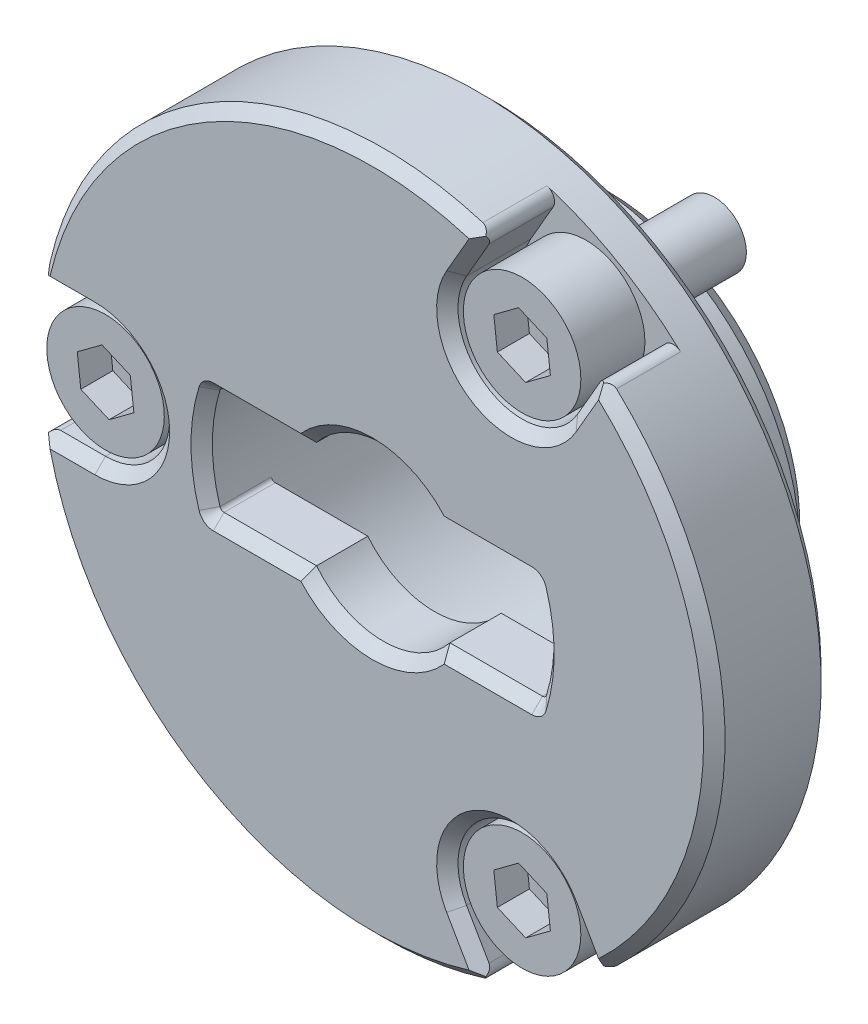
ISO-10303-21;
HEADER;
FILE_DESCRIPTION(('STEP AP214'),'2;1');
FILE_NAME('part.step','',(''),(''),'','','');
FILE_SCHEMA(('AUTOMOTIVE_DESIGN { 1 0 10303 214 1 1 1 1 }'));
ENDSEC;
DATA;
#1=APPLICATION_CONTEXT('core data for automotive mechanical design processes');
#2=APPLICATION_PROTOCOL_DEFINITION('international standard','automotive_design',2000,#1);
#3=PRODUCT_CONTEXT('',#1,'mechanical');
#4=PRODUCT('Part','Part','',(#3));
#5=PRODUCT_RELATED_PRODUCT_CATEGORY('part','',(#4));
#6=PRODUCT_DEFINITION_FORMATION('','',#4);
#7=PRODUCT_DEFINITION_CONTEXT('part definition',#1,'design');
#8=PRODUCT_DEFINITION('design','',#6,#7);
#9=PRODUCT_DEFINITION_SHAPE('','',#8);
#10=(LENGTH_UNIT() NAMED_UNIT(*) SI_UNIT(.MILLI.,.METRE.));
#11=(NAMED_UNIT(*) PLANE_ANGLE_UNIT() SI_UNIT($,.RADIAN.));
#12=(NAMED_UNIT(*) SI_UNIT($,.STERADIAN.) SOLID_ANGLE_UNIT());
#13=UNCERTAINTY_MEASURE_WITH_UNIT(LENGTH_MEASURE(1.E-05),#10,'distance_accuracy_value','');
#14=(GEOMETRIC_REPRESENTATION_CONTEXT(3) GLOBAL_UNCERTAINTY_ASSIGNED_CONTEXT((#13)) GLOBAL_UNIT_ASSIGNED_CONTEXT((#10,
#11,#12)) REPRESENTATION_CONTEXT('',''));
#15=CARTESIAN_POINT('',(0.,0.,0.));
#16=DIRECTION('',(0.,0.,1.));
#17=DIRECTION('',(1.,0.,0.));
#18=AXIS2_PLACEMENT_3D('',#15,#16,#17);
#19=CARTESIAN_POINT('',(5.90464939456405,9.88153772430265,-4.));
#20=DIRECTION('',(0.,0.,-1.));
#21=DIRECTION('',(0.396900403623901,0.917861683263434,0.));
#22=AXIS2_PLACEMENT_3D('',#19,#20,#21);
#23=PLANE('',#22);
#24=CARTESIAN_POINT('',(6.5,11.2583302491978,-4.));
#25=DIRECTION('',(0.,0.,1.));
#26=DIRECTION('',(-0.396900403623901,-0.917861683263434,0.));
#27=AXIS2_PLACEMENT_3D('',#24,#25,#26);
#28=CIRCLE('',#27,1.5);
#29=CARTESIAN_POINT('',(5.90464939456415,9.88153772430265,-4.));
#30=VERTEX_POINT('',#29);
#31=EDGE_CURVE('E1908',#30,#30,#28,.T.);
#32=ORIENTED_EDGE('',*,*,#31,.F.);
#33=EDGE_LOOP('',(#32));
#34=FACE_BOUND('',#33,.T.);
#35=ADVANCED_FACE('F14',(#34),#23,.T.);
#36=CARTESIAN_POINT('',(6.5,11.2583302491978,16.));
#37=DIRECTION('',(0.,0.,1.));
#38=DIRECTION('',(-0.396900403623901,-0.917861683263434,0.));
#39=AXIS2_PLACEMENT_3D('',#36,#37,#38);
#40=CYLINDRICAL_SURFACE('',#39,1.5);
#41=ORIENTED_EDGE('',*,*,#31,.T.);
#42=EDGE_LOOP('',(#41));
#43=FACE_BOUND('',#42,.T.);
#44=CARTESIAN_POINT('',(6.5,11.2583302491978,2.));
#45=DIRECTION('',(0.,0.,1.));
#46=DIRECTION('',(-0.396900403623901,-0.917861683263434,0.));
#47=AXIS2_PLACEMENT_3D('',#44,#45,#46);
#48=CIRCLE('',#47,1.5);
#49=CARTESIAN_POINT('',(5.90464939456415,9.88153772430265,2.));
#50=VERTEX_POINT('',#49);
#51=EDGE_CURVE('E1905',#50,#50,#48,.T.);
#52=ORIENTED_EDGE('',*,*,#51,.F.);
#53=EDGE_LOOP('',(#52));
#54=FACE_BOUND('',#53,.T.);
#55=ADVANCED_FACE('F2021',(#43,#54),#40,.T.);
#56=CARTESIAN_POINT('',(5.40852389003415,8.73421062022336,2.));
#57=DIRECTION('',(0.,0.,-1.));
#58=DIRECTION('',(0.396900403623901,0.917861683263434,0.));
#59=AXIS2_PLACEMENT_3D('',#56,#57,#58);
#60=PLANE('',#59);
#61=CARTESIAN_POINT('',(6.5,11.2583302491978,2.));
#62=DIRECTION('',(0.,0.,1.));
#63=DIRECTION('',(-0.866025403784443,0.499999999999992,0.));
#64=AXIS2_PLACEMENT_3D('',#61,#62,#63);
#65=CIRCLE('',#64,1.7);
#66=CARTESIAN_POINT('',(5.02775681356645,12.1083302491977,2.));
#67=VERTEX_POINT('',#66);
#68=EDGE_CURVE('E9',#67,#67,#65,.T.);
#69=ORIENTED_EDGE('',*,*,#68,.F.);
#70=EDGE_LOOP('',(#69));
#71=FACE_BOUND('',#70,.T.);
#72=ORIENTED_EDGE('',*,*,#51,.T.);
#73=EDGE_LOOP('',(#72));
#74=FACE_BOUND('',#73,.T.);
#75=ADVANCED_FACE('F2015',(#71,#74),#60,.T.);
#76=CARTESIAN_POINT('',(7.82481922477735,10.6854538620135,3.5));
#77=DIRECTION('',(-0.596441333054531,0.802656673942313,0.));
#78=DIRECTION('',(-0.802656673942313,-0.596441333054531,0.));
#79=AXIS2_PLACEMENT_3D('',#76,#77,#78);
#80=PLANE('',#79);
#81=DIRECTION('',(0.,0.,1.));
#82=VECTOR('',#81,1.);
#83=CARTESIAN_POINT('',(6.66628410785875,9.82456495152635,3.5));
#84=LINE('',#83,#82);
#85=CARTESIAN_POINT('',(6.66628410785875,9.82456495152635,3.5));
#86=VERTEX_POINT('',#85);
#87=CARTESIAN_POINT('',(6.66628410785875,9.82456495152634,5.));
#88=VERTEX_POINT('',#87);
#89=EDGE_CURVE('E1911',#86,#88,#84,.T.);
#90=ORIENTED_EDGE('',*,*,#89,.T.);
#91=DIRECTION('',(-0.802656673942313,-0.59644133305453,0.));
#92=VECTOR('',#91,1.);
#93=CARTESIAN_POINT('',(7.82481922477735,10.6854538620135,5.));
#94=LINE('',#93,#92);
#95=CARTESIAN_POINT('',(7.82481922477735,10.6854538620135,5.));
#96=VERTEX_POINT('',#95);
#97=EDGE_CURVE('E34',#96,#88,#94,.T.);
#98=ORIENTED_EDGE('',*,*,#97,.F.);
#99=DIRECTION('',(0.,0.,1.));
#100=VECTOR('',#99,1.);
#101=CARTESIAN_POINT('',(7.82481922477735,10.6854538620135,3.5));
#102=LINE('',#101,#100);
#103=CARTESIAN_POINT('',(7.82481922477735,10.6854538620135,3.5));
#104=VERTEX_POINT('',#103);
#105=EDGE_CURVE('E1925',#104,#96,#102,.T.);
#106=ORIENTED_EDGE('',*,*,#105,.F.);
#107=DIRECTION('',(-0.802656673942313,-0.59644133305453,0.));
#108=VECTOR('',#107,1.);
#109=CARTESIAN_POINT('',(7.82481922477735,10.6854538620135,3.5));
#110=LINE('',#109,#108);
#111=EDGE_CURVE('E1928',#104,#86,#110,.T.);
#112=ORIENTED_EDGE('',*,*,#111,.T.);
#113=EDGE_LOOP('',(#90,#98,#106,#112));
#114=FACE_BOUND('',#113,.T.);
#115=ADVANCED_FACE('F2003',(#114),#80,.T.);
#116=CARTESIAN_POINT('',(5.3414648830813,10.3974413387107,3.49999999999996));
#117=DIRECTION('',(-0.396900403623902,-0.917861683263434,0.));
#118=DIRECTION('',(0.917861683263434,-0.396900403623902,0.));
#119=AXIS2_PLACEMENT_3D('',#116,#117,#118);
#120=PLANE('',#119);
#121=DIRECTION('',(0.,0.,1.));
#122=VECTOR('',#121,1.);
#123=CARTESIAN_POINT('',(5.3414648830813,10.3974413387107,3.49999999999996));
#124=LINE('',#123,#122);
#125=CARTESIAN_POINT('',(5.3414648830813,10.3974413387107,3.49999999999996));
#126=VERTEX_POINT('',#125);
#127=CARTESIAN_POINT('',(5.3414648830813,10.3974413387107,5.));
#128=VERTEX_POINT('',#127);
#129=EDGE_CURVE('E1913',#126,#128,#124,.T.);
#130=ORIENTED_EDGE('',*,*,#129,.T.);
#131=DIRECTION('',(0.917861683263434,-0.396900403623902,0.));
#132=VECTOR('',#131,1.);
#133=CARTESIAN_POINT('',(5.3414648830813,10.3974413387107,5.));
#134=LINE('',#133,#132);
#135=EDGE_CURVE('E1947',#128,#88,#134,.T.);
#136=ORIENTED_EDGE('',*,*,#135,.T.);
#137=ORIENTED_EDGE('',*,*,#89,.F.);
#138=DIRECTION('',(0.917861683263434,-0.396900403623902,0.));
#139=VECTOR('',#138,1.);
#140=CARTESIAN_POINT('',(5.3414648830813,10.3974413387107,3.49999999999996));
#141=LINE('',#140,#139);
#142=EDGE_CURVE('E1931',#126,#86,#141,.T.);
#143=ORIENTED_EDGE('',*,*,#142,.F.);
#144=EDGE_LOOP('',(#130,#136,#137,#143));
#145=FACE_BOUND('',#144,.T.);
#146=ADVANCED_FACE('F2007',(#145),#120,.F.);
#147=CARTESIAN_POINT('',(5.17518077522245,11.8312066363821,3.49999999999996));
#148=DIRECTION('',(-0.993341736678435,-0.11520500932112,0.));
#149=DIRECTION('',(0.11520500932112,-0.993341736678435,0.));
#150=AXIS2_PLACEMENT_3D('',#147,#148,#149);
#151=PLANE('',#150);
#152=DIRECTION('',(0.,0.,1.));
#153=VECTOR('',#152,1.);
#154=CARTESIAN_POINT('',(5.17518077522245,11.8312066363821,3.49999999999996));
#155=LINE('',#154,#153);
#156=CARTESIAN_POINT('',(5.17518077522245,11.8312066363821,3.49999999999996));
#157=VERTEX_POINT('',#156);
#158=CARTESIAN_POINT('',(5.17518077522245,11.8312066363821,5.));
#159=VERTEX_POINT('',#158);
#160=EDGE_CURVE('E1916',#157,#159,#155,.T.);
#161=ORIENTED_EDGE('',*,*,#160,.T.);
#162=DIRECTION('',(0.11520500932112,-0.993341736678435,0.));
#163=VECTOR('',#162,1.);
#164=CARTESIAN_POINT('',(5.17518077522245,11.8312066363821,5.));
#165=LINE('',#164,#163);
#166=EDGE_CURVE('E1950',#159,#128,#165,.T.);
#167=ORIENTED_EDGE('',*,*,#166,.T.);
#168=ORIENTED_EDGE('',*,*,#129,.F.);
#169=DIRECTION('',(0.11520500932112,-0.993341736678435,0.));
#170=VECTOR('',#169,1.);
#171=CARTESIAN_POINT('',(5.17518077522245,11.8312066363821,3.49999999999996));
#172=LINE('',#171,#170);
#173=EDGE_CURVE('E1935',#157,#126,#172,.T.);
#174=ORIENTED_EDGE('',*,*,#173,.F.);
#175=EDGE_LOOP('',(#161,#167,#168,#174));
#176=FACE_BOUND('',#175,.T.);
#177=ADVANCED_FACE('F1998',(#176),#151,.F.);
#178=CARTESIAN_POINT('',(5.17518077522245,11.8312066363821,3.49999999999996));
#179=DIRECTION('',(0.596441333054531,-0.802656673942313,0.));
#180=DIRECTION('',(0.802656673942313,0.596441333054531,0.));
#181=AXIS2_PLACEMENT_3D('',#178,#179,#180);
#182=PLANE('',#181);
#183=DIRECTION('',(0.,0.,1.));
#184=VECTOR('',#183,1.);
#185=CARTESIAN_POINT('',(6.33371589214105,12.6920955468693,3.49999999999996));
#186=LINE('',#185,#184);
#187=CARTESIAN_POINT('',(6.33371589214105,12.6920955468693,3.49999999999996));
#188=VERTEX_POINT('',#187);
#189=CARTESIAN_POINT('',(6.33371589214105,12.6920955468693,5.));
#190=VERTEX_POINT('',#189);
#191=EDGE_CURVE('E1919',#188,#190,#186,.T.);
#192=ORIENTED_EDGE('',*,*,#191,.T.);
#193=DIRECTION('',(0.802656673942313,0.596441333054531,0.));
#194=VECTOR('',#193,1.);
#195=CARTESIAN_POINT('',(5.17518077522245,11.8312066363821,5.));
#196=LINE('',#195,#194);
#197=EDGE_CURVE('E1953',#159,#190,#196,.T.);
#198=ORIENTED_EDGE('',*,*,#197,.F.);
#199=ORIENTED_EDGE('',*,*,#160,.F.);
#200=DIRECTION('',(0.802656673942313,0.596441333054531,0.));
#201=VECTOR('',#200,1.);
#202=CARTESIAN_POINT('',(5.17518077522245,11.8312066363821,3.49999999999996));
#203=LINE('',#202,#201);
#204=EDGE_CURVE('E1938',#157,#188,#203,.T.);
#205=ORIENTED_EDGE('',*,*,#204,.T.);
#206=EDGE_LOOP('',(#192,#198,#199,#205));
#207=FACE_BOUND('',#206,.T.);
#208=ADVANCED_FACE('F1995',(#207),#182,.T.);
#209=CARTESIAN_POINT('',(7.6585351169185,12.119219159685,3.5));
#210=DIRECTION('',(0.396900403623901,0.917861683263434,0.));
#211=DIRECTION('',(-0.917861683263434,0.396900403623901,0.));
#212=AXIS2_PLACEMENT_3D('',#209,#210,#211);
#213=PLANE('',#212);
#214=DIRECTION('',(0.,0.,1.));
#215=VECTOR('',#214,1.);
#216=CARTESIAN_POINT('',(7.6585351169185,12.119219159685,3.5));
#217=LINE('',#216,#215);
#218=CARTESIAN_POINT('',(7.6585351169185,12.119219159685,3.5));
#219=VERTEX_POINT('',#218);
#220=CARTESIAN_POINT('',(7.6585351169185,12.1192191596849,5.));
#221=VERTEX_POINT('',#220);
#222=EDGE_CURVE('E1922',#219,#221,#217,.T.);
#223=ORIENTED_EDGE('',*,*,#222,.T.);
#224=DIRECTION('',(-0.917861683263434,0.396900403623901,0.));
#225=VECTOR('',#224,1.);
#226=CARTESIAN_POINT('',(7.6585351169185,12.1192191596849,5.));
#227=LINE('',#226,#225);
#228=EDGE_CURVE('E1956',#221,#190,#227,.T.);
#229=ORIENTED_EDGE('',*,*,#228,.T.);
#230=ORIENTED_EDGE('',*,*,#191,.F.);
#231=DIRECTION('',(-0.917861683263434,0.396900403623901,0.));
#232=VECTOR('',#231,1.);
#233=CARTESIAN_POINT('',(7.6585351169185,12.119219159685,3.5));
#234=LINE('',#233,#232);
#235=EDGE_CURVE('E1941',#219,#188,#234,.T.);
#236=ORIENTED_EDGE('',*,*,#235,.F.);
#237=EDGE_LOOP('',(#223,#229,#230,#236));
#238=FACE_BOUND('',#237,.T.);
#239=ADVANCED_FACE('F1977',(#238),#213,.F.);
#240=CARTESIAN_POINT('',(7.82481922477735,10.6854538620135,3.5));
#241=DIRECTION('',(0.993341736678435,0.11520500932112,0.));
#242=DIRECTION('',(-0.11520500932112,0.993341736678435,0.));
#243=AXIS2_PLACEMENT_3D('',#240,#241,#242);
#244=PLANE('',#243);
#245=DIRECTION('',(-0.11520500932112,0.993341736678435,0.));
#246=VECTOR('',#245,1.);
#247=CARTESIAN_POINT('',(7.82481922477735,10.6854538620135,3.5));
#248=LINE('',#247,#246);
#249=EDGE_CURVE('E1927',#104,#219,#248,.T.);
#250=ORIENTED_EDGE('',*,*,#249,.F.);
#251=ORIENTED_EDGE('',*,*,#105,.T.);
#252=DIRECTION('',(-0.11520500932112,0.993341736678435,0.));
#253=VECTOR('',#252,1.);
#254=CARTESIAN_POINT('',(7.82481922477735,10.6854538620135,5.));
#255=LINE('',#254,#253);
#256=EDGE_CURVE('E1932',#96,#221,#255,.T.);
#257=ORIENTED_EDGE('',*,*,#256,.T.);
#258=ORIENTED_EDGE('',*,*,#222,.F.);
#259=EDGE_LOOP('',(#250,#251,#257,#258));
#260=FACE_BOUND('',#259,.T.);
#261=ADVANCED_FACE('F1966',(#260),#244,.F.);
#262=CARTESIAN_POINT('',(6.66628410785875,9.82456495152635,3.5));
#263=DIRECTION('',(0.,0.,1.));
#264=DIRECTION('',(-0.396900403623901,-0.917861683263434,0.));
#265=AXIS2_PLACEMENT_3D('',#262,#263,#264);
#266=PLANE('',#265);
#267=ORIENTED_EDGE('',*,*,#111,.F.);
#268=ORIENTED_EDGE('',*,*,#249,.T.);
#269=ORIENTED_EDGE('',*,*,#235,.T.);
#270=ORIENTED_EDGE('',*,*,#204,.F.);
#271=ORIENTED_EDGE('',*,*,#173,.T.);
#272=ORIENTED_EDGE('',*,*,#142,.T.);
#273=EDGE_LOOP('',(#267,#268,#269,#270,#271,#272));
#274=FACE_BOUND('',#273,.T.);
#275=ADVANCED_FACE('F2002',(#274),#266,.T.);
#276=CARTESIAN_POINT('',(6.5,11.2583302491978,5.));
#277=DIRECTION('',(0.,0.,1.));
#278=DIRECTION('',(-0.396900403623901,-0.917861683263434,0.));
#279=AXIS2_PLACEMENT_3D('',#276,#277,#278);
#280=PLANE('',#279);
#281=CARTESIAN_POINT('',(6.5,11.2583302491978,5.));
#282=DIRECTION('',(0.,0.,1.));
#283=DIRECTION('',(-0.396900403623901,-0.917861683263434,0.));
#284=AXIS2_PLACEMENT_3D('',#281,#282,#283);
#285=CIRCLE('',#284,2.75);
#286=CARTESIAN_POINT('',(5.40852389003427,8.73421062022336,5.));
#287=VERTEX_POINT('',#286);
#288=EDGE_CURVE('E25',#287,#287,#285,.T.);
#289=ORIENTED_EDGE('',*,*,#288,.T.);
#290=EDGE_LOOP('',(#289));
#291=FACE_BOUND('',#290,.T.);
#292=ORIENTED_EDGE('',*,*,#256,.F.);
#293=ORIENTED_EDGE('',*,*,#97,.T.);
#294=ORIENTED_EDGE('',*,*,#135,.F.);
#295=ORIENTED_EDGE('',*,*,#166,.F.);
#296=ORIENTED_EDGE('',*,*,#197,.T.);
#297=ORIENTED_EDGE('',*,*,#228,.F.);
#298=EDGE_LOOP('',(#292,#293,#294,#295,#296,#297));
#299=FACE_BOUND('',#298,.T.);
#300=ADVANCED_FACE('F1972',(#291,#299),#280,.T.);
#301=CARTESIAN_POINT('',(6.5,11.2583302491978,16.));
#302=DIRECTION('',(0.,0.,1.));
#303=DIRECTION('',(-0.396900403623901,-0.917861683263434,0.));
#304=AXIS2_PLACEMENT_3D('',#301,#302,#303);
#305=CYLINDRICAL_SURFACE('',#304,2.75);
#306=CARTESIAN_POINT('',(6.5,11.2583302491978,2.));
#307=DIRECTION('',(0.,0.,1.));
#308=DIRECTION('',(-0.396900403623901,-0.917861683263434,0.));
#309=AXIS2_PLACEMENT_3D('',#306,#307,#308);
#310=CIRCLE('',#309,2.75);
#311=CARTESIAN_POINT('',(5.40852389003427,8.73421062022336,2.));
#312=VERTEX_POINT('',#311);
#313=EDGE_CURVE('E1902',#312,#312,#310,.T.);
#314=ORIENTED_EDGE('',*,*,#313,.T.);
#315=EDGE_LOOP('',(#314));
#316=FACE_BOUND('',#315,.T.);
#317=ORIENTED_EDGE('',*,*,#288,.F.);
#318=EDGE_LOOP('',(#317));
#319=FACE_BOUND('',#318,.T.);
#320=ADVANCED_FACE('F600',(#316,#319),#305,.T.);
#321=CARTESIAN_POINT('',(-13.5953506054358,-1.37679252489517,-4.));
#322=DIRECTION('',(0.,0.,-1.));
#323=DIRECTION('',(0.396900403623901,0.917861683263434,0.));
#324=AXIS2_PLACEMENT_3D('',#321,#322,#323);
#325=PLANE('',#324);
#326=CARTESIAN_POINT('',(-13.,0.,-4.));
#327=DIRECTION('',(0.,0.,1.));
#328=DIRECTION('',(-0.396900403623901,-0.917861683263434,0.));
#329=AXIS2_PLACEMENT_3D('',#326,#327,#328);
#330=CIRCLE('',#329,1.5);
#331=CARTESIAN_POINT('',(-13.5953506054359,-1.37679252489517,-4.));
#332=VERTEX_POINT('',#331);
#333=EDGE_CURVE('E1849',#332,#332,#330,.T.);
#334=ORIENTED_EDGE('',*,*,#333,.F.);
#335=EDGE_LOOP('',(#334));
#336=FACE_BOUND('',#335,.T.);
#337=ADVANCED_FACE('F587',(#336),#325,.T.);
#338=CARTESIAN_POINT('',(5.90464939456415,-12.6351227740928,-4.));
#339=DIRECTION('',(0.,0.,-1.));
#340=DIRECTION('',(0.396900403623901,0.917861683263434,0.));
#341=AXIS2_PLACEMENT_3D('',#338,#339,#340);
#342=PLANE('',#341);
#343=CARTESIAN_POINT('',(6.5,-11.2583302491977,-4.));
#344=DIRECTION('',(0.,0.,1.));
#345=DIRECTION('',(-0.396900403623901,-0.917861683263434,0.));
#346=AXIS2_PLACEMENT_3D('',#343,#344,#345);
#347=CIRCLE('',#346,1.5);
#348=CARTESIAN_POINT('',(5.90464939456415,-12.6351227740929,-4.));
#349=VERTEX_POINT('',#348);
#350=EDGE_CURVE('E1791',#349,#349,#347,.T.);
#351=ORIENTED_EDGE('',*,*,#350,.F.);
#352=EDGE_LOOP('',(#351));
#353=FACE_BOUND('',#352,.T.);
#354=ADVANCED_FACE('F566',(#353),#342,.T.);
#355=CARTESIAN_POINT('',(6.66628410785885,-12.6920955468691,3.5));
#356=DIRECTION('',(0.,0.,1.));
#357=DIRECTION('',(-0.396900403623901,-0.917861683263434,0.));
#358=AXIS2_PLACEMENT_3D('',#355,#356,#357);
#359=PLANE('',#358);
#360=DIRECTION('',(-0.802656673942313,-0.59644133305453,0.));
#361=VECTOR('',#360,1.);
#362=CARTESIAN_POINT('',(7.82481922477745,-11.831206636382,3.5));
#363=LINE('',#362,#361);
#364=CARTESIAN_POINT('',(7.82481922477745,-11.831206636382,3.5));
#365=VERTEX_POINT('',#364);
#366=CARTESIAN_POINT('',(6.66628410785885,-12.6920955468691,3.5));
#367=VERTEX_POINT('',#366);
#368=EDGE_CURVE('E1807',#365,#367,#363,.T.);
#369=ORIENTED_EDGE('',*,*,#368,.F.);
#370=DIRECTION('',(-0.11520500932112,0.993341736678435,0.));
#371=VECTOR('',#370,1.);
#372=CARTESIAN_POINT('',(7.82481922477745,-11.831206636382,3.5));
#373=LINE('',#372,#371);
#374=CARTESIAN_POINT('',(7.6585351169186,-10.3974413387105,3.5));
#375=VERTEX_POINT('',#374);
#376=EDGE_CURVE('E1806',#365,#375,#373,.T.);
#377=ORIENTED_EDGE('',*,*,#376,.T.);
#378=DIRECTION('',(-0.917861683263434,0.396900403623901,0.));
#379=VECTOR('',#378,1.);
#380=CARTESIAN_POINT('',(7.6585351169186,-10.3974413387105,3.5));
#381=LINE('',#380,#379);
#382=CARTESIAN_POINT('',(6.33371589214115,-9.82456495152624,3.49999999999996));
#383=VERTEX_POINT('',#382);
#384=EDGE_CURVE('E1820',#375,#383,#381,.T.);
#385=ORIENTED_EDGE('',*,*,#384,.T.);
#386=DIRECTION('',(0.802656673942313,0.596441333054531,0.));
#387=VECTOR('',#386,1.);
#388=CARTESIAN_POINT('',(5.17518077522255,-10.6854538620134,3.49999999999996));
#389=LINE('',#388,#387);
#390=CARTESIAN_POINT('',(5.17518077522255,-10.6854538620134,3.49999999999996));
#391=VERTEX_POINT('',#390);
#392=EDGE_CURVE('E1817',#391,#383,#389,.T.);
#393=ORIENTED_EDGE('',*,*,#392,.F.);
#394=DIRECTION('',(0.11520500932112,-0.993341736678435,0.));
#395=VECTOR('',#394,1.);
#396=CARTESIAN_POINT('',(5.17518077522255,-10.6854538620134,3.49999999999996));
#397=LINE('',#396,#395);
#398=CARTESIAN_POINT('',(5.3414648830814,-12.1192191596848,3.49999999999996));
#399=VERTEX_POINT('',#398);
#400=EDGE_CURVE('E1814',#391,#399,#397,.T.);
#401=ORIENTED_EDGE('',*,*,#400,.T.);
#402=DIRECTION('',(0.917861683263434,-0.396900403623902,0.));
#403=VECTOR('',#402,1.);
#404=CARTESIAN_POINT('',(5.3414648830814,-12.1192191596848,3.49999999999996));
#405=LINE('',#404,#403);
#406=EDGE_CURVE('E1810',#399,#367,#405,.T.);
#407=ORIENTED_EDGE('',*,*,#406,.T.);
#408=EDGE_LOOP('',(#369,#377,#385,#393,#401,#407));
#409=FACE_BOUND('',#408,.T.);
#410=ADVANCED_FACE('F586',(#409),#359,.T.);
#411=CARTESIAN_POINT('',(-12.8337158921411,-1.43376529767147,3.5));
#412=DIRECTION('',(0.,0.,1.));
#413=DIRECTION('',(-0.396900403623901,-0.917861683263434,0.));
#414=AXIS2_PLACEMENT_3D('',#411,#412,#413);
#415=PLANE('',#414);
#416=DIRECTION('',(-0.802656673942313,-0.59644133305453,0.));
#417=VECTOR('',#416,1.);
#418=CARTESIAN_POINT('',(-11.6751807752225,-0.572876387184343,3.5));
#419=LINE('',#418,#417);
#420=CARTESIAN_POINT('',(-11.6751807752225,-0.572876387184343,3.5));
#421=VERTEX_POINT('',#420);
#422=CARTESIAN_POINT('',(-12.8337158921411,-1.43376529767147,3.5));
#423=VERTEX_POINT('',#422);
#424=EDGE_CURVE('E1866',#421,#423,#419,.T.);
#425=ORIENTED_EDGE('',*,*,#424,.F.);
#426=DIRECTION('',(-0.11520500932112,0.993341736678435,0.));
#427=VECTOR('',#426,1.);
#428=CARTESIAN_POINT('',(-11.6751807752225,-0.572876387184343,3.5));
#429=LINE('',#428,#427);
#430=CARTESIAN_POINT('',(-11.8414648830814,0.860888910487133,3.5));
#431=VERTEX_POINT('',#430);
#432=EDGE_CURVE('E1865',#421,#431,#429,.T.);
#433=ORIENTED_EDGE('',*,*,#432,.T.);
#434=DIRECTION('',(-0.917861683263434,0.396900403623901,0.));
#435=VECTOR('',#434,1.);
#436=CARTESIAN_POINT('',(-11.8414648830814,0.860888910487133,3.5));
#437=LINE('',#436,#435);
#438=CARTESIAN_POINT('',(-13.1662841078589,1.43376529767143,3.49999999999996));
#439=VERTEX_POINT('',#438);
#440=EDGE_CURVE('E1879',#431,#439,#437,.T.);
#441=ORIENTED_EDGE('',*,*,#440,.T.);
#442=DIRECTION('',(0.802656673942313,0.596441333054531,0.));
#443=VECTOR('',#442,1.);
#444=CARTESIAN_POINT('',(-14.3248192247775,0.572876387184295,3.49999999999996));
#445=LINE('',#444,#443);
#446=CARTESIAN_POINT('',(-14.3248192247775,0.572876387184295,3.49999999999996));
#447=VERTEX_POINT('',#446);
#448=EDGE_CURVE('E1876',#447,#439,#445,.T.);
#449=ORIENTED_EDGE('',*,*,#448,.F.);
#450=DIRECTION('',(0.11520500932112,-0.993341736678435,0.));
#451=VECTOR('',#450,1.);
#452=CARTESIAN_POINT('',(-14.3248192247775,0.572876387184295,3.49999999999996));
#453=LINE('',#452,#451);
#454=CARTESIAN_POINT('',(-14.1585351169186,-0.860888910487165,3.49999999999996));
#455=VERTEX_POINT('',#454);
#456=EDGE_CURVE('E1873',#447,#455,#453,.T.);
#457=ORIENTED_EDGE('',*,*,#456,.T.);
#458=DIRECTION('',(0.917861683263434,-0.396900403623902,0.));
#459=VECTOR('',#458,1.);
#460=CARTESIAN_POINT('',(-14.1585351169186,-0.860888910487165,3.49999999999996));
#461=LINE('',#460,#459);
#462=EDGE_CURVE('E1869',#455,#423,#461,.T.);
#463=ORIENTED_EDGE('',*,*,#462,.T.);
#464=EDGE_LOOP('',(#425,#433,#441,#449,#457,#463));
#465=FACE_BOUND('',#464,.T.);
#466=ADVANCED_FACE('F595',(#465),#415,.T.);
#467=CARTESIAN_POINT('',(8.,0.,2.9));
#468=CARTESIAN_POINT('',(8.,-1.8259477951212,2.69546428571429));
#469=CARTESIAN_POINT('',(7.20775094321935,-3.47106991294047,2.49092857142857));
#470=CARTESIAN_POINT('',(6.41550188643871,-5.11619203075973,2.28639285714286));
#471=CARTESIAN_POINT('',(4.98791841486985,-6.25465185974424,2.08185714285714));
#472=CARTESIAN_POINT('',(3.56033494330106,-7.39311168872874,1.87732142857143));
#473=CARTESIAN_POINT('',(1.78016747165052,-7.79942329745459,1.67278571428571));
#474=CARTESIAN_POINT('',(0.,-8.20573490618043,1.46825));
#475=CARTESIAN_POINT('',(-1.7801674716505,-7.79942329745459,1.26371428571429));
#476=CARTESIAN_POINT('',(-3.56033494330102,-7.39311168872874,1.05917857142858));
#477=CARTESIAN_POINT('',(-4.98791841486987,-6.25465185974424,0.85464285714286));
#478=CARTESIAN_POINT('',(-6.41550188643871,-5.11619203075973,0.650107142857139));
#479=CARTESIAN_POINT('',(-7.20775094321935,-3.47106991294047,0.44557142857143));
#480=CARTESIAN_POINT('',(-8.,-1.8259477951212,0.24103571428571));
#481=CARTESIAN_POINT('',(-8.,0.,0.0365));
#482=CARTESIAN_POINT('',(0.,0.,2.9));
#483=CARTESIAN_POINT('',(0.,0.,2.69546428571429));
#484=CARTESIAN_POINT('',(0.,0.,2.49092857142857));
#485=CARTESIAN_POINT('',(0.,0.,2.28639285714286));
#486=CARTESIAN_POINT('',(0.,0.,2.08185714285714));
#487=CARTESIAN_POINT('',(0.,0.,1.87732142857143));
#488=CARTESIAN_POINT('',(0.,0.,1.67278571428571));
#489=CARTESIAN_POINT('',(0.,0.,1.46825));
#490=CARTESIAN_POINT('',(0.,0.,1.26371428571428));
#491=CARTESIAN_POINT('',(0.,0.,1.05917857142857));
#492=CARTESIAN_POINT('',(0.,0.,0.85464285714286));
#493=CARTESIAN_POINT('',(0.,0.,0.650107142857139));
#494=CARTESIAN_POINT('',(0.,0.,0.44557142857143));
#495=CARTESIAN_POINT('',(0.,0.,0.24103571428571));
#496=CARTESIAN_POINT('',(0.,0.,0.0365));
#497=(BOUNDED_SURFACE() B_SPLINE_SURFACE(1,2,((#467,#468,#469,#470,#471,#472,#473,#474,#475,
#476,#477,#478,#479,#480,#481),(#482,#483,#484,#485,#486,#487,#488,#489,#490,#491,#492,#493,
#494,#495,#496)),.UNSPECIFIED.,.F.,.F.,.F.) B_SPLINE_SURFACE_WITH_KNOTS((2,2),(3,2,2,2,2,2,2,3),
(0.,1.),(0.0625,0.125,0.1875,0.25,0.3125,0.375,0.4375,0.5),
.UNSPECIFIED.) GEOMETRIC_REPRESENTATION_ITEM() RATIONAL_B_SPLINE_SURFACE(((1.,0.974927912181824,
1.,0.974927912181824,1.,0.974927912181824,1.,0.974927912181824,1.,0.974927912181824,1.,
0.974927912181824,1.,0.974927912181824,1.),(1.,0.974927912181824,1.,0.974927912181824,1.,
0.974927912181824,1.,0.974927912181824,1.,0.974927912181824,1.,0.974927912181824,1.,
0.974927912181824,1.))) REPRESENTATION_ITEM('') SURFACE());
#498=CARTESIAN_POINT('',(3.7861793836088,-1.29028898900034,2.6));
#499=CARTESIAN_POINT('',(5.04823917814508,-1.72038531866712,2.6));
#500=CARTESIAN_POINT('',(6.31029897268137,-2.1504816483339,2.6));
#501=CARTESIAN_POINT('',(7.57235876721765,-2.58057797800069,2.6));
#502=B_SPLINE_CURVE_WITH_KNOTS('',3,(#498,#499,#500,#501),.UNSPECIFIED.,.F.,.F.,(4,4),(0.,
4.00000000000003),.UNSPECIFIED.);
#503=CARTESIAN_POINT('',(7.33591353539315,-2.5,2.6));
#504=VERTEX_POINT('',#503);
#505=CARTESIAN_POINT('',(7.57235876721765,-2.58057797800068,2.6));
#506=VERTEX_POINT('',#505);
#507=EDGE_CURVE('E417',#504,#506,#502,.T.);
#508=CARTESIAN_POINT('',(3.12249899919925,-2.5,2.28461599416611));
#509=CARTESIAN_POINT('',(3.3078806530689,-2.5,2.31121365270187));
#510=CARTESIAN_POINT('',(3.49363193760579,-2.5,2.33502697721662));
#511=CARTESIAN_POINT('',(3.86552133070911,-2.5,2.37809846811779));
#512=CARTESIAN_POINT('',(4.05165903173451,-2.5,2.39736012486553));
#513=CARTESIAN_POINT('',(4.42420773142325,-2.5,2.43237512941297));
#514=CARTESIAN_POINT('',(4.61061864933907,-2.5,2.44812936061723));
#515=CARTESIAN_POINT('',(4.98364937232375,-2.5,2.4768600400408));
#516=CARTESIAN_POINT('',(5.17026917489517,-2.5,2.48983652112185));
#517=CARTESIAN_POINT('',(5.54357650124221,-2.5,2.51383710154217));
#518=CARTESIAN_POINT('',(5.7302639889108,-2.5,2.52486177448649));
#519=CARTESIAN_POINT('',(6.10376909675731,-2.5,2.54534260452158));
#520=CARTESIAN_POINT('',(6.29058673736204,-2.5,2.55479838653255));
#521=CARTESIAN_POINT('',(6.66433826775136,-2.5,2.57243155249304));
#522=CARTESIAN_POINT('',(6.85127217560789,-2.5,2.58060854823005));
#523=CARTESIAN_POINT('',(7.22524679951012,-2.5,2.59590304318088));
#524=CARTESIAN_POINT('',(7.41228753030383,-2.5,2.6030201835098));
#525=CARTESIAN_POINT('',(7.59934207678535,-2.5,2.6097159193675));
#526=B_SPLINE_CURVE_WITH_KNOTS('',3,(#508,#509,#510,#511,#512,#513,#514,#515,#516,#517,#518,
#519,#520,#521,#522,#523,#524,#525),.UNSPECIFIED.,.F.,.F.,(4,2,2,2,2,2,2,2,4),(0.,
0.561776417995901,1.123120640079,1.68432331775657,2.2455193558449,2.80655019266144,
3.36771496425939,3.92904976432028,4.49057421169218),.UNSPECIFIED.);
#527=CARTESIAN_POINT('',(7.4531872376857,-2.5,2.60440033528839));
#528=VERTEX_POINT('',#527);
#529=EDGE_CURVE('E1020',#504,#528,#526,.T.);
#530=CARTESIAN_POINT('',(7.45318723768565,-2.5,2.60440033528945));
#531=CARTESIAN_POINT('',(7.46442948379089,-2.50000966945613,2.6048154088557));
#532=CARTESIAN_POINT('',(7.47566398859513,-2.49905271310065,2.60533482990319));
#533=CARTESIAN_POINT('',(7.49779714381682,-2.49528138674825,2.60656117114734));
#534=CARTESIAN_POINT('',(7.50869606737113,-2.49246857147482,2.60726793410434));
#535=CARTESIAN_POINT('',(7.52986041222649,-2.48506012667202,2.60884874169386));
#536=CARTESIAN_POINT('',(7.54012566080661,-2.48046401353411,2.60972283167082));
#537=CARTESIAN_POINT('',(7.55973156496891,-2.46962801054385,2.61161252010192));
#538=CARTESIAN_POINT('',(7.56907236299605,-2.4633883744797,2.61262809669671));
#539=CARTESIAN_POINT('',(7.58661305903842,-2.44941196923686,2.6147777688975));
#540=CARTESIAN_POINT('',(7.59480742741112,-2.44166834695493,2.61591239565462));
#541=CARTESIAN_POINT('',(7.60977612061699,-2.42492375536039,2.61826565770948));
#542=CARTESIAN_POINT('',(7.61655074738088,-2.4159230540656,2.61948427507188));
#543=CARTESIAN_POINT('',(7.62716888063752,-2.39902900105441,2.62169707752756));
#544=CARTESIAN_POINT('',(7.63132926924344,-2.39133123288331,2.62268126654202));
#545=CARTESIAN_POINT('',(7.63860678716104,-2.37547097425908,2.62466428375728));
#546=CARTESIAN_POINT('',(7.64172520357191,-2.3673090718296,2.62566309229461));
#547=CARTESIAN_POINT('',(7.6442946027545,-2.35897435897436,2.62666237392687));
#548=B_SPLINE_CURVE_WITH_KNOTS('',3,(#530,#531,#532,#533,#534,#535,#536,#537,#538,#539,#540,
#541,#542,#543,#544,#545,#546,#547),.UNSPECIFIED.,.F.,.F.,(4,2,2,2,2,2,2,2,4),(0.,
0.033702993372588,0.0673777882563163,0.101061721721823,0.134740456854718,0.168576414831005,
0.202405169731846,0.228749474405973,0.255061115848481),.UNSPECIFIED.);
#549=CARTESIAN_POINT('',(7.6442946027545,-2.35897435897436,2.62666237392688));
#550=VERTEX_POINT('',#549);
#551=EDGE_CURVE('E442',#528,#550,#548,.T.);
#552=CARTESIAN_POINT('',(8.,0.,2.9));
#553=CARTESIAN_POINT('',(8.,-1.8259477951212,2.69546428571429));
#554=CARTESIAN_POINT('',(7.20775094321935,-3.47106991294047,2.49092857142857));
#555=CARTESIAN_POINT('',(6.41550188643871,-5.11619203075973,2.28639285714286));
#556=CARTESIAN_POINT('',(4.98791841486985,-6.25465185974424,2.08185714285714));
#557=CARTESIAN_POINT('',(3.56033494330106,-7.39311168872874,1.87732142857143));
#558=CARTESIAN_POINT('',(1.78016747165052,-7.79942329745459,1.67278571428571));
#559=CARTESIAN_POINT('',(0.,-8.20573490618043,1.46825));
#560=CARTESIAN_POINT('',(-1.7801674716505,-7.79942329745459,1.26371428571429));
#561=CARTESIAN_POINT('',(-3.56033494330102,-7.39311168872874,1.05917857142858));
#562=CARTESIAN_POINT('',(-4.98791841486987,-6.25465185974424,0.85464285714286));
#563=CARTESIAN_POINT('',(-6.41550188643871,-5.11619203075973,0.650107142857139));
#564=CARTESIAN_POINT('',(-7.20775094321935,-3.47106991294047,0.44557142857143));
#565=CARTESIAN_POINT('',(-8.,-1.8259477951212,0.24103571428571));
#566=CARTESIAN_POINT('',(-8.,0.,0.0365));
#567=(BOUNDED_CURVE() B_SPLINE_CURVE(2,(#552,#553,#554,#555,#556,#557,#558,#559,#560,#561,#562,
#563,#564,#565,#566),.UNSPECIFIED.,.F.,.F.) B_SPLINE_CURVE_WITH_KNOTS((3,2,2,2,2,2,2,3),(0.0625,
0.125,0.1875,0.25,0.3125,0.375,0.4375,0.5),
.UNSPECIFIED.) CURVE() GEOMETRIC_REPRESENTATION_ITEM() RATIONAL_B_SPLINE_CURVE((1.,
0.974927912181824,1.,0.974927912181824,1.,0.974927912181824,1.,0.974927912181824,1.,
0.974927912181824,1.,0.974927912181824,1.,0.974927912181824,1.)) REPRESENTATION_ITEM(''));
#568=EDGE_CURVE('E1009',#506,#550,#567,.F.);
#569=ORIENTED_EDGE('',*,*,#507,.F.);
#570=ORIENTED_EDGE('',*,*,#529,.T.);
#571=ORIENTED_EDGE('',*,*,#551,.T.);
#572=ORIENTED_EDGE('',*,*,#568,.F.);
#573=EDGE_LOOP('',(#569,#570,#571,#572));
#574=FACE_BOUND('',#573,.T.);
#575=ADVANCED_FACE('F459',(#574),#497,.F.);
#576=CARTESIAN_POINT('',(0.,0.,2.6));
#577=DIRECTION('',(0.,0.,-1.));
#578=DIRECTION('',(0.,1.,0.));
#579=AXIS2_PLACEMENT_3D('',#576,#577,#578);
#580=PLANE('',#579);
#581=ORIENTED_EDGE('',*,*,#507,.T.);
#582=CARTESIAN_POINT('',(0.,0.,2.6));
#583=DIRECTION('',(0.,0.,-1.));
#584=DIRECTION('',(0.,1.,0.));
#585=AXIS2_PLACEMENT_3D('',#582,#583,#584);
#586=CIRCLE('',#585,8.);
#587=CARTESIAN_POINT('',(-7.6442946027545,-2.35897435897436,2.6));
#588=VERTEX_POINT('',#587);
#589=EDGE_CURVE('E392',#506,#588,#586,.T.);
#590=ORIENTED_EDGE('',*,*,#589,.T.);
#591=CARTESIAN_POINT('',(-7.45318723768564,-2.3,2.6));
#592=DIRECTION('',(0.,0.,-1.));
#593=DIRECTION('',(0.,1.,0.));
#594=AXIS2_PLACEMENT_3D('',#591,#592,#593);
#595=CIRCLE('',#594,0.2);
#596=CARTESIAN_POINT('',(-7.45318723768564,-2.5,2.6));
#597=VERTEX_POINT('',#596);
#598=EDGE_CURVE('E763',#588,#597,#595,.F.);
#599=ORIENTED_EDGE('',*,*,#598,.T.);
#600=DIRECTION('',(1.,0.,0.));
#601=VECTOR('',#600,1.);
#602=CARTESIAN_POINT('',(-7.59934207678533,-2.5,2.6));
#603=LINE('',#602,#601);
#604=CARTESIAN_POINT('',(-3.1224989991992,-2.5,2.6));
#605=VERTEX_POINT('',#604);
#606=EDGE_CURVE('E1775',#597,#605,#603,.T.);
#607=ORIENTED_EDGE('',*,*,#606,.T.);
#608=CARTESIAN_POINT('',(0.,0.,2.6));
#609=DIRECTION('',(0.,0.,-1.));
#610=DIRECTION('',(0.,1.,0.));
#611=AXIS2_PLACEMENT_3D('',#608,#609,#610);
#612=CIRCLE('',#611,4.);
#613=CARTESIAN_POINT('',(3.1224989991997,-2.4999999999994,2.6));
#614=VERTEX_POINT('',#613);
#615=EDGE_CURVE('E1774',#605,#614,#612,.F.);
#616=ORIENTED_EDGE('',*,*,#615,.T.);
#617=DIRECTION('',(1.,0.,0.));
#618=VECTOR('',#617,1.);
#619=CARTESIAN_POINT('',(-7.59934207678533,-2.5,2.6));
#620=LINE('',#619,#618);
#621=EDGE_CURVE('E1305',#614,#504,#620,.T.);
#622=ORIENTED_EDGE('',*,*,#621,.T.);
#623=EDGE_LOOP('',(#581,#590,#599,#607,#616,#622));
#624=FACE_BOUND('',#623,.T.);
#625=ADVANCED_FACE('F538',(#624),#580,.T.);
#626=CARTESIAN_POINT('',(-8.,0.,2.9));
#627=CARTESIAN_POINT('',(-8.,1.8259477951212,2.69546428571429));
#628=CARTESIAN_POINT('',(-7.20775094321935,3.47106991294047,2.49092857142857));
#629=CARTESIAN_POINT('',(-6.41550188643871,5.11619203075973,2.28639285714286));
#630=CARTESIAN_POINT('',(-4.98791841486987,6.25465185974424,2.08185714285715));
#631=CARTESIAN_POINT('',(-3.56033494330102,7.39311168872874,1.87732142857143));
#632=CARTESIAN_POINT('',(-1.7801674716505,7.79942329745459,1.67278571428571));
#633=CARTESIAN_POINT('',(0.,8.20573490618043,1.46825));
#634=CARTESIAN_POINT('',(1.78016747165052,7.79942329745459,1.26371428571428));
#635=CARTESIAN_POINT('',(3.56033494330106,7.39311168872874,1.05917857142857));
#636=CARTESIAN_POINT('',(4.98791841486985,6.25465185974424,0.85464285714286));
#637=CARTESIAN_POINT('',(6.41550188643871,5.11619203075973,0.650107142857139));
#638=CARTESIAN_POINT('',(7.20775094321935,3.47106991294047,0.44557142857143));
#639=CARTESIAN_POINT('',(8.,1.8259477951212,0.24103571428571));
#640=CARTESIAN_POINT('',(8.,0.,0.0365));
#641=CARTESIAN_POINT('',(0.,0.,2.9));
#642=CARTESIAN_POINT('',(0.,0.,2.69546428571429));
#643=CARTESIAN_POINT('',(0.,0.,2.49092857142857));
#644=CARTESIAN_POINT('',(0.,0.,2.28639285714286));
#645=CARTESIAN_POINT('',(0.,0.,2.08185714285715));
#646=CARTESIAN_POINT('',(0.,0.,1.87732142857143));
#647=CARTESIAN_POINT('',(0.,0.,1.67278571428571));
#648=CARTESIAN_POINT('',(0.,0.,1.46825));
#649=CARTESIAN_POINT('',(0.,0.,1.26371428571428));
#650=CARTESIAN_POINT('',(0.,0.,1.05917857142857));
#651=CARTESIAN_POINT('',(0.,0.,0.85464285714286));
#652=CARTESIAN_POINT('',(0.,0.,0.650107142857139));
#653=CARTESIAN_POINT('',(0.,0.,0.44557142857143));
#654=CARTESIAN_POINT('',(0.,0.,0.24103571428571));
#655=CARTESIAN_POINT('',(0.,0.,0.0365));
#656=(BOUNDED_SURFACE() B_SPLINE_SURFACE(1,2,((#626,#627,#628,#629,#630,#631,#632,#633,#634,
#635,#636,#637,#638,#639,#640),(#641,#642,#643,#644,#645,#646,#647,#648,#649,#650,#651,#652,
#653,#654,#655)),.UNSPECIFIED.,.F.,.F.,.F.) B_SPLINE_SURFACE_WITH_KNOTS((2,2),(3,2,2,2,2,2,2,3),
(0.,1.),(0.,0.0714285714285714,0.142857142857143,0.214285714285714,0.285714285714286,
0.357142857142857,0.428571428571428,0.5),
.UNSPECIFIED.) GEOMETRIC_REPRESENTATION_ITEM() RATIONAL_B_SPLINE_SURFACE(((1.,0.974927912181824,
1.,0.974927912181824,1.,0.974927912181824,1.,0.974927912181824,1.,0.974927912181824,1.,
0.974927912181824,1.,0.974927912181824,1.),(1.,0.974927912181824,1.,0.974927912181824,1.,
0.974927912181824,1.,0.974927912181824,1.,0.974927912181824,1.,0.974927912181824,1.,
0.974927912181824,1.))) REPRESENTATION_ITEM('') SURFACE());
#657=CARTESIAN_POINT('',(-3.78617938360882,1.29028898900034,2.6));
#658=CARTESIAN_POINT('',(-5.04823917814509,1.72038531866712,2.6));
#659=CARTESIAN_POINT('',(-6.31029897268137,2.1504816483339,2.6));
#660=CARTESIAN_POINT('',(-7.57235876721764,2.58057797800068,2.6));
#661=B_SPLINE_CURVE_WITH_KNOTS('',3,(#657,#658,#659,#660),.UNSPECIFIED.,.F.,.F.,(4,4),(0.,4.),.UNSPECIFIED.);
#662=CARTESIAN_POINT('',(-7.33591353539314,2.5,2.6));
#663=VERTEX_POINT('',#662);
#664=CARTESIAN_POINT('',(-7.57235876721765,2.58057797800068,2.6));
#665=VERTEX_POINT('',#664);
#666=EDGE_CURVE('E403',#663,#665,#661,.T.);
#667=CARTESIAN_POINT('',(-3.12249899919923,2.5,2.28461599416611));
#668=CARTESIAN_POINT('',(-3.30788065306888,2.5,2.31121365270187));
#669=CARTESIAN_POINT('',(-3.49363193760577,2.5,2.33502697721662));
#670=CARTESIAN_POINT('',(-3.86552133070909,2.5,2.37809846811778));
#671=CARTESIAN_POINT('',(-4.05165903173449,2.5,2.39736012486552));
#672=CARTESIAN_POINT('',(-4.42420773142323,2.5,2.43237512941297));
#673=CARTESIAN_POINT('',(-4.61061864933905,2.5,2.44812936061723));
#674=CARTESIAN_POINT('',(-4.98364937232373,2.5,2.47686004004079));
#675=CARTESIAN_POINT('',(-5.17026917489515,2.5,2.48983652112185));
#676=CARTESIAN_POINT('',(-5.54357650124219,2.5,2.51383710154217));
#677=CARTESIAN_POINT('',(-5.73026398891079,2.5,2.52486177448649));
#678=CARTESIAN_POINT('',(-6.10376909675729,2.5,2.54534260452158));
#679=CARTESIAN_POINT('',(-6.29058673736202,2.5,2.55479838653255));
#680=CARTESIAN_POINT('',(-6.66433826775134,2.5,2.57243155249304));
#681=CARTESIAN_POINT('',(-6.85127217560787,2.5,2.58060854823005));
#682=CARTESIAN_POINT('',(-7.2252467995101,2.5,2.59590304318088));
#683=CARTESIAN_POINT('',(-7.41228753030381,2.5,2.6030201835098));
#684=CARTESIAN_POINT('',(-7.59934207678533,2.5,2.6097159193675));
#685=B_SPLINE_CURVE_WITH_KNOTS('',3,(#667,#668,#669,#670,#671,#672,#673,#674,#675,#676,#677,
#678,#679,#680,#681,#682,#683,#684),.UNSPECIFIED.,.F.,.F.,(4,2,2,2,2,2,2,2,4),(0.,
0.5617764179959,1.123120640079,1.68432331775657,2.2455193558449,2.80655019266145,
3.36771496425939,3.92904976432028,4.49057421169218),.UNSPECIFIED.);
#686=CARTESIAN_POINT('',(-7.45318723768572,2.5,2.60440033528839));
#687=VERTEX_POINT('',#686);
#688=EDGE_CURVE('E679',#663,#687,#685,.T.);
#689=CARTESIAN_POINT('',(-7.45318723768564,2.5,2.60440033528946));
#690=CARTESIAN_POINT('',(-7.46442948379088,2.50000966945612,2.60481540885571));
#691=CARTESIAN_POINT('',(-7.47566398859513,2.49905271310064,2.60533482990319));
#692=CARTESIAN_POINT('',(-7.49779714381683,2.49528138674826,2.60656117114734));
#693=CARTESIAN_POINT('',(-7.50869606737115,2.49246857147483,2.60726793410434));
#694=CARTESIAN_POINT('',(-7.52986041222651,2.48506012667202,2.60884874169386));
#695=CARTESIAN_POINT('',(-7.54012566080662,2.4804640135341,2.60972283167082));
#696=CARTESIAN_POINT('',(-7.55973156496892,2.46962801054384,2.61161252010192));
#697=CARTESIAN_POINT('',(-7.56907236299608,2.4633883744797,2.61262809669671));
#698=CARTESIAN_POINT('',(-7.58661305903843,2.44941196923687,2.6147777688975));
#699=CARTESIAN_POINT('',(-7.59480742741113,2.44166834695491,2.61591239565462));
#700=CARTESIAN_POINT('',(-7.609776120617,2.42492375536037,2.61826565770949));
#701=CARTESIAN_POINT('',(-7.6165507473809,2.4159230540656,2.61948427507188));
#702=CARTESIAN_POINT('',(-7.62716888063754,2.39902900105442,2.62169707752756));
#703=CARTESIAN_POINT('',(-7.63132926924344,2.39133123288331,2.62268126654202));
#704=CARTESIAN_POINT('',(-7.63860678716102,2.37547097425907,2.62466428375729));
#705=CARTESIAN_POINT('',(-7.64172520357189,2.36730907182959,2.62566309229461));
#706=CARTESIAN_POINT('',(-7.6442946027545,2.35897435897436,2.62666237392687));
#707=B_SPLINE_CURVE_WITH_KNOTS('',3,(#689,#690,#691,#692,#693,#694,#695,#696,#697,#698,#699,
#700,#701,#702,#703,#704,#705,#706),.UNSPECIFIED.,.F.,.F.,(4,2,2,2,2,2,2,2,4),(0.,
0.0337029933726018,0.0673777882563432,0.101061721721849,0.134740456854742,0.168576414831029,
0.20240516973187,0.228749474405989,0.25506111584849),.UNSPECIFIED.);
#708=CARTESIAN_POINT('',(-7.6442946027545,2.35897435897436,2.62666237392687));
#709=VERTEX_POINT('',#708);
#710=EDGE_CURVE('E451',#687,#709,#707,.T.);
#711=CARTESIAN_POINT('',(-8.,0.,2.9));
#712=CARTESIAN_POINT('',(-8.,1.8259477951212,2.69546428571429));
#713=CARTESIAN_POINT('',(-7.20775094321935,3.47106991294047,2.49092857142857));
#714=CARTESIAN_POINT('',(-6.41550188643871,5.11619203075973,2.28639285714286));
#715=CARTESIAN_POINT('',(-4.98791841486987,6.25465185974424,2.08185714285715));
#716=CARTESIAN_POINT('',(-3.56033494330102,7.39311168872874,1.87732142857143));
#717=CARTESIAN_POINT('',(-1.7801674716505,7.79942329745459,1.67278571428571));
#718=CARTESIAN_POINT('',(0.,8.20573490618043,1.46825));
#719=CARTESIAN_POINT('',(1.78016747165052,7.79942329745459,1.26371428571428));
#720=CARTESIAN_POINT('',(3.56033494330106,7.39311168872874,1.05917857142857));
#721=CARTESIAN_POINT('',(4.98791841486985,6.25465185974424,0.85464285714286));
#722=CARTESIAN_POINT('',(6.41550188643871,5.11619203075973,0.650107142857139));
#723=CARTESIAN_POINT('',(7.20775094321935,3.47106991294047,0.44557142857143));
#724=CARTESIAN_POINT('',(8.,1.8259477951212,0.24103571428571));
#725=CARTESIAN_POINT('',(8.,0.,0.0365));
#726=(BOUNDED_CURVE() B_SPLINE_CURVE(2,(#711,#712,#713,#714,#715,#716,#717,#718,#719,#720,#721,
#722,#723,#724,#725),.UNSPECIFIED.,.F.,.F.) B_SPLINE_CURVE_WITH_KNOTS((3,2,2,2,2,2,2,3),(0.,
0.0714285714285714,0.142857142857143,0.214285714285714,0.285714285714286,0.357142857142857,
0.428571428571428,0.5),
.UNSPECIFIED.) CURVE() GEOMETRIC_REPRESENTATION_ITEM() RATIONAL_B_SPLINE_CURVE((1.,
0.974927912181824,1.,0.974927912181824,1.,0.974927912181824,1.,0.974927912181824,1.,
0.974927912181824,1.,0.974927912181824,1.,0.974927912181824,1.)) REPRESENTATION_ITEM(''));
#727=EDGE_CURVE('E18',#665,#709,#726,.F.);
#728=ORIENTED_EDGE('',*,*,#666,.F.);
#729=ORIENTED_EDGE('',*,*,#688,.T.);
#730=ORIENTED_EDGE('',*,*,#710,.T.);
#731=ORIENTED_EDGE('',*,*,#727,.F.);
#732=EDGE_LOOP('',(#728,#729,#730,#731));
#733=FACE_BOUND('',#732,.T.);
#734=ADVANCED_FACE('F644',(#733),#656,.F.);
#735=ORIENTED_EDGE('',*,*,#666,.T.);
#736=CARTESIAN_POINT('',(7.6442946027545,2.35897435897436,2.6));
#737=VERTEX_POINT('',#736);
#738=EDGE_CURVE('E397',#665,#737,#586,.T.);
#739=ORIENTED_EDGE('',*,*,#738,.T.);
#740=CARTESIAN_POINT('',(7.45318723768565,2.3,2.6));
#741=DIRECTION('',(0.,0.,-1.));
#742=DIRECTION('',(0.,1.,0.));
#743=AXIS2_PLACEMENT_3D('',#740,#741,#742);
#744=CIRCLE('',#743,0.2);
#745=CARTESIAN_POINT('',(7.45318723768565,2.5,2.6));
#746=VERTEX_POINT('',#745);
#747=EDGE_CURVE('E400',#737,#746,#744,.F.);
#748=ORIENTED_EDGE('',*,*,#747,.T.);
#749=DIRECTION('',(-1.,0.,0.));
#750=VECTOR('',#749,1.);
#751=CARTESIAN_POINT('',(-7.59934207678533,2.5,2.6));
#752=LINE('',#751,#750);
#753=CARTESIAN_POINT('',(3.1224989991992,2.5,2.6));
#754=VERTEX_POINT('',#753);
#755=EDGE_CURVE('E416',#746,#754,#752,.T.);
#756=ORIENTED_EDGE('',*,*,#755,.T.);
#757=CARTESIAN_POINT('',(0.,0.,2.6));
#758=DIRECTION('',(0.,0.,-1.));
#759=DIRECTION('',(0.,1.,0.));
#760=AXIS2_PLACEMENT_3D('',#757,#758,#759);
#761=CIRCLE('',#760,4.);
#762=CARTESIAN_POINT('',(-3.12249899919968,2.4999999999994,2.6));
#763=VERTEX_POINT('',#762);
#764=EDGE_CURVE('E1740',#754,#763,#761,.F.);
#765=ORIENTED_EDGE('',*,*,#764,.T.);
#766=DIRECTION('',(-1.,0.,0.));
#767=VECTOR('',#766,1.);
#768=CARTESIAN_POINT('',(-7.59934207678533,2.5,2.6));
#769=LINE('',#768,#767);
#770=EDGE_CURVE('E1741',#763,#663,#769,.T.);
#771=ORIENTED_EDGE('',*,*,#770,.T.);
#772=EDGE_LOOP('',(#735,#739,#748,#756,#765,#771));
#773=FACE_BOUND('',#772,.T.);
#774=ADVANCED_FACE('F399',(#773),#580,.T.);
#775=CARTESIAN_POINT('',(-13.,0.,16.));
#776=DIRECTION('',(0.,0.,1.));
#777=DIRECTION('',(-0.396900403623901,-0.917861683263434,0.));
#778=AXIS2_PLACEMENT_3D('',#775,#776,#777);
#779=CYLINDRICAL_SURFACE('',#778,1.5);
#780=ORIENTED_EDGE('',*,*,#333,.T.);
#781=EDGE_LOOP('',(#780));
#782=FACE_BOUND('',#781,.T.);
#783=CARTESIAN_POINT('',(-13.,0.,2.));
#784=DIRECTION('',(0.,0.,1.));
#785=DIRECTION('',(-0.396900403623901,-0.917861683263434,0.));
#786=AXIS2_PLACEMENT_3D('',#783,#784,#785);
#787=CIRCLE('',#786,1.5);
#788=CARTESIAN_POINT('',(-13.5953506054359,-1.37679252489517,2.));
#789=VERTEX_POINT('',#788);
#790=EDGE_CURVE('E1846',#789,#789,#787,.T.);
#791=ORIENTED_EDGE('',*,*,#790,.F.);
#792=EDGE_LOOP('',(#791));
#793=FACE_BOUND('',#792,.T.);
#794=ADVANCED_FACE('F603',(#782,#793),#779,.T.);
#795=CARTESIAN_POINT('',(6.5,-11.2583302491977,16.));
#796=DIRECTION('',(0.,0.,1.));
#797=DIRECTION('',(-0.396900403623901,-0.917861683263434,0.));
#798=AXIS2_PLACEMENT_3D('',#795,#796,#797);
#799=CYLINDRICAL_SURFACE('',#798,1.5);
#800=ORIENTED_EDGE('',*,*,#350,.T.);
#801=EDGE_LOOP('',(#800));
#802=FACE_BOUND('',#801,.T.);
#803=CARTESIAN_POINT('',(6.5,-11.2583302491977,2.));
#804=DIRECTION('',(0.,0.,1.));
#805=DIRECTION('',(-0.396900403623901,-0.917861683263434,0.));
#806=AXIS2_PLACEMENT_3D('',#803,#804,#805);
#807=CIRCLE('',#806,1.5);
#808=CARTESIAN_POINT('',(5.90464939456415,-12.6351227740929,2.));
#809=VERTEX_POINT('',#808);
#810=EDGE_CURVE('E1789',#809,#809,#807,.T.);
#811=ORIENTED_EDGE('',*,*,#810,.F.);
#812=EDGE_LOOP('',(#811));
#813=FACE_BOUND('',#812,.T.);
#814=ADVANCED_FACE('F590',(#802,#813),#799,.T.);
#815=CARTESIAN_POINT('',(10.,0.,-5.5));
#816=DIRECTION('',(0.,0.,1.));
#817=DIRECTION('',(0.,-1.,0.));
#818=AXIS2_PLACEMENT_3D('',#815,#816,#817);
#819=PLANE('',#818);
#820=CARTESIAN_POINT('',(0.,0.,-5.5));
#821=DIRECTION('',(0.,0.,1.));
#822=DIRECTION('',(0.,-1.,0.));
#823=AXIS2_PLACEMENT_3D('',#820,#821,#822);
#824=CIRCLE('',#823,9.);
#825=CARTESIAN_POINT('',(0.,-9.,-5.5));
#826=VERTEX_POINT('',#825);
#827=EDGE_CURVE('E721',#826,#826,#824,.F.);
#828=ORIENTED_EDGE('',*,*,#827,.T.);
#829=EDGE_LOOP('',(#828));
#830=FACE_BOUND('',#829,.T.);
#831=CARTESIAN_POINT('',(0.,0.,-5.5));
#832=DIRECTION('',(0.,0.,1.));
#833=DIRECTION('',(0.,-1.,0.));
#834=AXIS2_PLACEMENT_3D('',#831,#832,#833);
#835=CIRCLE('',#834,8.);
#836=CARTESIAN_POINT('',(0.,-8.,-5.5));
#837=VERTEX_POINT('',#836);
#838=EDGE_CURVE('E1029',#837,#837,#835,.T.);
#839=ORIENTED_EDGE('',*,*,#838,.T.);
#840=EDGE_LOOP('',(#839));
#841=FACE_BOUND('',#840,.T.);
#842=ADVANCED_FACE('F609',(#830,#841),#819,.F.);
#843=CARTESIAN_POINT('',(7.6585351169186,-10.3974413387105,3.5));
#844=DIRECTION('',(0.396900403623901,0.917861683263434,0.));
#845=DIRECTION('',(-0.917861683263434,0.396900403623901,0.));
#846=AXIS2_PLACEMENT_3D('',#843,#844,#845);
#847=PLANE('',#846);
#848=DIRECTION('',(0.,0.,1.));
#849=VECTOR('',#848,1.);
#850=CARTESIAN_POINT('',(7.6585351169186,-10.3974413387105,3.5));
#851=LINE('',#850,#849);
#852=CARTESIAN_POINT('',(7.6585351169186,-10.3974413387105,5.));
#853=VERTEX_POINT('',#852);
#854=EDGE_CURVE('E1801',#375,#853,#851,.T.);
#855=ORIENTED_EDGE('',*,*,#854,.T.);
#856=DIRECTION('',(-0.917861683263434,0.396900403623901,0.));
#857=VECTOR('',#856,1.);
#858=CARTESIAN_POINT('',(7.6585351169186,-10.3974413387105,5.));
#859=LINE('',#858,#857);
#860=CARTESIAN_POINT('',(6.33371589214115,-9.82456495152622,5.));
#861=VERTEX_POINT('',#860);
#862=EDGE_CURVE('E1836',#853,#861,#859,.T.);
#863=ORIENTED_EDGE('',*,*,#862,.T.);
#864=DIRECTION('',(0.,0.,1.));
#865=VECTOR('',#864,1.);
#866=CARTESIAN_POINT('',(6.33371589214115,-9.82456495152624,3.49999999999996));
#867=LINE('',#866,#865);
#868=EDGE_CURVE('E1799',#383,#861,#867,.T.);
#869=ORIENTED_EDGE('',*,*,#868,.F.);
#870=ORIENTED_EDGE('',*,*,#384,.F.);
#871=EDGE_LOOP('',(#855,#863,#869,#870));
#872=FACE_BOUND('',#871,.T.);
#873=ADVANCED_FACE('F599',(#872),#847,.F.);
#874=CARTESIAN_POINT('',(5.17518077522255,-10.6854538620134,3.49999999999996));
#875=DIRECTION('',(0.596441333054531,-0.802656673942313,0.));
#876=DIRECTION('',(0.802656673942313,0.596441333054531,0.));
#877=AXIS2_PLACEMENT_3D('',#874,#875,#876);
#878=PLANE('',#877);
#879=ORIENTED_EDGE('',*,*,#868,.T.);
#880=DIRECTION('',(0.802656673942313,0.596441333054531,0.));
#881=VECTOR('',#880,1.);
#882=CARTESIAN_POINT('',(5.17518077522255,-10.6854538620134,5.));
#883=LINE('',#882,#881);
#884=CARTESIAN_POINT('',(5.17518077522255,-10.6854538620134,5.));
#885=VERTEX_POINT('',#884);
#886=EDGE_CURVE('E1833',#885,#861,#883,.T.);
#887=ORIENTED_EDGE('',*,*,#886,.F.);
#888=DIRECTION('',(0.,0.,1.));
#889=VECTOR('',#888,1.);
#890=CARTESIAN_POINT('',(5.17518077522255,-10.6854538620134,3.49999999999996));
#891=LINE('',#890,#889);
#892=EDGE_CURVE('E1797',#391,#885,#891,.T.);
#893=ORIENTED_EDGE('',*,*,#892,.F.);
#894=ORIENTED_EDGE('',*,*,#392,.T.);
#895=EDGE_LOOP('',(#879,#887,#893,#894));
#896=FACE_BOUND('',#895,.T.);
#897=ADVANCED_FACE('F2069',(#896),#878,.T.);
#898=CARTESIAN_POINT('',(5.17518077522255,-10.6854538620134,3.49999999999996));
#899=DIRECTION('',(-0.993341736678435,-0.11520500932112,0.));
#900=DIRECTION('',(0.11520500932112,-0.993341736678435,0.));
#901=AXIS2_PLACEMENT_3D('',#898,#899,#900);
#902=PLANE('',#901);
#903=ORIENTED_EDGE('',*,*,#892,.T.);
#904=DIRECTION('',(0.11520500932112,-0.993341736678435,0.));
#905=VECTOR('',#904,1.);
#906=CARTESIAN_POINT('',(5.17518077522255,-10.6854538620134,5.));
#907=LINE('',#906,#905);
#908=CARTESIAN_POINT('',(5.3414648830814,-12.1192191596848,5.));
#909=VERTEX_POINT('',#908);
#910=EDGE_CURVE('E1830',#885,#909,#907,.T.);
#911=ORIENTED_EDGE('',*,*,#910,.T.);
#912=DIRECTION('',(0.,0.,1.));
#913=VECTOR('',#912,1.);
#914=CARTESIAN_POINT('',(5.3414648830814,-12.1192191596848,3.49999999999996));
#915=LINE('',#914,#913);
#916=EDGE_CURVE('E1795',#399,#909,#915,.T.);
#917=ORIENTED_EDGE('',*,*,#916,.F.);
#918=ORIENTED_EDGE('',*,*,#400,.F.);
#919=EDGE_LOOP('',(#903,#911,#917,#918));
#920=FACE_BOUND('',#919,.T.);
#921=ADVANCED_FACE('F2073',(#920),#902,.F.);
#922=CARTESIAN_POINT('',(5.3414648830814,-12.1192191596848,3.49999999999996));
#923=DIRECTION('',(-0.396900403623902,-0.917861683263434,0.));
#924=DIRECTION('',(0.917861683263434,-0.396900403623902,0.));
#925=AXIS2_PLACEMENT_3D('',#922,#923,#924);
#926=PLANE('',#925);
#927=ORIENTED_EDGE('',*,*,#916,.T.);
#928=DIRECTION('',(0.917861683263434,-0.396900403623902,0.));
#929=VECTOR('',#928,1.);
#930=CARTESIAN_POINT('',(5.3414648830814,-12.1192191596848,5.));
#931=LINE('',#930,#929);
#932=CARTESIAN_POINT('',(6.66628410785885,-12.6920955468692,5.));
#933=VERTEX_POINT('',#932);
#934=EDGE_CURVE('E1827',#909,#933,#931,.T.);
#935=ORIENTED_EDGE('',*,*,#934,.T.);
#936=DIRECTION('',(0.,0.,1.));
#937=VECTOR('',#936,1.);
#938=CARTESIAN_POINT('',(6.66628410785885,-12.6920955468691,3.5));
#939=LINE('',#938,#937);
#940=EDGE_CURVE('E1793',#367,#933,#939,.T.);
#941=ORIENTED_EDGE('',*,*,#940,.F.);
#942=ORIENTED_EDGE('',*,*,#406,.F.);
#943=EDGE_LOOP('',(#927,#935,#941,#942));
#944=FACE_BOUND('',#943,.T.);
#945=ADVANCED_FACE('F2062',(#944),#926,.F.);
#946=CARTESIAN_POINT('',(7.82481922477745,-11.831206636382,3.5));
#947=DIRECTION('',(-0.596441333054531,0.802656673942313,0.));
#948=DIRECTION('',(-0.802656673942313,-0.596441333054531,0.));
#949=AXIS2_PLACEMENT_3D('',#946,#947,#948);
#950=PLANE('',#949);
#951=ORIENTED_EDGE('',*,*,#940,.T.);
#952=DIRECTION('',(-0.802656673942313,-0.59644133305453,0.));
#953=VECTOR('',#952,1.);
#954=CARTESIAN_POINT('',(7.82481922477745,-11.831206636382,5.));
#955=LINE('',#954,#953);
#956=CARTESIAN_POINT('',(7.82481922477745,-11.831206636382,5.));
#957=VERTEX_POINT('',#956);
#958=EDGE_CURVE('E1008',#957,#933,#955,.T.);
#959=ORIENTED_EDGE('',*,*,#958,.F.);
#960=DIRECTION('',(0.,0.,1.));
#961=VECTOR('',#960,1.);
#962=CARTESIAN_POINT('',(7.82481922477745,-11.831206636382,3.5));
#963=LINE('',#962,#961);
#964=EDGE_CURVE('E1803',#365,#957,#963,.T.);
#965=ORIENTED_EDGE('',*,*,#964,.F.);
#966=ORIENTED_EDGE('',*,*,#368,.T.);
#967=EDGE_LOOP('',(#951,#959,#965,#966));
#968=FACE_BOUND('',#967,.T.);
#969=ADVANCED_FACE('F659',(#968),#950,.T.);
#970=CARTESIAN_POINT('',(7.82481922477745,-11.831206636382,3.5));
#971=DIRECTION('',(0.993341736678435,0.11520500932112,0.));
#972=DIRECTION('',(-0.11520500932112,0.993341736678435,0.));
#973=AXIS2_PLACEMENT_3D('',#970,#971,#972);
#974=PLANE('',#973);
#975=ORIENTED_EDGE('',*,*,#376,.F.);
#976=ORIENTED_EDGE('',*,*,#964,.T.);
#977=DIRECTION('',(-0.11520500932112,0.993341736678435,0.));
#978=VECTOR('',#977,1.);
#979=CARTESIAN_POINT('',(7.82481922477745,-11.831206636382,5.));
#980=LINE('',#979,#978);
#981=EDGE_CURVE('E1811',#957,#853,#980,.T.);
#982=ORIENTED_EDGE('',*,*,#981,.T.);
#983=ORIENTED_EDGE('',*,*,#854,.F.);
#984=EDGE_LOOP('',(#975,#976,#982,#983));
#985=FACE_BOUND('',#984,.T.);
#986=ADVANCED_FACE('F598',(#985),#974,.F.);
#987=CARTESIAN_POINT('',(-11.8414648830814,0.860888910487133,3.5));
#988=DIRECTION('',(0.396900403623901,0.917861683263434,0.));
#989=DIRECTION('',(-0.917861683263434,0.396900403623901,0.));
#990=AXIS2_PLACEMENT_3D('',#987,#988,#989);
#991=PLANE('',#990);
#992=DIRECTION('',(0.,0.,1.));
#993=VECTOR('',#992,1.);
#994=CARTESIAN_POINT('',(-11.8414648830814,0.860888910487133,3.5));
#995=LINE('',#994,#993);
#996=CARTESIAN_POINT('',(-11.8414648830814,0.860888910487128,5.));
#997=VERTEX_POINT('',#996);
#998=EDGE_CURVE('E1860',#431,#997,#995,.T.);
#999=ORIENTED_EDGE('',*,*,#998,.T.);
#1000=DIRECTION('',(-0.917861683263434,0.396900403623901,0.));
#1001=VECTOR('',#1000,1.);
#1002=CARTESIAN_POINT('',(-11.8414648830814,0.860888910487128,5.));
#1003=LINE('',#1002,#1001);
#1004=CARTESIAN_POINT('',(-13.1662841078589,1.43376529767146,5.));
#1005=VERTEX_POINT('',#1004);
#1006=EDGE_CURVE('E1895',#997,#1005,#1003,.T.);
#1007=ORIENTED_EDGE('',*,*,#1006,.T.);
#1008=DIRECTION('',(0.,0.,1.));
#1009=VECTOR('',#1008,1.);
#1010=CARTESIAN_POINT('',(-13.1662841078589,1.43376529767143,3.49999999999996));
#1011=LINE('',#1010,#1009);
#1012=EDGE_CURVE('E1858',#439,#1005,#1011,.T.);
#1013=ORIENTED_EDGE('',*,*,#1012,.F.);
#1014=ORIENTED_EDGE('',*,*,#440,.F.);
#1015=EDGE_LOOP('',(#999,#1007,#1013,#1014));
#1016=FACE_BOUND('',#1015,.T.);
#1017=ADVANCED_FACE('F2038',(#1016),#991,.F.);
#1018=CARTESIAN_POINT('',(-14.3248192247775,0.572876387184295,3.49999999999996));
#1019=DIRECTION('',(0.596441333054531,-0.802656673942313,0.));
#1020=DIRECTION('',(0.802656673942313,0.596441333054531,0.));
#1021=AXIS2_PLACEMENT_3D('',#1018,#1019,#1020);
#1022=PLANE('',#1021);
#1023=ORIENTED_EDGE('',*,*,#1012,.T.);
#1024=DIRECTION('',(0.802656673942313,0.596441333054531,0.));
#1025=VECTOR('',#1024,1.);
#1026=CARTESIAN_POINT('',(-14.3248192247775,0.572876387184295,5.));
#1027=LINE('',#1026,#1025);
#1028=CARTESIAN_POINT('',(-14.3248192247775,0.572876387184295,5.));
#1029=VERTEX_POINT('',#1028);
#1030=EDGE_CURVE('E1892',#1029,#1005,#1027,.T.);
#1031=ORIENTED_EDGE('',*,*,#1030,.F.);
#1032=DIRECTION('',(0.,0.,1.));
#1033=VECTOR('',#1032,1.);
#1034=CARTESIAN_POINT('',(-14.3248192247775,0.572876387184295,3.49999999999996));
#1035=LINE('',#1034,#1033);
#1036=EDGE_CURVE('E1856',#447,#1029,#1035,.T.);
#1037=ORIENTED_EDGE('',*,*,#1036,.F.);
#1038=ORIENTED_EDGE('',*,*,#448,.T.);
#1039=EDGE_LOOP('',(#1023,#1031,#1037,#1038));
#1040=FACE_BOUND('',#1039,.T.);
#1041=ADVANCED_FACE('F2048',(#1040),#1022,.T.);
#1042=CARTESIAN_POINT('',(-14.3248192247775,0.572876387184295,3.49999999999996));
#1043=DIRECTION('',(-0.993341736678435,-0.11520500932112,0.));
#1044=DIRECTION('',(0.11520500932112,-0.993341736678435,0.));
#1045=AXIS2_PLACEMENT_3D('',#1042,#1043,#1044);
#1046=PLANE('',#1045);
#1047=ORIENTED_EDGE('',*,*,#1036,.T.);
#1048=DIRECTION('',(0.11520500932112,-0.993341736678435,0.));
#1049=VECTOR('',#1048,1.);
#1050=CARTESIAN_POINT('',(-14.3248192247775,0.572876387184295,5.));
#1051=LINE('',#1050,#1049);
#1052=CARTESIAN_POINT('',(-14.1585351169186,-0.860888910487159,5.));
#1053=VERTEX_POINT('',#1052);
#1054=EDGE_CURVE('E1889',#1029,#1053,#1051,.T.);
#1055=ORIENTED_EDGE('',*,*,#1054,.T.);
#1056=DIRECTION('',(0.,0.,1.));
#1057=VECTOR('',#1056,1.);
#1058=CARTESIAN_POINT('',(-14.1585351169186,-0.860888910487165,3.49999999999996));
#1059=LINE('',#1058,#1057);
#1060=EDGE_CURVE('E1854',#455,#1053,#1059,.T.);
#1061=ORIENTED_EDGE('',*,*,#1060,.F.);
#1062=ORIENTED_EDGE('',*,*,#456,.F.);
#1063=EDGE_LOOP('',(#1047,#1055,#1061,#1062));
#1064=FACE_BOUND('',#1063,.T.);
#1065=ADVANCED_FACE('F2052',(#1064),#1046,.F.);
#1066=CARTESIAN_POINT('',(-14.1585351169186,-0.860888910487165,3.49999999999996));
#1067=DIRECTION('',(-0.396900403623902,-0.917861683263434,0.));
#1068=DIRECTION('',(0.917861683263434,-0.396900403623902,0.));
#1069=AXIS2_PLACEMENT_3D('',#1066,#1067,#1068);
#1070=PLANE('',#1069);
#1071=ORIENTED_EDGE('',*,*,#1060,.T.);
#1072=DIRECTION('',(0.917861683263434,-0.396900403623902,0.));
#1073=VECTOR('',#1072,1.);
#1074=CARTESIAN_POINT('',(-14.1585351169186,-0.860888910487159,5.));
#1075=LINE('',#1074,#1073);
#1076=CARTESIAN_POINT('',(-12.8337158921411,-1.43376529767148,5.));
#1077=VERTEX_POINT('',#1076);
#1078=EDGE_CURVE('E1886',#1053,#1077,#1075,.T.);
#1079=ORIENTED_EDGE('',*,*,#1078,.T.);
#1080=DIRECTION('',(0.,0.,1.));
#1081=VECTOR('',#1080,1.);
#1082=CARTESIAN_POINT('',(-12.8337158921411,-1.43376529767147,3.5));
#1083=LINE('',#1082,#1081);
#1084=EDGE_CURVE('E1852',#423,#1077,#1083,.T.);
#1085=ORIENTED_EDGE('',*,*,#1084,.F.);
#1086=ORIENTED_EDGE('',*,*,#462,.F.);
#1087=EDGE_LOOP('',(#1071,#1079,#1085,#1086));
#1088=FACE_BOUND('',#1087,.T.);
#1089=ADVANCED_FACE('F2041',(#1088),#1070,.F.);
#1090=CARTESIAN_POINT('',(-11.6751807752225,-0.572876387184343,3.5));
#1091=DIRECTION('',(-0.596441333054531,0.802656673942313,0.));
#1092=DIRECTION('',(-0.802656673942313,-0.596441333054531,0.));
#1093=AXIS2_PLACEMENT_3D('',#1090,#1091,#1092);
#1094=PLANE('',#1093);
#1095=ORIENTED_EDGE('',*,*,#1084,.T.);
#1096=DIRECTION('',(-0.802656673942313,-0.59644133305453,0.));
#1097=VECTOR('',#1096,1.);
#1098=CARTESIAN_POINT('',(-11.6751807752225,-0.572876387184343,5.));
#1099=LINE('',#1098,#1097);
#1100=CARTESIAN_POINT('',(-11.6751807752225,-0.572876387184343,5.));
#1101=VERTEX_POINT('',#1100);
#1102=EDGE_CURVE('E1782',#1101,#1077,#1099,.T.);
#1103=ORIENTED_EDGE('',*,*,#1102,.F.);
#1104=DIRECTION('',(0.,0.,1.));
#1105=VECTOR('',#1104,1.);
#1106=CARTESIAN_POINT('',(-11.6751807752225,-0.572876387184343,3.5));
#1107=LINE('',#1106,#1105);
#1108=EDGE_CURVE('E1862',#421,#1101,#1107,.T.);
#1109=ORIENTED_EDGE('',*,*,#1108,.F.);
#1110=ORIENTED_EDGE('',*,*,#424,.T.);
#1111=EDGE_LOOP('',(#1095,#1103,#1109,#1110));
#1112=FACE_BOUND('',#1111,.T.);
#1113=ADVANCED_FACE('F637',(#1112),#1094,.T.);
#1114=CARTESIAN_POINT('',(-11.6751807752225,-0.572876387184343,3.5));
#1115=DIRECTION('',(0.993341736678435,0.11520500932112,0.));
#1116=DIRECTION('',(-0.11520500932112,0.993341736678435,0.));
#1117=AXIS2_PLACEMENT_3D('',#1114,#1115,#1116);
#1118=PLANE('',#1117);
#1119=ORIENTED_EDGE('',*,*,#432,.F.);
#1120=ORIENTED_EDGE('',*,*,#1108,.T.);
#1121=DIRECTION('',(-0.11520500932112,0.993341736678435,0.));
#1122=VECTOR('',#1121,1.);
#1123=CARTESIAN_POINT('',(-11.6751807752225,-0.572876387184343,5.));
#1124=LINE('',#1123,#1122);
#1125=EDGE_CURVE('E1870',#1101,#997,#1124,.T.);
#1126=ORIENTED_EDGE('',*,*,#1125,.T.);
#1127=ORIENTED_EDGE('',*,*,#998,.F.);
#1128=EDGE_LOOP('',(#1119,#1120,#1126,#1127));
#1129=FACE_BOUND('',#1128,.T.);
#1130=ADVANCED_FACE('F1373',(#1129),#1118,.F.);
#1131=CARTESIAN_POINT('',(-7.59934207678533,2.5,-0.43175));
#1132=DIRECTION('',(0.,1.,0.));
#1133=DIRECTION('',(-1.,0.,0.));
#1134=AXIS2_PLACEMENT_3D('',#1131,#1132,#1133);
#1135=PLANE('',#1134);
#1136=ORIENTED_EDGE('',*,*,#770,.F.);
#1137=DIRECTION('',(0.,0.,1.));
#1138=VECTOR('',#1137,1.);
#1139=CARTESIAN_POINT('',(-3.1224989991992,2.5,-4.5));
#1140=LINE('',#1139,#1138);
#1141=CARTESIAN_POINT('',(-3.1224989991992,2.5,5.));
#1142=VERTEX_POINT('',#1141);
#1143=EDGE_CURVE('E685',#1142,#763,#1140,.F.);
#1144=ORIENTED_EDGE('',*,*,#1143,.F.);
#1145=DIRECTION('',(-1.,0.,0.));
#1146=VECTOR('',#1145,1.);
#1147=CARTESIAN_POINT('',(-7.45318723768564,2.5,5.));
#1148=LINE('',#1147,#1146);
#1149=CARTESIAN_POINT('',(-7.45318723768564,2.5,5.));
#1150=VERTEX_POINT('',#1149);
#1151=EDGE_CURVE('E1222',#1142,#1150,#1148,.T.);
#1152=ORIENTED_EDGE('',*,*,#1151,.T.);
#1153=DIRECTION('',(0.,0.,-1.));
#1154=VECTOR('',#1153,1.);
#1155=CARTESIAN_POINT('',(-7.45318723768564,2.5,2.6097159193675));
#1156=LINE('',#1155,#1154);
#1157=EDGE_CURVE('E437',#1150,#687,#1156,.T.);
#1158=ORIENTED_EDGE('',*,*,#1157,.T.);
#1159=ORIENTED_EDGE('',*,*,#688,.F.);
#1160=EDGE_LOOP('',(#1136,#1144,#1152,#1158,#1159));
#1161=FACE_BOUND('',#1160,.T.);
#1162=ADVANCED_FACE('F481',(#1161),#1135,.F.);
#1163=CARTESIAN_POINT('',(-7.45318723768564,2.3,5.5));
#1164=DIRECTION('',(0.,0.,1.));
#1165=DIRECTION('',(0.,-1.,0.));
#1166=AXIS2_PLACEMENT_3D('',#1163,#1164,#1165);
#1167=CYLINDRICAL_SURFACE('',#1166,0.2);
#1168=ORIENTED_EDGE('',*,*,#1157,.F.);
#1169=CARTESIAN_POINT('',(-7.45318723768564,2.3,5.));
#1170=DIRECTION('',(0.,0.,1.));
#1171=DIRECTION('',(0.,-1.,0.));
#1172=AXIS2_PLACEMENT_3D('',#1169,#1170,#1171);
#1173=CIRCLE('',#1172,0.2);
#1174=CARTESIAN_POINT('',(-7.6442946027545,2.35897435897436,5.));
#1175=VERTEX_POINT('',#1174);
#1176=EDGE_CURVE('E775',#1150,#1175,#1173,.T.);
#1177=ORIENTED_EDGE('',*,*,#1176,.T.);
#1178=DIRECTION('',(0.,0.,1.));
#1179=VECTOR('',#1178,1.);
#1180=CARTESIAN_POINT('',(-7.6442946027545,2.35897435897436,5.5));
#1181=LINE('',#1180,#1179);
#1182=EDGE_CURVE('E425',#709,#1175,#1181,.T.);
#1183=ORIENTED_EDGE('',*,*,#1182,.F.);
#1184=ORIENTED_EDGE('',*,*,#710,.F.);
#1185=EDGE_LOOP('',(#1168,#1177,#1183,#1184));
#1186=FACE_BOUND('',#1185,.T.);
#1187=ADVANCED_FACE('F472',(#1186),#1167,.F.);
#1188=CARTESIAN_POINT('',(-7.45318723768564,-2.3,5.5));
#1189=DIRECTION('',(0.,0.,1.));
#1190=DIRECTION('',(0.,-1.,0.));
#1191=AXIS2_PLACEMENT_3D('',#1188,#1189,#1190);
#1192=CYLINDRICAL_SURFACE('',#1191,0.2);
#1193=ORIENTED_EDGE('',*,*,#598,.F.);
#1194=DIRECTION('',(0.,0.,1.));
#1195=VECTOR('',#1194,1.);
#1196=CARTESIAN_POINT('',(-7.6442946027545,-2.35897435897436,5.5));
#1197=LINE('',#1196,#1195);
#1198=CARTESIAN_POINT('',(-7.6442946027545,-2.35897435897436,5.));
#1199=VERTEX_POINT('',#1198);
#1200=EDGE_CURVE('E430',#1199,#588,#1197,.F.);
#1201=ORIENTED_EDGE('',*,*,#1200,.F.);
#1202=CARTESIAN_POINT('',(-7.45318723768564,-2.3,5.));
#1203=DIRECTION('',(0.,0.,1.));
#1204=DIRECTION('',(0.,-1.,0.));
#1205=AXIS2_PLACEMENT_3D('',#1202,#1203,#1204);
#1206=CIRCLE('',#1205,0.2);
#1207=CARTESIAN_POINT('',(-7.45318723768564,-2.5,5.));
#1208=VERTEX_POINT('',#1207);
#1209=EDGE_CURVE('E761',#1199,#1208,#1206,.T.);
#1210=ORIENTED_EDGE('',*,*,#1209,.T.);
#1211=DIRECTION('',(0.,0.,-1.));
#1212=VECTOR('',#1211,1.);
#1213=CARTESIAN_POINT('',(-7.45318723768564,-2.5,5.5));
#1214=LINE('',#1213,#1212);
#1215=EDGE_CURVE('E440',#597,#1208,#1214,.F.);
#1216=ORIENTED_EDGE('',*,*,#1215,.F.);
#1217=EDGE_LOOP('',(#1193,#1201,#1210,#1216));
#1218=FACE_BOUND('',#1217,.T.);
#1219=ADVANCED_FACE('F477',(#1218),#1192,.F.);
#1220=CARTESIAN_POINT('',(-7.59934207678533,-2.5,-0.43175));
#1221=DIRECTION('',(0.,-1.,0.));
#1222=DIRECTION('',(1.,0.,0.));
#1223=AXIS2_PLACEMENT_3D('',#1220,#1221,#1222);
#1224=PLANE('',#1223);
#1225=ORIENTED_EDGE('',*,*,#606,.F.);
#1226=ORIENTED_EDGE('',*,*,#1215,.T.);
#1227=DIRECTION('',(1.,0.,0.));
#1228=VECTOR('',#1227,1.);
#1229=CARTESIAN_POINT('',(-3.74165738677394,-2.5,5.));
#1230=LINE('',#1229,#1228);
#1231=CARTESIAN_POINT('',(-3.1224989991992,-2.5,5.));
#1232=VERTEX_POINT('',#1231);
#1233=EDGE_CURVE('E774',#1208,#1232,#1230,.T.);
#1234=ORIENTED_EDGE('',*,*,#1233,.T.);
#1235=DIRECTION('',(0.,0.,1.));
#1236=VECTOR('',#1235,1.);
#1237=CARTESIAN_POINT('',(-3.1224989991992,-2.5,-4.5));
#1238=LINE('',#1237,#1236);
#1239=EDGE_CURVE('E1030',#605,#1232,#1238,.T.);
#1240=ORIENTED_EDGE('',*,*,#1239,.F.);
#1241=EDGE_LOOP('',(#1225,#1226,#1234,#1240));
#1242=FACE_BOUND('',#1241,.T.);
#1243=ADVANCED_FACE('F486',(#1242),#1224,.F.);
#1244=CARTESIAN_POINT('',(0.,0.,-4.5));
#1245=DIRECTION('',(0.,0.,1.));
#1246=DIRECTION('',(0.,-1.,0.));
#1247=AXIS2_PLACEMENT_3D('',#1244,#1245,#1246);
#1248=CYLINDRICAL_SURFACE('',#1247,4.);
#1249=ORIENTED_EDGE('',*,*,#615,.F.);
#1250=ORIENTED_EDGE('',*,*,#1239,.T.);
#1251=CARTESIAN_POINT('',(0.,0.,5.));
#1252=DIRECTION('',(0.,0.,1.));
#1253=DIRECTION('',(0.,-1.,0.));
#1254=AXIS2_PLACEMENT_3D('',#1251,#1252,#1253);
#1255=CIRCLE('',#1254,4.);
#1256=CARTESIAN_POINT('',(3.1224989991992,-2.5,5.));
#1257=VERTEX_POINT('',#1256);
#1258=EDGE_CURVE('E724',#1232,#1257,#1255,.T.);
#1259=ORIENTED_EDGE('',*,*,#1258,.T.);
#1260=DIRECTION('',(0.,0.,1.));
#1261=VECTOR('',#1260,1.);
#1262=CARTESIAN_POINT('',(3.1224989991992,-2.5,-4.5));
#1263=LINE('',#1262,#1261);
#1264=EDGE_CURVE('E1011',#1257,#614,#1263,.F.);
#1265=ORIENTED_EDGE('',*,*,#1264,.T.);
#1266=EDGE_LOOP('',(#1249,#1250,#1259,#1265));
#1267=FACE_BOUND('',#1266,.T.);
#1268=ADVANCED_FACE('F1035',(#1267),#1248,.F.);
#1269=ORIENTED_EDGE('',*,*,#621,.F.);
#1270=ORIENTED_EDGE('',*,*,#1264,.F.);
#1271=DIRECTION('',(1.,0.,0.));
#1272=VECTOR('',#1271,1.);
#1273=CARTESIAN_POINT('',(7.45318723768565,-2.5,5.));
#1274=LINE('',#1273,#1272);
#1275=CARTESIAN_POINT('',(7.45318723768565,-2.5,5.));
#1276=VERTEX_POINT('',#1275);
#1277=EDGE_CURVE('E1268',#1257,#1276,#1274,.T.);
#1278=ORIENTED_EDGE('',*,*,#1277,.T.);
#1279=DIRECTION('',(0.,0.,-1.));
#1280=VECTOR('',#1279,1.);
#1281=CARTESIAN_POINT('',(7.45318723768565,-2.5,2.6097159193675));
#1282=LINE('',#1281,#1280);
#1283=EDGE_CURVE('E427',#1276,#528,#1282,.T.);
#1284=ORIENTED_EDGE('',*,*,#1283,.T.);
#1285=ORIENTED_EDGE('',*,*,#529,.F.);
#1286=EDGE_LOOP('',(#1269,#1270,#1278,#1284,#1285));
#1287=FACE_BOUND('',#1286,.T.);
#1288=ADVANCED_FACE('F470',(#1287),#1224,.F.);
#1289=CARTESIAN_POINT('',(7.45318723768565,-2.3,5.5));
#1290=DIRECTION('',(0.,0.,1.));
#1291=DIRECTION('',(0.,-1.,0.));
#1292=AXIS2_PLACEMENT_3D('',#1289,#1290,#1291);
#1293=CYLINDRICAL_SURFACE('',#1292,0.2);
#1294=ORIENTED_EDGE('',*,*,#1283,.F.);
#1295=CARTESIAN_POINT('',(7.45318723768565,-2.3,5.));
#1296=DIRECTION('',(0.,0.,1.));
#1297=DIRECTION('',(0.,-1.,0.));
#1298=AXIS2_PLACEMENT_3D('',#1295,#1296,#1297);
#1299=CIRCLE('',#1298,0.2);
#1300=CARTESIAN_POINT('',(7.6442946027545,-2.35897435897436,5.));
#1301=VERTEX_POINT('',#1300);
#1302=EDGE_CURVE('E1269',#1276,#1301,#1299,.T.);
#1303=ORIENTED_EDGE('',*,*,#1302,.T.);
#1304=DIRECTION('',(0.,0.,1.));
#1305=VECTOR('',#1304,1.);
#1306=CARTESIAN_POINT('',(7.6442946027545,-2.35897435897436,5.5));
#1307=LINE('',#1306,#1305);
#1308=EDGE_CURVE('E424',#550,#1301,#1307,.T.);
#1309=ORIENTED_EDGE('',*,*,#1308,.F.);
#1310=ORIENTED_EDGE('',*,*,#551,.F.);
#1311=EDGE_LOOP('',(#1294,#1303,#1309,#1310));
#1312=FACE_BOUND('',#1311,.T.);
#1313=ADVANCED_FACE('F465',(#1312),#1293,.F.);
#1314=CARTESIAN_POINT('',(0.,0.,5.5));
#1315=DIRECTION('',(0.,0.,1.));
#1316=DIRECTION('',(0.,-1.,0.));
#1317=AXIS2_PLACEMENT_3D('',#1314,#1315,#1316);
#1318=CYLINDRICAL_SURFACE('',#1317,8.);
#1319=ORIENTED_EDGE('',*,*,#738,.F.);
#1320=ORIENTED_EDGE('',*,*,#727,.T.);
#1321=ORIENTED_EDGE('',*,*,#1182,.T.);
#1322=CARTESIAN_POINT('',(0.,0.,5.));
#1323=DIRECTION('',(0.,0.,1.));
#1324=DIRECTION('',(0.,-1.,0.));
#1325=AXIS2_PLACEMENT_3D('',#1322,#1323,#1324);
#1326=CIRCLE('',#1325,8.);
#1327=EDGE_CURVE('E757',#1175,#1199,#1326,.T.);
#1328=ORIENTED_EDGE('',*,*,#1327,.T.);
#1329=ORIENTED_EDGE('',*,*,#1200,.T.);
#1330=ORIENTED_EDGE('',*,*,#589,.F.);
#1331=ORIENTED_EDGE('',*,*,#568,.T.);
#1332=ORIENTED_EDGE('',*,*,#1308,.T.);
#1333=CARTESIAN_POINT('',(0.,0.,5.));
#1334=DIRECTION('',(0.,0.,1.));
#1335=DIRECTION('',(0.,-1.,0.));
#1336=AXIS2_PLACEMENT_3D('',#1333,#1334,#1335);
#1337=CIRCLE('',#1336,8.);
#1338=CARTESIAN_POINT('',(7.6442946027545,2.35897435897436,5.));
#1339=VERTEX_POINT('',#1338);
#1340=EDGE_CURVE('E423',#1301,#1339,#1337,.T.);
#1341=ORIENTED_EDGE('',*,*,#1340,.T.);
#1342=DIRECTION('',(0.,0.,1.));
#1343=VECTOR('',#1342,1.);
#1344=CARTESIAN_POINT('',(7.6442946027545,2.35897435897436,5.5));
#1345=LINE('',#1344,#1343);
#1346=EDGE_CURVE('E413',#1339,#737,#1345,.F.);
#1347=ORIENTED_EDGE('',*,*,#1346,.T.);
#1348=EDGE_LOOP('',(#1319,#1320,#1321,#1328,#1329,#1330,#1331,#1332,#1341,#1347));
#1349=FACE_BOUND('',#1348,.T.);
#1350=ORIENTED_EDGE('',*,*,#838,.F.);
#1351=EDGE_LOOP('',(#1350));
#1352=FACE_BOUND('',#1351,.T.);
#1353=ADVANCED_FACE('F419',(#1349,#1352),#1318,.F.);
#1354=CARTESIAN_POINT('',(7.45318723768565,2.3,5.5));
#1355=DIRECTION('',(0.,0.,1.));
#1356=DIRECTION('',(0.,-1.,0.));
#1357=AXIS2_PLACEMENT_3D('',#1354,#1355,#1356);
#1358=CYLINDRICAL_SURFACE('',#1357,0.2);
#1359=ORIENTED_EDGE('',*,*,#747,.F.);
#1360=ORIENTED_EDGE('',*,*,#1346,.F.);
#1361=CARTESIAN_POINT('',(7.45318723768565,2.3,5.));
#1362=DIRECTION('',(0.,0.,1.));
#1363=DIRECTION('',(0.,-1.,0.));
#1364=AXIS2_PLACEMENT_3D('',#1361,#1362,#1363);
#1365=CIRCLE('',#1364,0.2);
#1366=CARTESIAN_POINT('',(7.45318723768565,2.5,5.));
#1367=VERTEX_POINT('',#1366);
#1368=EDGE_CURVE('E1278',#1339,#1367,#1365,.T.);
#1369=ORIENTED_EDGE('',*,*,#1368,.T.);
#1370=DIRECTION('',(0.,0.,-1.));
#1371=VECTOR('',#1370,1.);
#1372=CARTESIAN_POINT('',(7.45318723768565,2.5,5.5));
#1373=LINE('',#1372,#1371);
#1374=EDGE_CURVE('E415',#746,#1367,#1373,.F.);
#1375=ORIENTED_EDGE('',*,*,#1374,.F.);
#1376=EDGE_LOOP('',(#1359,#1360,#1369,#1375));
#1377=FACE_BOUND('',#1376,.T.);
#1378=ADVANCED_FACE('F411',(#1377),#1358,.F.);
#1379=ORIENTED_EDGE('',*,*,#755,.F.);
#1380=ORIENTED_EDGE('',*,*,#1374,.T.);
#1381=DIRECTION('',(-1.,0.,0.));
#1382=VECTOR('',#1381,1.);
#1383=CARTESIAN_POINT('',(3.74165738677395,2.5,5.));
#1384=LINE('',#1383,#1382);
#1385=CARTESIAN_POINT('',(3.1224989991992,2.5,5.));
#1386=VERTEX_POINT('',#1385);
#1387=EDGE_CURVE('E1752',#1367,#1386,#1384,.T.);
#1388=ORIENTED_EDGE('',*,*,#1387,.T.);
#1389=DIRECTION('',(0.,0.,1.));
#1390=VECTOR('',#1389,1.);
#1391=CARTESIAN_POINT('',(3.1224989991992,2.5,-4.5));
#1392=LINE('',#1391,#1390);
#1393=EDGE_CURVE('E1760',#754,#1386,#1392,.T.);
#1394=ORIENTED_EDGE('',*,*,#1393,.F.);
#1395=EDGE_LOOP('',(#1379,#1380,#1388,#1394));
#1396=FACE_BOUND('',#1395,.T.);
#1397=ADVANCED_FACE('F476',(#1396),#1135,.F.);
#1398=CARTESIAN_POINT('',(0.,0.,-4.5));
#1399=DIRECTION('',(0.,0.,1.));
#1400=DIRECTION('',(0.,-1.,0.));
#1401=AXIS2_PLACEMENT_3D('',#1398,#1399,#1400);
#1402=CYLINDRICAL_SURFACE('',#1401,4.);
#1403=ORIENTED_EDGE('',*,*,#764,.F.);
#1404=ORIENTED_EDGE('',*,*,#1393,.T.);
#1405=CARTESIAN_POINT('',(0.,0.,5.));
#1406=DIRECTION('',(0.,0.,1.));
#1407=DIRECTION('',(0.,-1.,0.));
#1408=AXIS2_PLACEMENT_3D('',#1405,#1406,#1407);
#1409=CIRCLE('',#1408,4.);
#1410=EDGE_CURVE('E733',#1386,#1142,#1409,.T.);
#1411=ORIENTED_EDGE('',*,*,#1410,.T.);
#1412=ORIENTED_EDGE('',*,*,#1143,.T.);
#1413=EDGE_LOOP('',(#1403,#1404,#1411,#1412));
#1414=FACE_BOUND('',#1413,.T.);
#1415=ADVANCED_FACE('F628',(#1414),#1402,.F.);
#1416=CARTESIAN_POINT('',(-14.0914761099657,-2.52411962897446,2.));
#1417=DIRECTION('',(0.,0.,-1.));
#1418=DIRECTION('',(0.396900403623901,0.917861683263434,0.));
#1419=AXIS2_PLACEMENT_3D('',#1416,#1417,#1418);
#1420=PLANE('',#1419);
#1421=CARTESIAN_POINT('',(-13.,0.,2.));
#1422=DIRECTION('',(0.,0.,1.));
#1423=DIRECTION('',(0.,-1.,0.));
#1424=AXIS2_PLACEMENT_3D('',#1421,#1422,#1423);
#1425=CIRCLE('',#1424,1.7);
#1426=CARTESIAN_POINT('',(-13.,-1.7,2.));
#1427=VERTEX_POINT('',#1426);
#1428=EDGE_CURVE('E1171',#1427,#1427,#1425,.T.);
#1429=ORIENTED_EDGE('',*,*,#1428,.F.);
#1430=EDGE_LOOP('',(#1429));
#1431=FACE_BOUND('',#1430,.T.);
#1432=ORIENTED_EDGE('',*,*,#790,.T.);
#1433=EDGE_LOOP('',(#1432));
#1434=FACE_BOUND('',#1433,.T.);
#1435=ADVANCED_FACE('F622',(#1431,#1434),#1420,.T.);
#1436=CARTESIAN_POINT('',(5.40852389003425,-13.7824498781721,2.));
#1437=DIRECTION('',(0.,0.,-1.));
#1438=DIRECTION('',(0.396900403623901,0.917861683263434,0.));
#1439=AXIS2_PLACEMENT_3D('',#1436,#1437,#1438);
#1440=PLANE('',#1439);
#1441=ORIENTED_EDGE('',*,*,#810,.T.);
#1442=EDGE_LOOP('',(#1441));
#1443=FACE_BOUND('',#1442,.T.);
#1444=CARTESIAN_POINT('',(6.5,-11.2583302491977,2.));
#1445=DIRECTION('',(0.,0.,-1.));
#1446=DIRECTION('',(-1.,0.,0.));
#1447=AXIS2_PLACEMENT_3D('',#1444,#1445,#1446);
#1448=CIRCLE('',#1447,1.7);
#1449=CARTESIAN_POINT('',(4.8,-11.2583302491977,2.));
#1450=VERTEX_POINT('',#1449);
#1451=EDGE_CURVE('E1779',#1450,#1450,#1448,.T.);
#1452=ORIENTED_EDGE('',*,*,#1451,.T.);
#1453=EDGE_LOOP('',(#1452));
#1454=FACE_BOUND('',#1453,.T.);
#1455=ADVANCED_FACE('F611',(#1443,#1454),#1440,.T.);
#1456=CARTESIAN_POINT('',(0.,0.,-4.5));
#1457=DIRECTION('',(0.,0.,1.));
#1458=DIRECTION('',(0.,-1.,0.));
#1459=AXIS2_PLACEMENT_3D('',#1456,#1457,#1458);
#1460=CONICAL_SURFACE('',#1459,10.,0.785398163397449);
#1461=ORIENTED_EDGE('',*,*,#827,.F.);
#1462=EDGE_LOOP('',(#1461));
#1463=FACE_BOUND('',#1462,.T.);
#1464=CARTESIAN_POINT('',(0.,0.,-4.5));
#1465=DIRECTION('',(0.,0.,1.));
#1466=DIRECTION('',(0.,-1.,0.));
#1467=AXIS2_PLACEMENT_3D('',#1464,#1465,#1466);
#1468=CIRCLE('',#1467,10.);
#1469=CARTESIAN_POINT('',(0.,-10.,-4.5));
#1470=VERTEX_POINT('',#1469);
#1471=EDGE_CURVE('E718',#1470,#1470,#1468,.T.);
#1472=ORIENTED_EDGE('',*,*,#1471,.F.);
#1473=EDGE_LOOP('',(#1472));
#1474=FACE_BOUND('',#1473,.T.);
#1475=ADVANCED_FACE('F574',(#1463,#1474),#1460,.T.);
#1476=CARTESIAN_POINT('',(6.5,-11.2583302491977,5.));
#1477=DIRECTION('',(0.,0.,1.));
#1478=DIRECTION('',(-0.396900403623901,-0.917861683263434,0.));
#1479=AXIS2_PLACEMENT_3D('',#1476,#1477,#1478);
#1480=PLANE('',#1479);
#1481=CARTESIAN_POINT('',(6.5,-11.2583302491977,5.));
#1482=DIRECTION('',(0.,0.,1.));
#1483=DIRECTION('',(-0.396900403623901,-0.917861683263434,0.));
#1484=AXIS2_PLACEMENT_3D('',#1481,#1482,#1483);
#1485=CIRCLE('',#1484,2.75);
#1486=CARTESIAN_POINT('',(5.40852389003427,-13.7824498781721,5.));
#1487=VERTEX_POINT('',#1486);
#1488=EDGE_CURVE('E1783',#1487,#1487,#1485,.T.);
#1489=ORIENTED_EDGE('',*,*,#1488,.T.);
#1490=EDGE_LOOP('',(#1489));
#1491=FACE_BOUND('',#1490,.T.);
#1492=ORIENTED_EDGE('',*,*,#981,.F.);
#1493=ORIENTED_EDGE('',*,*,#958,.T.);
#1494=ORIENTED_EDGE('',*,*,#934,.F.);
#1495=ORIENTED_EDGE('',*,*,#910,.F.);
#1496=ORIENTED_EDGE('',*,*,#886,.T.);
#1497=ORIENTED_EDGE('',*,*,#862,.F.);
#1498=EDGE_LOOP('',(#1492,#1493,#1494,#1495,#1496,#1497));
#1499=FACE_BOUND('',#1498,.T.);
#1500=ADVANCED_FACE('F633',(#1491,#1499),#1480,.T.);
#1501=CARTESIAN_POINT('',(-13.,0.,5.));
#1502=DIRECTION('',(0.,0.,1.));
#1503=DIRECTION('',(-0.396900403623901,-0.917861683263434,0.));
#1504=AXIS2_PLACEMENT_3D('',#1501,#1502,#1503);
#1505=PLANE('',#1504);
#1506=CARTESIAN_POINT('',(-13.,0.,5.));
#1507=DIRECTION('',(0.,0.,1.));
#1508=DIRECTION('',(-0.396900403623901,-0.917861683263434,0.));
#1509=AXIS2_PLACEMENT_3D('',#1506,#1507,#1508);
#1510=CIRCLE('',#1509,2.75);
#1511=CARTESIAN_POINT('',(-14.0914761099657,-2.52411962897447,5.));
#1512=VERTEX_POINT('',#1511);
#1513=EDGE_CURVE('E1174',#1512,#1512,#1510,.T.);
#1514=ORIENTED_EDGE('',*,*,#1513,.T.);
#1515=EDGE_LOOP('',(#1514));
#1516=FACE_BOUND('',#1515,.T.);
#1517=ORIENTED_EDGE('',*,*,#1125,.F.);
#1518=ORIENTED_EDGE('',*,*,#1102,.T.);
#1519=ORIENTED_EDGE('',*,*,#1078,.F.);
#1520=ORIENTED_EDGE('',*,*,#1054,.F.);
#1521=ORIENTED_EDGE('',*,*,#1030,.T.);
#1522=ORIENTED_EDGE('',*,*,#1006,.F.);
#1523=EDGE_LOOP('',(#1517,#1518,#1519,#1520,#1521,#1522));
#1524=FACE_BOUND('',#1523,.T.);
#1525=ADVANCED_FACE('F953',(#1516,#1524),#1505,.T.);
#1526=CARTESIAN_POINT('',(-7.59934207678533,2.5,5.));
#1527=DIRECTION('',(0.,-0.707106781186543,0.707106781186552));
#1528=DIRECTION('',(0.,-0.707106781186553,-0.707106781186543));
#1529=AXIS2_PLACEMENT_3D('',#1526,#1527,#1528);
#1530=PLANE('',#1529);
#1531=CARTESIAN_POINT('',(-3.35410196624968,3.,5.5));
#1532=CARTESIAN_POINT('',(-3.31674782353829,2.9163781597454,5.4163781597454));
#1533=CARTESIAN_POINT('',(-3.2787705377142,2.83290064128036,5.33290064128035));
#1534=CARTESIAN_POINT('',(-3.20156955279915,2.66623397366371,5.1662339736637));
#1535=CARTESIAN_POINT('',(-3.16234584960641,2.58304482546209,5.08304482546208));
#1536=CARTESIAN_POINT('',(-3.1224989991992,2.5,5.));
#1537=B_SPLINE_CURVE_WITH_KNOTS('',3,(#1531,#1532,#1533,#1534,#1535,#1536),.UNSPECIFIED.,.F.,
.F.,(4,2,4),(0.,0.372039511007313,0.74408024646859),.UNSPECIFIED.);
#1538=CARTESIAN_POINT('',(-3.35410196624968,3.,5.5));
#1539=VERTEX_POINT('',#1538);
#1540=EDGE_CURVE('E507',#1539,#1142,#1537,.T.);
#1541=ORIENTED_EDGE('',*,*,#1540,.F.);
#1542=DIRECTION('',(1.,0.,0.));
#1543=VECTOR('',#1542,1.);
#1544=CARTESIAN_POINT('',(-3.74165738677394,3.,5.5));
#1545=LINE('',#1544,#1543);
#1546=CARTESIAN_POINT('',(-7.45318723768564,3.,5.5));
#1547=VERTEX_POINT('',#1546);
#1548=EDGE_CURVE('E1290',#1547,#1539,#1545,.T.);
#1549=ORIENTED_EDGE('',*,*,#1548,.F.);
#1550=DIRECTION('',(0.,-0.707106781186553,-0.707106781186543));
#1551=VECTOR('',#1550,1.);
#1552=CARTESIAN_POINT('',(-7.45318723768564,3.,5.5));
#1553=LINE('',#1552,#1551);
#1554=EDGE_CURVE('E786',#1547,#1150,#1553,.T.);
#1555=ORIENTED_EDGE('',*,*,#1554,.T.);
#1556=ORIENTED_EDGE('',*,*,#1151,.F.);
#1557=EDGE_LOOP('',(#1541,#1549,#1555,#1556));
#1558=FACE_BOUND('',#1557,.T.);
#1559=ADVANCED_FACE('F580',(#1558),#1530,.T.);
#1560=CARTESIAN_POINT('',(-7.45318723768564,2.3,5.5));
#1561=DIRECTION('',(0.,0.,1.));
#1562=DIRECTION('',(0.,-1.,0.));
#1563=AXIS2_PLACEMENT_3D('',#1560,#1561,#1562);
#1564=CONICAL_SURFACE('',#1563,0.7,0.785398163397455);
#1565=DIRECTION('',(0.675666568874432,-0.208505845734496,-0.707106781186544));
#1566=VECTOR('',#1565,1.);
#1567=CARTESIAN_POINT('',(-8.12206301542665,2.50641025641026,5.5));
#1568=LINE('',#1567,#1566);
#1569=CARTESIAN_POINT('',(-8.12206301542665,2.50641025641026,5.5));
#1570=VERTEX_POINT('',#1569);
#1571=EDGE_CURVE('E782',#1570,#1175,#1568,.T.);
#1572=ORIENTED_EDGE('',*,*,#1571,.T.);
#1573=ORIENTED_EDGE('',*,*,#1176,.F.);
#1574=ORIENTED_EDGE('',*,*,#1554,.F.);
#1575=CARTESIAN_POINT('',(-7.45318723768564,2.3,5.5));
#1576=DIRECTION('',(0.,0.,1.));
#1577=DIRECTION('',(0.,-1.,0.));
#1578=AXIS2_PLACEMENT_3D('',#1575,#1576,#1577);
#1579=CIRCLE('',#1578,0.7);
#1580=EDGE_CURVE('E1292',#1570,#1547,#1579,.F.);
#1581=ORIENTED_EDGE('',*,*,#1580,.F.);
#1582=EDGE_LOOP('',(#1572,#1573,#1574,#1581));
#1583=FACE_BOUND('',#1582,.T.);
#1584=ADVANCED_FACE('F1247',(#1583),#1564,.F.);
#1585=CARTESIAN_POINT('',(0.,0.,5.));
#1586=DIRECTION('',(0.,0.,1.));
#1587=DIRECTION('',(0.,-1.,0.));
#1588=AXIS2_PLACEMENT_3D('',#1585,#1586,#1587);
#1589=CONICAL_SURFACE('',#1588,8.,0.785398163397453);
#1590=DIRECTION('',(0.675666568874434,0.208505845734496,-0.707106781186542));
#1591=VECTOR('',#1590,1.);
#1592=CARTESIAN_POINT('',(-8.12206301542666,-2.50641025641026,5.5));
#1593=LINE('',#1592,#1591);
#1594=CARTESIAN_POINT('',(-8.12206301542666,-2.50641025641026,5.5));
#1595=VERTEX_POINT('',#1594);
#1596=EDGE_CURVE('E770',#1595,#1199,#1593,.T.);
#1597=ORIENTED_EDGE('',*,*,#1596,.T.);
#1598=ORIENTED_EDGE('',*,*,#1327,.F.);
#1599=ORIENTED_EDGE('',*,*,#1571,.F.);
#1600=CARTESIAN_POINT('',(0.,0.,5.5));
#1601=DIRECTION('',(0.,0.,1.));
#1602=DIRECTION('',(0.,-1.,0.));
#1603=AXIS2_PLACEMENT_3D('',#1600,#1601,#1602);
#1604=CIRCLE('',#1603,8.5);
#1605=EDGE_CURVE('E781',#1595,#1570,#1604,.F.);
#1606=ORIENTED_EDGE('',*,*,#1605,.F.);
#1607=EDGE_LOOP('',(#1597,#1598,#1599,#1606));
#1608=FACE_BOUND('',#1607,.T.);
#1609=ADVANCED_FACE('F778',(#1608),#1589,.F.);
#1610=CARTESIAN_POINT('',(-7.45318723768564,-2.3,5.5));
#1611=DIRECTION('',(0.,0.,1.));
#1612=DIRECTION('',(0.,-1.,0.));
#1613=AXIS2_PLACEMENT_3D('',#1610,#1611,#1612);
#1614=CONICAL_SURFACE('',#1613,0.7,0.785398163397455);
#1615=DIRECTION('',(0.,0.707106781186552,-0.707106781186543));
#1616=VECTOR('',#1615,1.);
#1617=CARTESIAN_POINT('',(-7.45318723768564,-3.,5.5));
#1618=LINE('',#1617,#1616);
#1619=CARTESIAN_POINT('',(-7.45318723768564,-3.,5.5));
#1620=VERTEX_POINT('',#1619);
#1621=EDGE_CURVE('E773',#1620,#1208,#1618,.T.);
#1622=ORIENTED_EDGE('',*,*,#1621,.T.);
#1623=ORIENTED_EDGE('',*,*,#1209,.F.);
#1624=ORIENTED_EDGE('',*,*,#1596,.F.);
#1625=CARTESIAN_POINT('',(-7.45318723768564,-2.3,5.5));
#1626=DIRECTION('',(0.,0.,1.));
#1627=DIRECTION('',(0.,-1.,0.));
#1628=AXIS2_PLACEMENT_3D('',#1625,#1626,#1627);
#1629=CIRCLE('',#1628,0.7);
#1630=EDGE_CURVE('E1294',#1620,#1595,#1629,.F.);
#1631=ORIENTED_EDGE('',*,*,#1630,.F.);
#1632=EDGE_LOOP('',(#1622,#1623,#1624,#1631));
#1633=FACE_BOUND('',#1632,.T.);
#1634=ADVANCED_FACE('F768',(#1633),#1614,.F.);
#1635=CARTESIAN_POINT('',(-7.59934207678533,-2.5,5.));
#1636=DIRECTION('',(0.,0.707106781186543,0.707106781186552));
#1637=DIRECTION('',(0.,-0.707106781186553,0.707106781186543));
#1638=AXIS2_PLACEMENT_3D('',#1635,#1636,#1637);
#1639=PLANE('',#1638);
#1640=CARTESIAN_POINT('',(-3.1224989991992,-2.5,5.));
#1641=CARTESIAN_POINT('',(-3.16234584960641,-2.58304482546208,5.08304482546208));
#1642=CARTESIAN_POINT('',(-3.20156955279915,-2.6662339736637,5.1662339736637));
#1643=CARTESIAN_POINT('',(-3.2787705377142,-2.83290064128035,5.33290064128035));
#1644=CARTESIAN_POINT('',(-3.31674782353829,-2.9163781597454,5.4163781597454));
#1645=CARTESIAN_POINT('',(-3.35410196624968,-3.,5.5));
#1646=B_SPLINE_CURVE_WITH_KNOTS('',3,(#1640,#1641,#1642,#1643,#1644,#1645),.UNSPECIFIED.,.F.,
.F.,(4,2,4),(0.,0.372040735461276,0.74408024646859),.UNSPECIFIED.);
#1647=CARTESIAN_POINT('',(-3.35410196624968,-3.,5.5));
#1648=VERTEX_POINT('',#1647);
#1649=EDGE_CURVE('E1232',#1232,#1648,#1646,.T.);
#1650=ORIENTED_EDGE('',*,*,#1649,.F.);
#1651=ORIENTED_EDGE('',*,*,#1233,.F.);
#1652=ORIENTED_EDGE('',*,*,#1621,.F.);
#1653=DIRECTION('',(-1.,0.,0.));
#1654=VECTOR('',#1653,1.);
#1655=CARTESIAN_POINT('',(-7.45318723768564,-3.,5.5));
#1656=LINE('',#1655,#1654);
#1657=EDGE_CURVE('E506',#1648,#1620,#1656,.T.);
#1658=ORIENTED_EDGE('',*,*,#1657,.F.);
#1659=EDGE_LOOP('',(#1650,#1651,#1652,#1658));
#1660=FACE_BOUND('',#1659,.T.);
#1661=ADVANCED_FACE('F495',(#1660),#1639,.T.);
#1662=CARTESIAN_POINT('',(0.,0.,5.));
#1663=DIRECTION('',(0.,0.,1.));
#1664=DIRECTION('',(0.,-1.,0.));
#1665=AXIS2_PLACEMENT_3D('',#1662,#1663,#1664);
#1666=CONICAL_SURFACE('',#1665,4.,0.78539816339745);
#1667=CARTESIAN_POINT('',(0.,0.,5.5));
#1668=DIRECTION('',(0.,0.,1.));
#1669=DIRECTION('',(0.,-1.,0.));
#1670=AXIS2_PLACEMENT_3D('',#1667,#1668,#1669);
#1671=CIRCLE('',#1670,4.5);
#1672=CARTESIAN_POINT('',(3.3541019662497,-3.,5.5));
#1673=VERTEX_POINT('',#1672);
#1674=EDGE_CURVE('E730',#1673,#1648,#1671,.F.);
#1675=ORIENTED_EDGE('',*,*,#1674,.F.);
#1676=CARTESIAN_POINT('',(3.3541019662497,-3.,5.5));
#1677=CARTESIAN_POINT('',(3.3167478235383,-2.9163781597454,5.4163781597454));
#1678=CARTESIAN_POINT('',(3.27877053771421,-2.83290064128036,5.33290064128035));
#1679=CARTESIAN_POINT('',(3.20156955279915,-2.66623397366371,5.1662339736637));
#1680=CARTESIAN_POINT('',(3.16234584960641,-2.58304482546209,5.08304482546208));
#1681=CARTESIAN_POINT('',(3.1224989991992,-2.5,5.));
#1682=B_SPLINE_CURVE_WITH_KNOTS('',3,(#1676,#1677,#1678,#1679,#1680,#1681),.UNSPECIFIED.,.F.,
.F.,(4,2,4),(0.,0.372039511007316,0.744080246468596),.UNSPECIFIED.);
#1683=EDGE_CURVE('E1225',#1673,#1257,#1682,.T.);
#1684=ORIENTED_EDGE('',*,*,#1683,.T.);
#1685=ORIENTED_EDGE('',*,*,#1258,.F.);
#1686=ORIENTED_EDGE('',*,*,#1649,.T.);
#1687=EDGE_LOOP('',(#1675,#1684,#1685,#1686));
#1688=FACE_BOUND('',#1687,.T.);
#1689=ADVANCED_FACE('F521',(#1688),#1666,.F.);
#1690=CARTESIAN_POINT('',(-7.59934207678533,-2.5,5.));
#1691=DIRECTION('',(0.,0.707106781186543,0.707106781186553));
#1692=DIRECTION('',(0.,-0.707106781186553,0.707106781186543));
#1693=AXIS2_PLACEMENT_3D('',#1690,#1691,#1692);
#1694=PLANE('',#1693);
#1695=ORIENTED_EDGE('',*,*,#1683,.F.);
#1696=DIRECTION('',(-1.,0.,0.));
#1697=VECTOR('',#1696,1.);
#1698=CARTESIAN_POINT('',(3.74165738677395,-3.,5.5));
#1699=LINE('',#1698,#1697);
#1700=CARTESIAN_POINT('',(7.45318723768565,-3.,5.5));
#1701=VERTEX_POINT('',#1700);
#1702=EDGE_CURVE('E1288',#1701,#1673,#1699,.T.);
#1703=ORIENTED_EDGE('',*,*,#1702,.F.);
#1704=DIRECTION('',(0.,-0.707106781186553,0.707106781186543));
#1705=VECTOR('',#1704,1.);
#1706=CARTESIAN_POINT('',(7.45318723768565,-2.5,5.));
#1707=LINE('',#1706,#1705);
#1708=EDGE_CURVE('E1202',#1276,#1701,#1707,.T.);
#1709=ORIENTED_EDGE('',*,*,#1708,.F.);
#1710=ORIENTED_EDGE('',*,*,#1277,.F.);
#1711=EDGE_LOOP('',(#1695,#1703,#1709,#1710));
#1712=FACE_BOUND('',#1711,.T.);
#1713=ADVANCED_FACE('F483',(#1712),#1694,.T.);
#1714=CARTESIAN_POINT('',(7.45318723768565,-2.3,5.5));
#1715=DIRECTION('',(0.,0.,1.));
#1716=DIRECTION('',(0.,-1.,0.));
#1717=AXIS2_PLACEMENT_3D('',#1714,#1715,#1716);
#1718=CONICAL_SURFACE('',#1717,0.7,0.785398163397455);
#1719=ORIENTED_EDGE('',*,*,#1708,.T.);
#1720=CARTESIAN_POINT('',(7.45318723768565,-2.3,5.5));
#1721=DIRECTION('',(0.,0.,1.));
#1722=DIRECTION('',(0.,-1.,0.));
#1723=AXIS2_PLACEMENT_3D('',#1720,#1721,#1722);
#1724=CIRCLE('',#1723,0.7);
#1725=CARTESIAN_POINT('',(8.12206301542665,-2.50641025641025,5.5));
#1726=VERTEX_POINT('',#1725);
#1727=EDGE_CURVE('E1286',#1726,#1701,#1724,.F.);
#1728=ORIENTED_EDGE('',*,*,#1727,.F.);
#1729=DIRECTION('',(0.675666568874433,-0.208505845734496,0.707106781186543));
#1730=VECTOR('',#1729,1.);
#1731=CARTESIAN_POINT('',(7.6442946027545,-2.35897435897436,5.));
#1732=LINE('',#1731,#1730);
#1733=EDGE_CURVE('E1205',#1301,#1726,#1732,.T.);
#1734=ORIENTED_EDGE('',*,*,#1733,.F.);
#1735=ORIENTED_EDGE('',*,*,#1302,.F.);
#1736=EDGE_LOOP('',(#1719,#1728,#1734,#1735));
#1737=FACE_BOUND('',#1736,.T.);
#1738=ADVANCED_FACE('F1242',(#1737),#1718,.F.);
#1739=CARTESIAN_POINT('',(0.,0.,5.));
#1740=DIRECTION('',(0.,0.,1.));
#1741=DIRECTION('',(0.,-1.,0.));
#1742=AXIS2_PLACEMENT_3D('',#1739,#1740,#1741);
#1743=CONICAL_SURFACE('',#1742,8.,0.785398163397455);
#1744=ORIENTED_EDGE('',*,*,#1733,.T.);
#1745=CARTESIAN_POINT('',(0.,0.,5.5));
#1746=DIRECTION('',(0.,0.,1.));
#1747=DIRECTION('',(0.,-1.,0.));
#1748=AXIS2_PLACEMENT_3D('',#1745,#1746,#1747);
#1749=CIRCLE('',#1748,8.5);
#1750=CARTESIAN_POINT('',(8.12206301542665,2.50641025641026,5.5));
#1751=VERTEX_POINT('',#1750);
#1752=EDGE_CURVE('E1284',#1751,#1726,#1749,.F.);
#1753=ORIENTED_EDGE('',*,*,#1752,.F.);
#1754=DIRECTION('',(0.675666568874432,0.208505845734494,0.707106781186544));
#1755=VECTOR('',#1754,1.);
#1756=CARTESIAN_POINT('',(7.6442946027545,2.35897435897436,5.));
#1757=LINE('',#1756,#1755);
#1758=EDGE_CURVE('E1212',#1339,#1751,#1757,.T.);
#1759=ORIENTED_EDGE('',*,*,#1758,.F.);
#1760=ORIENTED_EDGE('',*,*,#1340,.F.);
#1761=EDGE_LOOP('',(#1744,#1753,#1759,#1760));
#1762=FACE_BOUND('',#1761,.T.);
#1763=ADVANCED_FACE('F1421',(#1762),#1743,.F.);
#1764=CARTESIAN_POINT('',(7.45318723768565,2.3,5.5));
#1765=DIRECTION('',(0.,0.,1.));
#1766=DIRECTION('',(0.,-1.,0.));
#1767=AXIS2_PLACEMENT_3D('',#1764,#1765,#1766);
#1768=CONICAL_SURFACE('',#1767,0.7,0.785398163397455);
#1769=ORIENTED_EDGE('',*,*,#1758,.T.);
#1770=CARTESIAN_POINT('',(7.45318723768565,2.3,5.5));
#1771=DIRECTION('',(0.,0.,1.));
#1772=DIRECTION('',(0.,-1.,0.));
#1773=AXIS2_PLACEMENT_3D('',#1770,#1771,#1772);
#1774=CIRCLE('',#1773,0.7);
#1775=CARTESIAN_POINT('',(7.45318723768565,3.,5.5));
#1776=VERTEX_POINT('',#1775);
#1777=EDGE_CURVE('E1282',#1776,#1751,#1774,.F.);
#1778=ORIENTED_EDGE('',*,*,#1777,.F.);
#1779=DIRECTION('',(0.,0.707106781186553,0.707106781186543));
#1780=VECTOR('',#1779,1.);
#1781=CARTESIAN_POINT('',(7.45318723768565,2.5,5.));
#1782=LINE('',#1781,#1780);
#1783=EDGE_CURVE('E784',#1367,#1776,#1782,.T.);
#1784=ORIENTED_EDGE('',*,*,#1783,.F.);
#1785=ORIENTED_EDGE('',*,*,#1368,.F.);
#1786=EDGE_LOOP('',(#1769,#1778,#1784,#1785));
#1787=FACE_BOUND('',#1786,.T.);
#1788=ADVANCED_FACE('F493',(#1787),#1768,.F.);
#1789=CARTESIAN_POINT('',(-7.59934207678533,2.5,5.));
#1790=DIRECTION('',(0.,-0.707106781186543,0.707106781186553));
#1791=DIRECTION('',(0.,-0.707106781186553,-0.707106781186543));
#1792=AXIS2_PLACEMENT_3D('',#1789,#1790,#1791);
#1793=PLANE('',#1792);
#1794=ORIENTED_EDGE('',*,*,#1783,.T.);
#1795=DIRECTION('',(1.,0.,0.));
#1796=VECTOR('',#1795,1.);
#1797=CARTESIAN_POINT('',(7.45318723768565,3.,5.5));
#1798=LINE('',#1797,#1796);
#1799=CARTESIAN_POINT('',(3.3541019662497,3.,5.5));
#1800=VERTEX_POINT('',#1799);
#1801=EDGE_CURVE('E1280',#1800,#1776,#1798,.T.);
#1802=ORIENTED_EDGE('',*,*,#1801,.F.);
#1803=CARTESIAN_POINT('',(3.1224989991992,2.5,5.));
#1804=CARTESIAN_POINT('',(3.16234584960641,2.58304482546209,5.08304482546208));
#1805=CARTESIAN_POINT('',(3.20156955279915,2.66623397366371,5.1662339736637));
#1806=CARTESIAN_POINT('',(3.2787705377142,2.83290064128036,5.33290064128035));
#1807=CARTESIAN_POINT('',(3.3167478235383,2.9163781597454,5.4163781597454));
#1808=CARTESIAN_POINT('',(3.3541019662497,3.,5.5));
#1809=B_SPLINE_CURVE_WITH_KNOTS('',3,(#1803,#1804,#1805,#1806,#1807,#1808),.UNSPECIFIED.,.F.,
.F.,(4,2,4),(0.,0.37204073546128,0.744080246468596),.UNSPECIFIED.);
#1810=EDGE_CURVE('E498',#1386,#1800,#1809,.T.);
#1811=ORIENTED_EDGE('',*,*,#1810,.F.);
#1812=ORIENTED_EDGE('',*,*,#1387,.F.);
#1813=EDGE_LOOP('',(#1794,#1802,#1811,#1812));
#1814=FACE_BOUND('',#1813,.T.);
#1815=ADVANCED_FACE('F488',(#1814),#1793,.T.);
#1816=CARTESIAN_POINT('',(0.,0.,5.));
#1817=DIRECTION('',(0.,0.,1.));
#1818=DIRECTION('',(0.,-1.,0.));
#1819=AXIS2_PLACEMENT_3D('',#1816,#1817,#1818);
#1820=CONICAL_SURFACE('',#1819,4.,0.78539816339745);
#1821=ORIENTED_EDGE('',*,*,#1410,.F.);
#1822=ORIENTED_EDGE('',*,*,#1810,.T.);
#1823=CARTESIAN_POINT('',(0.,0.,5.5));
#1824=DIRECTION('',(0.,0.,1.));
#1825=DIRECTION('',(0.,-1.,0.));
#1826=AXIS2_PLACEMENT_3D('',#1823,#1824,#1825);
#1827=CIRCLE('',#1826,4.5);
#1828=EDGE_CURVE('E727',#1539,#1800,#1827,.F.);
#1829=ORIENTED_EDGE('',*,*,#1828,.F.);
#1830=ORIENTED_EDGE('',*,*,#1540,.T.);
#1831=EDGE_LOOP('',(#1821,#1822,#1829,#1830));
#1832=FACE_BOUND('',#1831,.T.);
#1833=ADVANCED_FACE('F492',(#1832),#1820,.F.);
#1834=CARTESIAN_POINT('',(6.5,-11.2583302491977,5.));
#1835=DIRECTION('',(0.,0.,1.));
#1836=DIRECTION('',(0.,-1.,0.));
#1837=AXIS2_PLACEMENT_3D('',#1834,#1835,#1836);
#1838=CONICAL_SURFACE('',#1837,3.,0.78539816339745);
#1839=DIRECTION('',(0.612372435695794,0.353553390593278,-0.707106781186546));
#1840=VECTOR('',#1839,1.);
#1841=CARTESIAN_POINT('',(3.46891108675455,-13.0083302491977,5.5));
#1842=LINE('',#1841,#1840);
#1843=CARTESIAN_POINT('',(3.46891108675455,-13.0083302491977,5.5));
#1844=VERTEX_POINT('',#1843);
#1845=CARTESIAN_POINT('',(3.90192378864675,-12.7583302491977,5.));
#1846=VERTEX_POINT('',#1845);
#1847=EDGE_CURVE('E995',#1844,#1846,#1842,.T.);
#1848=ORIENTED_EDGE('',*,*,#1847,.T.);
#1849=CARTESIAN_POINT('',(6.5,-11.2583302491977,5.));
#1850=DIRECTION('',(0.,0.,1.));
#1851=DIRECTION('',(0.,-1.,0.));
#1852=AXIS2_PLACEMENT_3D('',#1849,#1850,#1851);
#1853=CIRCLE('',#1852,3.);
#1854=CARTESIAN_POINT('',(9.09807621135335,-9.75833024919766,5.));
#1855=VERTEX_POINT('',#1854);
#1856=EDGE_CURVE('E2375',#1855,#1846,#1853,.T.);
#1857=ORIENTED_EDGE('',*,*,#1856,.F.);
#1858=DIRECTION('',(-0.612372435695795,-0.353553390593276,-0.707106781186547));
#1859=VECTOR('',#1858,1.);
#1860=CARTESIAN_POINT('',(9.5310889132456,-9.50833024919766,5.5));
#1861=LINE('',#1860,#1859);
#1862=CARTESIAN_POINT('',(9.5310889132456,-9.50833024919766,5.5));
#1863=VERTEX_POINT('',#1862);
#1864=EDGE_CURVE('E997',#1863,#1855,#1861,.T.);
#1865=ORIENTED_EDGE('',*,*,#1864,.F.);
#1866=CARTESIAN_POINT('',(6.5,-11.2583302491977,5.5));
#1867=DIRECTION('',(0.,0.,1.));
#1868=DIRECTION('',(0.,-1.,0.));
#1869=AXIS2_PLACEMENT_3D('',#1866,#1867,#1868);
#1870=CIRCLE('',#1869,3.5);
#1871=EDGE_CURVE('E1114',#1844,#1863,#1870,.F.);
#1872=ORIENTED_EDGE('',*,*,#1871,.F.);
#1873=EDGE_LOOP('',(#1848,#1857,#1865,#1872));
#1874=FACE_BOUND('',#1873,.T.);
#1875=ADVANCED_FACE('F518',(#1874),#1838,.F.);
#1876=CARTESIAN_POINT('',(-13.,0.,5.));
#1877=DIRECTION('',(0.,0.,1.));
#1878=DIRECTION('',(0.,-1.,0.));
#1879=AXIS2_PLACEMENT_3D('',#1876,#1877,#1878);
#1880=CONICAL_SURFACE('',#1879,3.,0.785398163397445);
#1881=DIRECTION('',(0.,-0.707106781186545,-0.70710678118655));
#1882=VECTOR('',#1881,1.);
#1883=CARTESIAN_POINT('',(-13.,3.5,5.5));
#1884=LINE('',#1883,#1882);
#1885=CARTESIAN_POINT('',(-13.,3.5,5.5));
#1886=VERTEX_POINT('',#1885);
#1887=CARTESIAN_POINT('',(-13.,3.,5.));
#1888=VERTEX_POINT('',#1887);
#1889=EDGE_CURVE('E989',#1886,#1888,#1884,.T.);
#1890=ORIENTED_EDGE('',*,*,#1889,.T.);
#1891=CARTESIAN_POINT('',(-13.,0.,5.));
#1892=DIRECTION('',(0.,0.,1.));
#1893=DIRECTION('',(0.,-1.,0.));
#1894=AXIS2_PLACEMENT_3D('',#1891,#1892,#1893);
#1895=CIRCLE('',#1894,3.);
#1896=CARTESIAN_POINT('',(-13.,-3.,5.));
#1897=VERTEX_POINT('',#1896);
#1898=EDGE_CURVE('E1163',#1897,#1888,#1895,.T.);
#1899=ORIENTED_EDGE('',*,*,#1898,.F.);
#1900=DIRECTION('',(0.,0.707106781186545,-0.70710678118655));
#1901=VECTOR('',#1900,1.);
#1902=CARTESIAN_POINT('',(-13.,-3.5,5.5));
#1903=LINE('',#1902,#1901);
#1904=CARTESIAN_POINT('',(-13.,-3.5,5.5));
#1905=VERTEX_POINT('',#1904);
#1906=EDGE_CURVE('E993',#1905,#1897,#1903,.T.);
#1907=ORIENTED_EDGE('',*,*,#1906,.F.);
#1908=CARTESIAN_POINT('',(-13.,0.,5.5));
#1909=DIRECTION('',(0.,0.,1.));
#1910=DIRECTION('',(0.,-1.,0.));
#1911=AXIS2_PLACEMENT_3D('',#1908,#1909,#1910);
#1912=CIRCLE('',#1911,3.5);
#1913=EDGE_CURVE('E1118',#1886,#1905,#1912,.F.);
#1914=ORIENTED_EDGE('',*,*,#1913,.F.);
#1915=EDGE_LOOP('',(#1890,#1899,#1907,#1914));
#1916=FACE_BOUND('',#1915,.T.);
#1917=ADVANCED_FACE('F899',(#1916),#1880,.F.);
#1918=CARTESIAN_POINT('',(-13.,0.,-5.5));
#1919=DIRECTION('',(0.,0.,1.));
#1920=DIRECTION('',(0.,-1.,0.));
#1921=AXIS2_PLACEMENT_3D('',#1918,#1919,#1920);
#1922=CYLINDRICAL_SURFACE('',#1921,1.7);
#1923=CARTESIAN_POINT('',(-13.,0.,0.5));
#1924=DIRECTION('',(0.,0.,1.));
#1925=DIRECTION('',(0.,-1.,0.));
#1926=AXIS2_PLACEMENT_3D('',#1923,#1924,#1925);
#1927=CIRCLE('',#1926,1.7);
#1928=CARTESIAN_POINT('',(-13.,-1.7,0.5));
#1929=VERTEX_POINT('',#1928);
#1930=EDGE_CURVE('E751',#1929,#1929,#1927,.F.);
#1931=ORIENTED_EDGE('',*,*,#1930,.T.);
#1932=EDGE_LOOP('',(#1931));
#1933=FACE_BOUND('',#1932,.T.);
#1934=ORIENTED_EDGE('',*,*,#1428,.T.);
#1935=EDGE_LOOP('',(#1934));
#1936=FACE_BOUND('',#1935,.T.);
#1937=ADVANCED_FACE('F931',(#1933,#1936),#1922,.F.);
#1938=CARTESIAN_POINT('',(6.5,-11.2583302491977,-5.5));
#1939=DIRECTION('',(0.,0.,1.));
#1940=DIRECTION('',(0.,-1.,0.));
#1941=AXIS2_PLACEMENT_3D('',#1938,#1939,#1940);
#1942=CYLINDRICAL_SURFACE('',#1941,1.7);
#1943=CARTESIAN_POINT('',(6.5,-11.2583302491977,0.5));
#1944=DIRECTION('',(0.,0.,1.));
#1945=DIRECTION('',(0.,-1.,0.));
#1946=AXIS2_PLACEMENT_3D('',#1943,#1944,#1945);
#1947=CIRCLE('',#1946,1.7);
#1948=CARTESIAN_POINT('',(6.5,-12.9583302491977,0.5));
#1949=VERTEX_POINT('',#1948);
#1950=EDGE_CURVE('E748',#1949,#1949,#1947,.F.);
#1951=ORIENTED_EDGE('',*,*,#1950,.T.);
#1952=EDGE_LOOP('',(#1951));
#1953=FACE_BOUND('',#1952,.T.);
#1954=ORIENTED_EDGE('',*,*,#1451,.F.);
#1955=EDGE_LOOP('',(#1954));
#1956=FACE_BOUND('',#1955,.T.);
#1957=ADVANCED_FACE('F936',(#1953,#1956),#1942,.F.);
#1958=CARTESIAN_POINT('',(0.,0.,5.5));
#1959=DIRECTION('',(0.,0.,1.));
#1960=DIRECTION('',(0.,-1.,0.));
#1961=AXIS2_PLACEMENT_3D('',#1958,#1959,#1960);
#1962=CYLINDRICAL_SURFACE('',#1961,10.);
#1963=CARTESIAN_POINT('',(0.,0.,-0.4));
#1964=DIRECTION('',(0.,0.,1.));
#1965=DIRECTION('',(0.,-1.,0.));
#1966=AXIS2_PLACEMENT_3D('',#1963,#1964,#1965);
#1967=CIRCLE('',#1966,10.);
#1968=CARTESIAN_POINT('',(0.,-10.,-0.399999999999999));
#1969=VERTEX_POINT('',#1968);
#1970=EDGE_CURVE('E1004',#1969,#1969,#1967,.F.);
#1971=ORIENTED_EDGE('',*,*,#1970,.T.);
#1972=EDGE_LOOP('',(#1971));
#1973=FACE_BOUND('',#1972,.T.);
#1974=ORIENTED_EDGE('',*,*,#1471,.T.);
#1975=EDGE_LOOP('',(#1974));
#1976=FACE_BOUND('',#1975,.T.);
#1977=ADVANCED_FACE('F619',(#1973,#1976),#1962,.T.);
#1978=CARTESIAN_POINT('',(-13.,-3.,5.));
#1979=DIRECTION('',(0.,0.70710678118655,0.707106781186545));
#1980=DIRECTION('',(0.,-0.707106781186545,0.70710678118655));
#1981=AXIS2_PLACEMENT_3D('',#1978,#1979,#1980);
#1982=PLANE('',#1981);
#1983=CARTESIAN_POINT('',(-15.0996688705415,-3.5,5.5));
#1984=CARTESIAN_POINT('',(-15.1650501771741,-3.44803541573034,5.44803541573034));
#1985=CARTESIAN_POINT('',(-15.2301982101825,-3.3959259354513,5.3959259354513));
#1986=CARTESIAN_POINT('',(-15.3600277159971,-3.29141719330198,5.29141719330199));
#1987=CARTESIAN_POINT('',(-15.4247091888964,-3.23901793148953,5.23901793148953));
#1988=CARTESIAN_POINT('',(-15.4891573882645,-3.18647377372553,5.18647377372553));
#1989=B_SPLINE_CURVE_WITH_KNOTS('',3,(#1983,#1984,#1985,#1986,#1987,#1988),.UNSPECIFIED.,.F.,
.F.,(4,2,4),(0.,0.295085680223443,0.590171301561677),.UNSPECIFIED.);
#1990=CARTESIAN_POINT('',(-15.0996688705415,-3.5,5.5));
#1991=VERTEX_POINT('',#1990);
#1992=CARTESIAN_POINT('',(-15.4891573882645,-3.18647377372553,5.18647377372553));
#1993=VERTEX_POINT('',#1992);
#1994=EDGE_CURVE('E915',#1991,#1993,#1989,.T.);
#1995=ORIENTED_EDGE('',*,*,#1994,.F.);
#1996=DIRECTION('',(-1.,0.,0.));
#1997=VECTOR('',#1996,1.);
#1998=CARTESIAN_POINT('',(-15.0996688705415,-3.5,5.5));
#1999=LINE('',#1998,#1997);
#2000=EDGE_CURVE('E1122',#1905,#1991,#1999,.T.);
#2001=ORIENTED_EDGE('',*,*,#2000,.F.);
#2002=ORIENTED_EDGE('',*,*,#1906,.T.);
#2003=DIRECTION('',(1.,0.,0.));
#2004=VECTOR('',#2003,1.);
#2005=CARTESIAN_POINT('',(-13.,-3.,5.));
#2006=LINE('',#2005,#2004);
#2007=CARTESIAN_POINT('',(-15.0996688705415,-3.,5.));
#2008=VERTEX_POINT('',#2007);
#2009=EDGE_CURVE('E916',#2008,#1897,#2006,.T.);
#2010=ORIENTED_EDGE('',*,*,#2009,.F.);
#2011=CARTESIAN_POINT('',(-15.0996688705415,-3.5,5.5));
#2012=DIRECTION('',(0.,0.70710678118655,0.707106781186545));
#2013=DIRECTION('',(0.,-0.707106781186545,0.70710678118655));
#2014=AXIS2_PLACEMENT_3D('',#2011,#2012,#2013);
#2015=ELLIPSE('',#2014,0.70710678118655,0.5);
#2016=EDGE_CURVE('E923',#1993,#2008,#2015,.F.);
#2017=ORIENTED_EDGE('',*,*,#2016,.F.);
#2018=EDGE_LOOP('',(#1995,#2001,#2002,#2010,#2017));
#2019=FACE_BOUND('',#2018,.T.);
#2020=ADVANCED_FACE('F905',(#2019),#1982,.T.);
#2021=CARTESIAN_POINT('',(3.90192378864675,-12.7583302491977,5.));
#2022=DIRECTION('',(0.612372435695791,0.353553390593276,0.707106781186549));
#2023=DIRECTION('',(-0.755928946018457,0.,0.654653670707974));
#2024=AXIS2_PLACEMENT_3D('',#2021,#2022,#2023);
#2025=PLANE('',#2024);
#2026=CARTESIAN_POINT('',(4.5187455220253,-14.826696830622,5.5));
#2027=DIRECTION('',(0.612372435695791,0.353553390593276,0.707106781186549));
#2028=DIRECTION('',(-0.612372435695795,-0.353553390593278,0.707106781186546));
#2029=AXIS2_PLACEMENT_3D('',#2026,#2027,#2028);
#2030=ELLIPSE('',#2029,0.707106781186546,0.5);
#2031=CARTESIAN_POINT('',(4.9517582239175,-14.576696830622,5.));
#2032=VERTEX_POINT('',#2031);
#2033=CARTESIAN_POINT('',(4.98501145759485,-15.0072406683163,5.18647377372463));
#2034=VERTEX_POINT('',#2033);
#2035=EDGE_CURVE('E1005',#2032,#2034,#2030,.F.);
#2036=ORIENTED_EDGE('',*,*,#2035,.F.);
#2037=DIRECTION('',(0.5,-0.866025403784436,0.));
#2038=VECTOR('',#2037,1.);
#2039=CARTESIAN_POINT('',(4.9517582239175,-14.576696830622,5.));
#2040=LINE('',#2039,#2038);
#2041=EDGE_CURVE('E2378',#1846,#2032,#2040,.T.);
#2042=ORIENTED_EDGE('',*,*,#2041,.F.);
#2043=ORIENTED_EDGE('',*,*,#1847,.F.);
#2044=DIRECTION('',(-0.5,0.866025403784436,0.));
#2045=VECTOR('',#2044,1.);
#2046=CARTESIAN_POINT('',(3.46891108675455,-13.0083302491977,5.5));
#2047=LINE('',#2046,#2045);
#2048=CARTESIAN_POINT('',(4.5187455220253,-14.826696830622,5.5));
#2049=VERTEX_POINT('',#2048);
#2050=EDGE_CURVE('E1112',#2049,#1844,#2047,.T.);
#2051=ORIENTED_EDGE('',*,*,#2050,.F.);
#2052=CARTESIAN_POINT('',(4.98501145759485,-15.0072406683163,5.18647377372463));
#2053=CARTESIAN_POINT('',(4.90728278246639,-14.977698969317,5.2390179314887));
#2054=CARTESIAN_POINT('',(4.82956295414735,-14.947882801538,5.29141719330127));
#2055=CARTESIAN_POINT('',(4.67414097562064,-14.8877015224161,5.39592593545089));
#2056=CARTESIAN_POINT('',(4.5964388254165,-14.8573364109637,5.44803541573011));
#2057=CARTESIAN_POINT('',(4.5187455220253,-14.826696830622,5.5));
#2058=B_SPLINE_CURVE_WITH_KNOTS('',3,(#2052,#2053,#2054,#2055,#2056,#2057),.UNSPECIFIED.,.F.,
.F.,(4,2,4),(0.,0.295085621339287,0.590171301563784),.UNSPECIFIED.);
#2059=EDGE_CURVE('E908',#2034,#2049,#2058,.T.);
#2060=ORIENTED_EDGE('',*,*,#2059,.F.);
#2061=EDGE_LOOP('',(#2036,#2042,#2043,#2051,#2060));
#2062=FACE_BOUND('',#2061,.T.);
#2063=ADVANCED_FACE('F901',(#2062),#2025,.T.);
#2064=CARTESIAN_POINT('',(3.90192378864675,-12.7583302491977,2.));
#2065=DIRECTION('',(-0.866025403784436,-0.5,0.));
#2066=DIRECTION('',(0.5,-0.866025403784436,0.));
#2067=AXIS2_PLACEMENT_3D('',#2064,#2065,#2066);
#2068=PLANE('',#2067);
#2069=DIRECTION('',(0.,0.,1.));
#2070=VECTOR('',#2069,1.);
#2071=CARTESIAN_POINT('',(3.90192378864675,-12.7583302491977,2.));
#2072=LINE('',#2071,#2070);
#2073=CARTESIAN_POINT('',(3.90192378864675,-12.7583302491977,2.));
#2074=VERTEX_POINT('',#2073);
#2075=EDGE_CURVE('E1175',#2074,#1846,#2072,.T.);
#2076=ORIENTED_EDGE('',*,*,#2075,.T.);
#2077=ORIENTED_EDGE('',*,*,#2041,.T.);
#2078=DIRECTION('',(0.,0.,1.));
#2079=VECTOR('',#2078,1.);
#2080=CARTESIAN_POINT('',(4.9517582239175,-14.576696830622,2.));
#2081=LINE('',#2080,#2079);
#2082=CARTESIAN_POINT('',(4.9517582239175,-14.576696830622,2.));
#2083=VERTEX_POINT('',#2082);
#2084=EDGE_CURVE('E1070',#2032,#2083,#2081,.F.);
#2085=ORIENTED_EDGE('',*,*,#2084,.T.);
#2086=DIRECTION('',(0.5,-0.866025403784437,0.));
#2087=VECTOR('',#2086,1.);
#2088=CARTESIAN_POINT('',(3.90192378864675,-12.7583302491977,2.));
#2089=LINE('',#2088,#2087);
#2090=EDGE_CURVE('E1184',#2074,#2083,#2089,.T.);
#2091=ORIENTED_EDGE('',*,*,#2090,.F.);
#2092=EDGE_LOOP('',(#2076,#2077,#2085,#2091));
#2093=FACE_BOUND('',#2092,.T.);
#2094=ADVANCED_FACE('F904',(#2093),#2068,.F.);
#2095=CARTESIAN_POINT('',(6.5,-11.2583302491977,2.));
#2096=DIRECTION('',(0.,0.,1.));
#2097=DIRECTION('',(0.,-1.,0.));
#2098=AXIS2_PLACEMENT_3D('',#2095,#2096,#2097);
#2099=CYLINDRICAL_SURFACE('',#2098,3.);
#2100=DIRECTION('',(0.,0.,1.));
#2101=VECTOR('',#2100,1.);
#2102=CARTESIAN_POINT('',(9.09807621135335,-9.75833024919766,2.));
#2103=LINE('',#2102,#2101);
#2104=CARTESIAN_POINT('',(9.09807621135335,-9.75833024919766,2.));
#2105=VERTEX_POINT('',#2104);
#2106=EDGE_CURVE('E1170',#2105,#1855,#2103,.T.);
#2107=ORIENTED_EDGE('',*,*,#2106,.T.);
#2108=ORIENTED_EDGE('',*,*,#1856,.T.);
#2109=ORIENTED_EDGE('',*,*,#2075,.F.);
#2110=CARTESIAN_POINT('',(6.5,-11.2583302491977,2.));
#2111=DIRECTION('',(0.,0.,1.));
#2112=DIRECTION('',(0.866025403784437,0.5,0.));
#2113=AXIS2_PLACEMENT_3D('',#2110,#2111,#2112);
#2114=CIRCLE('',#2113,3.);
#2115=EDGE_CURVE('E1187',#2105,#2074,#2114,.T.);
#2116=ORIENTED_EDGE('',*,*,#2115,.F.);
#2117=EDGE_LOOP('',(#2107,#2108,#2109,#2116));
#2118=FACE_BOUND('',#2117,.T.);
#2119=ADVANCED_FACE('F938',(#2118),#2099,.F.);
#2120=CARTESIAN_POINT('',(6.5,-11.2583302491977,16.));
#2121=DIRECTION('',(0.,0.,1.));
#2122=DIRECTION('',(-0.396900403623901,-0.917861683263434,0.));
#2123=AXIS2_PLACEMENT_3D('',#2120,#2121,#2122);
#2124=CYLINDRICAL_SURFACE('',#2123,2.75);
#2125=CARTESIAN_POINT('',(6.5,-11.2583302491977,2.));
#2126=DIRECTION('',(0.,0.,1.));
#2127=DIRECTION('',(-0.396900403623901,-0.917861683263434,0.));
#2128=AXIS2_PLACEMENT_3D('',#2125,#2126,#2127);
#2129=CIRCLE('',#2128,2.75);
#2130=CARTESIAN_POINT('',(5.40852389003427,-13.7824498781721,2.));
#2131=VERTEX_POINT('',#2130);
#2132=EDGE_CURVE('E1786',#2131,#2131,#2129,.T.);
#2133=ORIENTED_EDGE('',*,*,#2132,.T.);
#2134=EDGE_LOOP('',(#2133));
#2135=FACE_BOUND('',#2134,.T.);
#2136=ORIENTED_EDGE('',*,*,#1488,.F.);
#2137=EDGE_LOOP('',(#2136));
#2138=FACE_BOUND('',#2137,.T.);
#2139=ADVANCED_FACE('F604',(#2135,#2138),#2124,.T.);
#2140=CARTESIAN_POINT('',(9.09807621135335,-9.75833024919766,2.));
#2141=DIRECTION('',(0.866025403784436,0.5,0.));
#2142=DIRECTION('',(-0.5,0.866025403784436,0.));
#2143=AXIS2_PLACEMENT_3D('',#2140,#2141,#2142);
#2144=PLANE('',#2143);
#2145=DIRECTION('',(0.,0.,1.));
#2146=VECTOR('',#2145,1.);
#2147=CARTESIAN_POINT('',(10.1479106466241,-11.576696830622,2.));
#2148=LINE('',#2147,#2146);
#2149=CARTESIAN_POINT('',(10.1479106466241,-11.576696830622,2.));
#2150=VERTEX_POINT('',#2149);
#2151=CARTESIAN_POINT('',(10.1479106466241,-11.576696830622,5.));
#2152=VERTEX_POINT('',#2151);
#2153=EDGE_CURVE('E2380',#2150,#2152,#2148,.T.);
#2154=ORIENTED_EDGE('',*,*,#2153,.T.);
#2155=DIRECTION('',(-0.5,0.866025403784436,0.));
#2156=VECTOR('',#2155,1.);
#2157=CARTESIAN_POINT('',(9.09807621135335,-9.75833024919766,5.));
#2158=LINE('',#2157,#2156);
#2159=EDGE_CURVE('E2404',#2152,#1855,#2158,.T.);
#2160=ORIENTED_EDGE('',*,*,#2159,.T.);
#2161=ORIENTED_EDGE('',*,*,#2106,.F.);
#2162=DIRECTION('',(-0.5,0.866025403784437,0.));
#2163=VECTOR('',#2162,1.);
#2164=CARTESIAN_POINT('',(9.09807621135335,-9.75833024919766,2.));
#2165=LINE('',#2164,#2163);
#2166=EDGE_CURVE('E1178',#2150,#2105,#2165,.T.);
#2167=ORIENTED_EDGE('',*,*,#2166,.F.);
#2168=EDGE_LOOP('',(#2154,#2160,#2161,#2167));
#2169=FACE_BOUND('',#2168,.T.);
#2170=ADVANCED_FACE('F943',(#2169),#2144,.F.);
#2171=CARTESIAN_POINT('',(-13.,3.,5.));
#2172=DIRECTION('',(0.,-0.70710678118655,0.707106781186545));
#2173=DIRECTION('',(0.,-0.707106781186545,-0.70710678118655));
#2174=AXIS2_PLACEMENT_3D('',#2171,#2172,#2173);
#2175=PLANE('',#2174);
#2176=CARTESIAN_POINT('',(-15.0996688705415,3.5,5.5));
#2177=DIRECTION('',(0.,-0.70710678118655,0.707106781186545));
#2178=DIRECTION('',(0.,0.707106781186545,0.70710678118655));
#2179=AXIS2_PLACEMENT_3D('',#2176,#2177,#2178);
#2180=ELLIPSE('',#2179,0.70710678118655,0.5);
#2181=CARTESIAN_POINT('',(-15.0996688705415,3.,5.));
#2182=VERTEX_POINT('',#2181);
#2183=CARTESIAN_POINT('',(-15.4891573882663,3.18647377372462,5.18647377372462));
#2184=VERTEX_POINT('',#2183);
#2185=EDGE_CURVE('E1073',#2182,#2184,#2180,.F.);
#2186=ORIENTED_EDGE('',*,*,#2185,.F.);
#2187=DIRECTION('',(-1.,0.,0.));
#2188=VECTOR('',#2187,1.);
#2189=CARTESIAN_POINT('',(-15.0996688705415,3.,5.));
#2190=LINE('',#2189,#2188);
#2191=EDGE_CURVE('E2409',#1888,#2182,#2190,.T.);
#2192=ORIENTED_EDGE('',*,*,#2191,.F.);
#2193=ORIENTED_EDGE('',*,*,#1889,.F.);
#2194=DIRECTION('',(1.,0.,0.));
#2195=VECTOR('',#2194,1.);
#2196=CARTESIAN_POINT('',(-13.,3.5,5.5));
#2197=LINE('',#2196,#2195);
#2198=CARTESIAN_POINT('',(-15.0996688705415,3.5,5.5));
#2199=VERTEX_POINT('',#2198);
#2200=EDGE_CURVE('E1120',#2199,#1886,#2197,.T.);
#2201=ORIENTED_EDGE('',*,*,#2200,.F.);
#2202=CARTESIAN_POINT('',(-15.4891573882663,3.18647377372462,5.18647377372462));
#2203=CARTESIAN_POINT('',(-15.4247091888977,3.2390179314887,5.2390179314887));
#2204=CARTESIAN_POINT('',(-15.3600277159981,3.29141719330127,5.29141719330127));
#2205=CARTESIAN_POINT('',(-15.2301982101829,3.39592593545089,5.39592593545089));
#2206=CARTESIAN_POINT('',(-15.1650501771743,3.44803541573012,5.44803541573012));
#2207=CARTESIAN_POINT('',(-15.0996688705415,3.5,5.5));
#2208=B_SPLINE_CURVE_WITH_KNOTS('',3,(#2202,#2203,#2204,#2205,#2206,#2207),.UNSPECIFIED.,.F.,
.F.,(4,2,4),(0.,0.295085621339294,0.590171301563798),.UNSPECIFIED.);
#2209=EDGE_CURVE('E1129',#2184,#2199,#2208,.T.);
#2210=ORIENTED_EDGE('',*,*,#2209,.F.);
#2211=EDGE_LOOP('',(#2186,#2192,#2193,#2201,#2210));
#2212=FACE_BOUND('',#2211,.T.);
#2213=ADVANCED_FACE('F895',(#2212),#2175,.T.);
#2214=CARTESIAN_POINT('',(-13.,0.,16.));
#2215=DIRECTION('',(0.,0.,1.));
#2216=DIRECTION('',(-0.396900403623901,-0.917861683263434,0.));
#2217=AXIS2_PLACEMENT_3D('',#2214,#2215,#2216);
#2218=CYLINDRICAL_SURFACE('',#2217,2.75);
#2219=CARTESIAN_POINT('',(-13.,0.,2.));
#2220=DIRECTION('',(0.,0.,1.));
#2221=DIRECTION('',(-0.396900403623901,-0.917861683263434,0.));
#2222=AXIS2_PLACEMENT_3D('',#2219,#2220,#2221);
#2223=CIRCLE('',#2222,2.75);
#2224=CARTESIAN_POINT('',(-14.0914761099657,-2.52411962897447,2.));
#2225=VERTEX_POINT('',#2224);
#2226=EDGE_CURVE('E1843',#2225,#2225,#2223,.T.);
#2227=ORIENTED_EDGE('',*,*,#2226,.T.);
#2228=EDGE_LOOP('',(#2227));
#2229=FACE_BOUND('',#2228,.T.);
#2230=ORIENTED_EDGE('',*,*,#1513,.F.);
#2231=EDGE_LOOP('',(#2230));
#2232=FACE_BOUND('',#2231,.T.);
#2233=ADVANCED_FACE('F942',(#2229,#2232),#2218,.T.);
#2234=CARTESIAN_POINT('',(-13.,-3.,2.));
#2235=DIRECTION('',(0.,-1.,0.));
#2236=DIRECTION('',(1.,0.,0.));
#2237=AXIS2_PLACEMENT_3D('',#2234,#2235,#2236);
#2238=PLANE('',#2237);
#2239=DIRECTION('',(0.,0.,1.));
#2240=VECTOR('',#2239,1.);
#2241=CARTESIAN_POINT('',(-15.0996688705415,-3.,2.));
#2242=LINE('',#2241,#2240);
#2243=CARTESIAN_POINT('',(-15.0996688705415,-3.,2.));
#2244=VERTEX_POINT('',#2243);
#2245=EDGE_CURVE('E1077',#2244,#2008,#2242,.T.);
#2246=ORIENTED_EDGE('',*,*,#2245,.T.);
#2247=ORIENTED_EDGE('',*,*,#2009,.T.);
#2248=DIRECTION('',(0.,0.,1.));
#2249=VECTOR('',#2248,1.);
#2250=CARTESIAN_POINT('',(-13.,-3.,2.));
#2251=LINE('',#2250,#2249);
#2252=CARTESIAN_POINT('',(-13.,-3.,2.));
#2253=VERTEX_POINT('',#2252);
#2254=EDGE_CURVE('E1012',#2253,#1897,#2251,.T.);
#2255=ORIENTED_EDGE('',*,*,#2254,.F.);
#2256=DIRECTION('',(1.,0.,0.));
#2257=VECTOR('',#2256,1.);
#2258=CARTESIAN_POINT('',(-13.,-3.,2.));
#2259=LINE('',#2258,#2257);
#2260=EDGE_CURVE('E1061',#2244,#2253,#2259,.T.);
#2261=ORIENTED_EDGE('',*,*,#2260,.F.);
#2262=EDGE_LOOP('',(#2246,#2247,#2255,#2261));
#2263=FACE_BOUND('',#2262,.T.);
#2264=ADVANCED_FACE('F950',(#2263),#2238,.F.);
#2265=CARTESIAN_POINT('',(-13.,3.,2.));
#2266=DIRECTION('',(0.,1.,0.));
#2267=DIRECTION('',(-1.,0.,0.));
#2268=AXIS2_PLACEMENT_3D('',#2265,#2266,#2267);
#2269=PLANE('',#2268);
#2270=DIRECTION('',(0.,0.,1.));
#2271=VECTOR('',#2270,1.);
#2272=CARTESIAN_POINT('',(-13.,3.,2.));
#2273=LINE('',#2272,#2271);
#2274=CARTESIAN_POINT('',(-13.,3.,2.));
#2275=VERTEX_POINT('',#2274);
#2276=EDGE_CURVE('E1018',#2275,#1888,#2273,.T.);
#2277=ORIENTED_EDGE('',*,*,#2276,.T.);
#2278=ORIENTED_EDGE('',*,*,#2191,.T.);
#2279=DIRECTION('',(0.,0.,1.));
#2280=VECTOR('',#2279,1.);
#2281=CARTESIAN_POINT('',(-15.0996688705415,3.,2.));
#2282=LINE('',#2281,#2280);
#2283=CARTESIAN_POINT('',(-15.0996688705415,3.,2.));
#2284=VERTEX_POINT('',#2283);
#2285=EDGE_CURVE('E1076',#2182,#2284,#2282,.F.);
#2286=ORIENTED_EDGE('',*,*,#2285,.T.);
#2287=DIRECTION('',(-1.,0.,0.));
#2288=VECTOR('',#2287,1.);
#2289=CARTESIAN_POINT('',(-13.,3.,2.));
#2290=LINE('',#2289,#2288);
#2291=EDGE_CURVE('E1062',#2275,#2284,#2290,.T.);
#2292=ORIENTED_EDGE('',*,*,#2291,.F.);
#2293=EDGE_LOOP('',(#2277,#2278,#2286,#2292));
#2294=FACE_BOUND('',#2293,.T.);
#2295=ADVANCED_FACE('F939',(#2294),#2269,.F.);
#2296=CARTESIAN_POINT('',(-13.,0.,2.));
#2297=DIRECTION('',(0.,0.,1.));
#2298=DIRECTION('',(0.,-1.,0.));
#2299=AXIS2_PLACEMENT_3D('',#2296,#2297,#2298);
#2300=CYLINDRICAL_SURFACE('',#2299,3.);
#2301=ORIENTED_EDGE('',*,*,#2254,.T.);
#2302=ORIENTED_EDGE('',*,*,#1898,.T.);
#2303=ORIENTED_EDGE('',*,*,#2276,.F.);
#2304=CARTESIAN_POINT('',(-13.,0.,2.));
#2305=DIRECTION('',(0.,0.,1.));
#2306=DIRECTION('',(0.,-1.,0.));
#2307=AXIS2_PLACEMENT_3D('',#2304,#2305,#2306);
#2308=CIRCLE('',#2307,3.);
#2309=EDGE_CURVE('E1165',#2253,#2275,#2308,.T.);
#2310=ORIENTED_EDGE('',*,*,#2309,.F.);
#2311=EDGE_LOOP('',(#2301,#2302,#2303,#2310));
#2312=FACE_BOUND('',#2311,.T.);
#2313=ADVANCED_FACE('F618',(#2312),#2300,.F.);
#2314=CARTESIAN_POINT('',(9.09807621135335,-9.75833024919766,5.));
#2315=DIRECTION('',(-0.612372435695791,-0.353553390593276,0.707106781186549));
#2316=DIRECTION('',(-0.755928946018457,0.,-0.654653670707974));
#2317=AXIS2_PLACEMENT_3D('',#2314,#2315,#2316);
#2318=PLANE('',#2317);
#2319=CARTESIAN_POINT('',(10.5809233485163,-11.326696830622,5.5));
#2320=CARTESIAN_POINT('',(10.568611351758,-11.4093009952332,5.44803541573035));
#2321=CARTESIAN_POINT('',(10.5560572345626,-11.4917755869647,5.39592593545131));
#2322=CARTESIAN_POINT('',(10.530464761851,-11.6564656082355,5.29141719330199));
#2323=CARTESIAN_POINT('',(10.5174264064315,-11.7386810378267,5.23901793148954));
#2324=CARTESIAN_POINT('',(10.5041459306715,-11.8207668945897,5.18647377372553));
#2325=B_SPLINE_CURVE_WITH_KNOTS('',3,(#2319,#2320,#2321,#2322,#2323,#2324),.UNSPECIFIED.,.F.,
.F.,(4,2,4),(0.,0.295085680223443,0.590171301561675),.UNSPECIFIED.);
#2326=CARTESIAN_POINT('',(10.5809233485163,-11.326696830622,5.5));
#2327=VERTEX_POINT('',#2326);
#2328=CARTESIAN_POINT('',(10.5041459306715,-11.8207668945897,5.18647377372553));
#2329=VERTEX_POINT('',#2328);
#2330=EDGE_CURVE('E873',#2327,#2329,#2325,.T.);
#2331=ORIENTED_EDGE('',*,*,#2330,.F.);
#2332=DIRECTION('',(0.5,-0.866025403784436,0.));
#2333=VECTOR('',#2332,1.);
#2334=CARTESIAN_POINT('',(10.5809233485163,-11.326696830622,5.5));
#2335=LINE('',#2334,#2333);
#2336=EDGE_CURVE('E1116',#1863,#2327,#2335,.T.);
#2337=ORIENTED_EDGE('',*,*,#2336,.F.);
#2338=ORIENTED_EDGE('',*,*,#1864,.T.);
#2339=ORIENTED_EDGE('',*,*,#2159,.F.);
#2340=CARTESIAN_POINT('',(10.5809233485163,-11.326696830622,5.5));
#2341=DIRECTION('',(-0.612372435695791,-0.353553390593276,0.707106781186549));
#2342=DIRECTION('',(0.612372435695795,0.353553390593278,0.707106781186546));
#2343=AXIS2_PLACEMENT_3D('',#2340,#2341,#2342);
#2344=ELLIPSE('',#2343,0.707106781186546,0.5);
#2345=EDGE_CURVE('E2407',#2329,#2152,#2344,.F.);
#2346=ORIENTED_EDGE('',*,*,#2345,.F.);
#2347=EDGE_LOOP('',(#2331,#2337,#2338,#2339,#2346));
#2348=FACE_BOUND('',#2347,.T.);
#2349=ADVANCED_FACE('F539',(#2348),#2318,.T.);
#2350=CARTESIAN_POINT('',(0.,0.,5.5));
#2351=DIRECTION('',(0.,0.,1.));
#2352=DIRECTION('',(0.,-1.,0.));
#2353=AXIS2_PLACEMENT_3D('',#2350,#2351,#2352);
#2354=PLANE('',#2353);
#2355=CARTESIAN_POINT('',(6.5,11.2583302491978,5.5));
#2356=DIRECTION('',(0.,0.,1.));
#2357=DIRECTION('',(0.,-1.,0.));
#2358=AXIS2_PLACEMENT_3D('',#2355,#2356,#2357);
#2359=CIRCLE('',#2358,3.5);
#2360=CARTESIAN_POINT('',(9.53108891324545,9.50833024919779,5.5));
#2361=VERTEX_POINT('',#2360);
#2362=CARTESIAN_POINT('',(3.46891108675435,13.0083302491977,5.5));
#2363=VERTEX_POINT('',#2362);
#2364=EDGE_CURVE('E984',#2361,#2363,#2359,.F.);
#2365=ORIENTED_EDGE('',*,*,#2364,.T.);
#2366=DIRECTION('',(0.499999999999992,0.866025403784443,0.));
#2367=VECTOR('',#2366,1.);
#2368=CARTESIAN_POINT('',(4.5187455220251,14.8266968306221,5.5));
#2369=LINE('',#2368,#2367);
#2370=CARTESIAN_POINT('',(4.5187455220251,14.8266968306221,5.5));
#2371=VERTEX_POINT('',#2370);
#2372=EDGE_CURVE('E1127',#2363,#2371,#2369,.T.);
#2373=ORIENTED_EDGE('',*,*,#2372,.T.);
#2374=CARTESIAN_POINT('',(0.,0.,5.5));
#2375=DIRECTION('',(0.,0.,1.));
#2376=DIRECTION('',(0.,-1.,0.));
#2377=AXIS2_PLACEMENT_3D('',#2374,#2375,#2376);
#2378=CIRCLE('',#2377,15.5);
#2379=EDGE_CURVE('E700',#2371,#2199,#2378,.T.);
#2380=ORIENTED_EDGE('',*,*,#2379,.T.);
#2381=ORIENTED_EDGE('',*,*,#2200,.T.);
#2382=ORIENTED_EDGE('',*,*,#1913,.T.);
#2383=ORIENTED_EDGE('',*,*,#2000,.T.);
#2384=CARTESIAN_POINT('',(0.,0.,5.5));
#2385=DIRECTION('',(0.,0.,1.));
#2386=DIRECTION('',(0.,-1.,0.));
#2387=AXIS2_PLACEMENT_3D('',#2384,#2385,#2386);
#2388=CIRCLE('',#2387,15.5);
#2389=EDGE_CURVE('E691',#1991,#2049,#2388,.T.);
#2390=ORIENTED_EDGE('',*,*,#2389,.T.);
#2391=ORIENTED_EDGE('',*,*,#2050,.T.);
#2392=ORIENTED_EDGE('',*,*,#1871,.T.);
#2393=ORIENTED_EDGE('',*,*,#2336,.T.);
#2394=CARTESIAN_POINT('',(0.,0.,5.5));
#2395=DIRECTION('',(0.,0.,1.));
#2396=DIRECTION('',(0.,-1.,0.));
#2397=AXIS2_PLACEMENT_3D('',#2394,#2395,#2396);
#2398=CIRCLE('',#2397,15.5);
#2399=CARTESIAN_POINT('',(10.5809233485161,11.3266968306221,5.5));
#2400=VERTEX_POINT('',#2399);
#2401=EDGE_CURVE('E697',#2327,#2400,#2398,.T.);
#2402=ORIENTED_EDGE('',*,*,#2401,.T.);
#2403=DIRECTION('',(-0.499999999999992,-0.866025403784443,0.));
#2404=VECTOR('',#2403,1.);
#2405=CARTESIAN_POINT('',(9.53108891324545,9.50833024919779,5.5));
#2406=LINE('',#2405,#2404);
#2407=EDGE_CURVE('E1125',#2400,#2361,#2406,.T.);
#2408=ORIENTED_EDGE('',*,*,#2407,.T.);
#2409=EDGE_LOOP('',(#2365,#2373,#2380,#2381,#2382,#2383,#2390,#2391,#2392,#2393,#2402,#2408));
#2410=FACE_BOUND('',#2409,.T.);
#2411=ORIENTED_EDGE('',*,*,#1828,.T.);
#2412=ORIENTED_EDGE('',*,*,#1801,.T.);
#2413=ORIENTED_EDGE('',*,*,#1777,.T.);
#2414=ORIENTED_EDGE('',*,*,#1752,.T.);
#2415=ORIENTED_EDGE('',*,*,#1727,.T.);
#2416=ORIENTED_EDGE('',*,*,#1702,.T.);
#2417=ORIENTED_EDGE('',*,*,#1674,.T.);
#2418=ORIENTED_EDGE('',*,*,#1657,.T.);
#2419=ORIENTED_EDGE('',*,*,#1630,.T.);
#2420=ORIENTED_EDGE('',*,*,#1605,.T.);
#2421=ORIENTED_EDGE('',*,*,#1580,.T.);
#2422=ORIENTED_EDGE('',*,*,#1548,.T.);
#2423=EDGE_LOOP('',(#2411,#2412,#2413,#2414,#2415,#2416,#2417,#2418,#2419,#2420,#2421,#2422));
#2424=FACE_BOUND('',#2423,.T.);
#2425=ADVANCED_FACE('F893',(#2410,#2424),#2354,.T.);
#2426=CARTESIAN_POINT('',(3.90192378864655,12.7583302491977,5.));
#2427=DIRECTION('',(0.612372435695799,-0.353553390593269,0.707106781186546));
#2428=DIRECTION('',(-0.755928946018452,0.,0.654653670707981));
#2429=AXIS2_PLACEMENT_3D('',#2426,#2427,#2428);
#2430=PLANE('',#2429);
#2431=CARTESIAN_POINT('',(4.5187455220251,14.8266968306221,5.5));
#2432=CARTESIAN_POINT('',(4.59643882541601,14.8573364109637,5.44803541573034));
#2433=CARTESIAN_POINT('',(4.67414097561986,14.8877015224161,5.3959259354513));
#2434=CARTESIAN_POINT('',(4.82956295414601,14.9478828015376,5.29141719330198));
#2435=CARTESIAN_POINT('',(4.90728278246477,14.9776989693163,5.23901793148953));
#2436=CARTESIAN_POINT('',(4.98501145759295,15.0072406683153,5.18647377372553));
#2437=B_SPLINE_CURVE_WITH_KNOTS('',3,(#2431,#2432,#2433,#2434,#2435,#2436),.UNSPECIFIED.,.F.,
.F.,(4,2,4),(0.,0.295085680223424,0.59017130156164),.UNSPECIFIED.);
#2438=CARTESIAN_POINT('',(4.98501145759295,15.0072406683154,5.18647377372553));
#2439=VERTEX_POINT('',#2438);
#2440=EDGE_CURVE('E1135',#2371,#2439,#2437,.T.);
#2441=ORIENTED_EDGE('',*,*,#2440,.F.);
#2442=ORIENTED_EDGE('',*,*,#2372,.F.);
#2443=DIRECTION('',(0.612372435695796,-0.353553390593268,-0.707106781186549));
#2444=VECTOR('',#2443,1.);
#2445=CARTESIAN_POINT('',(3.46891108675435,13.0083302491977,5.5));
#2446=LINE('',#2445,#2444);
#2447=CARTESIAN_POINT('',(3.90192378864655,12.7583302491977,5.));
#2448=VERTEX_POINT('',#2447);
#2449=EDGE_CURVE('E987',#2363,#2448,#2446,.T.);
#2450=ORIENTED_EDGE('',*,*,#2449,.T.);
#2451=DIRECTION('',(-0.499999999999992,-0.866025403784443,0.));
#2452=VECTOR('',#2451,1.);
#2453=CARTESIAN_POINT('',(3.90192378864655,12.7583302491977,5.));
#2454=LINE('',#2453,#2452);
#2455=CARTESIAN_POINT('',(4.9517582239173,14.5766968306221,5.));
#2456=VERTEX_POINT('',#2455);
#2457=EDGE_CURVE('E1110',#2456,#2448,#2454,.T.);
#2458=ORIENTED_EDGE('',*,*,#2457,.F.);
#2459=CARTESIAN_POINT('',(4.5187455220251,14.8266968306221,5.5));
#2460=DIRECTION('',(0.612372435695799,-0.353553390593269,0.707106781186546));
#2461=DIRECTION('',(-0.612372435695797,0.353553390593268,0.707106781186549));
#2462=AXIS2_PLACEMENT_3D('',#2459,#2460,#2461);
#2463=ELLIPSE('',#2462,0.707106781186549,0.5);
#2464=EDGE_CURVE('E1141',#2439,#2456,#2463,.F.);
#2465=ORIENTED_EDGE('',*,*,#2464,.F.);
#2466=EDGE_LOOP('',(#2441,#2442,#2450,#2458,#2465));
#2467=FACE_BOUND('',#2466,.T.);
#2468=ADVANCED_FACE('F945',(#2467),#2430,.T.);
#2469=CARTESIAN_POINT('',(-15.0996688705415,-3.5,5.5));
#2470=DIRECTION('',(0.,0.,1.));
#2471=DIRECTION('',(0.,-1.,0.));
#2472=AXIS2_PLACEMENT_3D('',#2469,#2470,#2471);
#2473=CYLINDRICAL_SURFACE('',#2472,0.5);
#2474=CARTESIAN_POINT('',(-15.2047011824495,-3.01115624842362,5.5));
#2475=CARTESIAN_POINT('',(-15.223343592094,-3.01516899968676,5.48093289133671));
#2476=CARTESIAN_POINT('',(-15.2417566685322,-3.02023400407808,5.4618870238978));
#2477=CARTESIAN_POINT('',(-15.2780379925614,-3.03250290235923,5.42391219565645));
#2478=CARTESIAN_POINT('',(-15.2959054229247,-3.03970984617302,5.40498344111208));
#2479=CARTESIAN_POINT('',(-15.3487727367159,-3.06471191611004,5.34825302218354));
#2480=CARTESIAN_POINT('',(-15.3827221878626,-3.08582242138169,5.31082933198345));
#2481=CARTESIAN_POINT('',(-15.4365938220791,-3.12946358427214,5.24938723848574));
#2482=CARTESIAN_POINT('',(-15.4576708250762,-3.14967289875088,5.22471239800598));
#2483=CARTESIAN_POINT('',(-15.4967799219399,-3.1947324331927,5.17735254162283));
#2484=CARTESIAN_POINT('',(-15.5148222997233,-3.21956635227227,5.15466093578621));
#2485=CARTESIAN_POINT('',(-15.5427628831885,-3.26713623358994,5.11757721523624));
#2486=CARTESIAN_POINT('',(-15.5535681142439,-3.28882888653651,5.10253311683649));
#2487=CARTESIAN_POINT('',(-15.5722402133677,-3.33480393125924,5.07470057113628));
#2488=CARTESIAN_POINT('',(-15.5801097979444,-3.35908390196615,5.061910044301));
#2489=CARTESIAN_POINT('',(-15.5909760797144,-3.40483950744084,5.04158179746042));
#2490=CARTESIAN_POINT('',(-15.5946291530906,-3.42591828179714,5.03350545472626));
#2491=CARTESIAN_POINT('',(-15.5991836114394,-3.46910821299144,5.0197365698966));
#2492=CARTESIAN_POINT('',(-15.6000909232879,-3.49121704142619,5.01403891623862));
#2493=CARTESIAN_POINT('',(-15.5990381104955,-3.5300363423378,5.00653616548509));
#2494=CARTESIAN_POINT('',(-15.597765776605,-3.54664663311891,5.00410278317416));
#2495=CARTESIAN_POINT('',(-15.593536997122,-3.57986580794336,5.00082652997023));
#2496=CARTESIAN_POINT('',(-15.5905748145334,-3.5964744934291,4.99998911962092));
#2497=CARTESIAN_POINT('',(-15.5867549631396,-3.61290322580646,5.));
#2498=B_SPLINE_CURVE_WITH_KNOTS('',3,(#2474,#2475,#2476,#2477,#2478,#2479,#2480,#2481,#2482,
#2483,#2484,#2485,#2486,#2487,#2488,#2489,#2490,#2491,#2492,#2493,#2494,#2495,#2496,#2497),
.UNSPECIFIED.,.F.,.F.,(4,2,2,2,2,2,2,2,2,2,2,4),(0.,0.080841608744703,0.161798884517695,
0.325064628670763,0.439404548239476,0.553348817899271,0.638634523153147,0.723841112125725,
0.792173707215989,0.86035869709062,0.910713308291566,0.961239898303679),.UNSPECIFIED.);
#2499=CARTESIAN_POINT('',(-15.5867549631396,-3.61290322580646,5.));
#2500=VERTEX_POINT('',#2499);
#2501=EDGE_CURVE('E851',#1993,#2500,#2498,.T.);
#2502=ORIENTED_EDGE('',*,*,#2501,.F.);
#2503=ORIENTED_EDGE('',*,*,#2016,.T.);
#2504=ORIENTED_EDGE('',*,*,#2245,.F.);
#2505=CARTESIAN_POINT('',(-15.0996688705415,-3.5,2.));
#2506=DIRECTION('',(0.,0.,1.));
#2507=DIRECTION('',(0.,-1.,0.));
#2508=AXIS2_PLACEMENT_3D('',#2505,#2506,#2507);
#2509=CIRCLE('',#2508,0.5);
#2510=CARTESIAN_POINT('',(-15.5867549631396,-3.61290322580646,2.));
#2511=VERTEX_POINT('',#2510);
#2512=EDGE_CURVE('E1069',#2511,#2244,#2509,.F.);
#2513=ORIENTED_EDGE('',*,*,#2512,.F.);
#2514=DIRECTION('',(0.,0.,1.));
#2515=VECTOR('',#2514,1.);
#2516=CARTESIAN_POINT('',(-15.5867549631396,-3.61290322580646,5.5));
#2517=LINE('',#2516,#2515);
#2518=EDGE_CURVE('E802',#2500,#2511,#2517,.F.);
#2519=ORIENTED_EDGE('',*,*,#2518,.F.);
#2520=EDGE_LOOP('',(#2502,#2503,#2504,#2513,#2519));
#2521=FACE_BOUND('',#2520,.T.);
#2522=ADVANCED_FACE('F579',(#2521),#2473,.T.);
#2523=CARTESIAN_POINT('',(0.,0.,5.5));
#2524=DIRECTION('',(0.,0.,-1.));
#2525=DIRECTION('',(0.,1.,0.));
#2526=AXIS2_PLACEMENT_3D('',#2523,#2524,#2525);
#2527=CONICAL_SURFACE('',#2526,15.5,0.785398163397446);
#2528=ORIENTED_EDGE('',*,*,#2389,.F.);
#2529=ORIENTED_EDGE('',*,*,#1994,.T.);
#2530=ORIENTED_EDGE('',*,*,#2501,.T.);
#2531=CARTESIAN_POINT('',(0.,0.,5.));
#2532=DIRECTION('',(0.,0.,1.));
#2533=DIRECTION('',(0.,-1.,0.));
#2534=AXIS2_PLACEMENT_3D('',#2531,#2532,#2533);
#2535=CIRCLE('',#2534,16.);
#2536=CARTESIAN_POINT('',(4.66451150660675,-15.3049773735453,5.));
#2537=VERTEX_POINT('',#2536);
#2538=EDGE_CURVE('E703',#2537,#2500,#2535,.F.);
#2539=ORIENTED_EDGE('',*,*,#2538,.F.);
#2540=CARTESIAN_POINT('',(4.66451150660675,-15.3049773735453,5.));
#2541=CARTESIAN_POINT('',(4.6861587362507,-15.2984193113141,4.99996421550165));
#2542=CARTESIAN_POINT('',(4.70728579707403,-15.2903392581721,5.00148427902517));
#2543=CARTESIAN_POINT('',(4.74779263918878,-15.2716912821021,5.00732601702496));
#2544=CARTESIAN_POINT('',(4.76718541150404,-15.2611444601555,5.01162444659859));
#2545=CARTESIAN_POINT('',(4.80384504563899,-15.2380243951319,5.02270764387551));
#2546=CARTESIAN_POINT('',(4.82111721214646,-15.2254563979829,5.02948603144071));
#2547=CARTESIAN_POINT('',(4.85340686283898,-15.1987737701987,5.04512912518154));
#2548=CARTESIAN_POINT('',(4.86841940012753,-15.1846558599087,5.05399830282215));
#2549=CARTESIAN_POINT('',(4.9015067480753,-15.1496201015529,5.07721278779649));
#2550=CARTESIAN_POINT('',(4.91849381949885,-15.1281969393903,5.09234501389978));
#2551=CARTESIAN_POINT('',(4.94816057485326,-15.0842031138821,5.12495551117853));
#2552=CARTESIAN_POINT('',(4.96083296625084,-15.0616305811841,5.1424376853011));
#2553=CARTESIAN_POINT('',(4.98619815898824,-15.0074852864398,5.1858854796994));
#2554=CARTESIAN_POINT('',(4.99714461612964,-14.9756883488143,5.21258755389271));
#2555=CARTESIAN_POINT('',(5.01246986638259,-14.912174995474,5.267946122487));
#2556=CARTESIAN_POINT('',(5.01683247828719,-14.880458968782,5.29660725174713));
#2557=CARTESIAN_POINT('',(5.01961312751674,-14.8186553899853,5.35426781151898));
#2558=CARTESIAN_POINT('',(5.01818437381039,-14.7885469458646,5.38323855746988));
#2559=CARTESIAN_POINT('',(5.01014188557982,-14.7297698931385,5.44147706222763));
#2560=CARTESIAN_POINT('',(5.0035673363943,-14.7010921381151,5.47074093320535));
#2561=CARTESIAN_POINT('',(4.9946127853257,-14.6732356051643,5.5));
#2562=B_SPLINE_CURVE_WITH_KNOTS('',3,(#2540,#2541,#2542,#2543,#2544,#2545,#2546,#2547,#2548,
#2549,#2550,#2551,#2552,#2553,#2554,#2555,#2556,#2557,#2558,#2559,#2560,#2561),.UNSPECIFIED.,
.F.,.F.,(4,2,2,2,2,2,2,2,2,2,4),(0.,0.0676656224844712,0.134772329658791,0.201707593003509,
0.268787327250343,0.36201744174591,0.455404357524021,0.58353399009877,0.7119780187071,
0.837046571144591,0.961171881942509),.UNSPECIFIED.);
#2563=EDGE_CURVE('E1080',#2537,#2034,#2562,.T.);
#2564=ORIENTED_EDGE('',*,*,#2563,.T.);
#2565=ORIENTED_EDGE('',*,*,#2059,.T.);
#2566=EDGE_LOOP('',(#2528,#2529,#2530,#2539,#2564,#2565));
#2567=FACE_BOUND('',#2566,.T.);
#2568=ADVANCED_FACE('F575',(#2567),#2527,.T.);
#2569=CARTESIAN_POINT('',(4.5187455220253,-14.826696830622,5.5));
#2570=DIRECTION('',(0.,0.,1.));
#2571=DIRECTION('',(0.,-1.,0.));
#2572=AXIS2_PLACEMENT_3D('',#2569,#2570,#2571);
#2573=CYLINDRICAL_SURFACE('',#2572,0.5);
#2574=ORIENTED_EDGE('',*,*,#2084,.F.);
#2575=ORIENTED_EDGE('',*,*,#2035,.T.);
#2576=ORIENTED_EDGE('',*,*,#2563,.F.);
#2577=DIRECTION('',(0.,0.,1.));
#2578=VECTOR('',#2577,1.);
#2579=CARTESIAN_POINT('',(4.66451150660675,-15.3049773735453,5.5));
#2580=LINE('',#2579,#2578);
#2581=CARTESIAN_POINT('',(4.66451150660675,-15.3049773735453,2.));
#2582=VERTEX_POINT('',#2581);
#2583=EDGE_CURVE('E790',#2582,#2537,#2580,.T.);
#2584=ORIENTED_EDGE('',*,*,#2583,.F.);
#2585=CARTESIAN_POINT('',(4.5187455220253,-14.826696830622,2.));
#2586=DIRECTION('',(0.,0.,1.));
#2587=DIRECTION('',(0.,-1.,0.));
#2588=AXIS2_PLACEMENT_3D('',#2585,#2586,#2587);
#2589=CIRCLE('',#2588,0.5);
#2590=EDGE_CURVE('E1107',#2083,#2582,#2589,.F.);
#2591=ORIENTED_EDGE('',*,*,#2590,.F.);
#2592=EDGE_LOOP('',(#2574,#2575,#2576,#2584,#2591));
#2593=FACE_BOUND('',#2592,.T.);
#2594=ADVANCED_FACE('F839',(#2593),#2573,.T.);
#2595=CARTESIAN_POINT('',(6.5,-11.2583302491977,2.));
#2596=DIRECTION('',(0.,0.,1.));
#2597=DIRECTION('',(0.866025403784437,0.5,0.));
#2598=AXIS2_PLACEMENT_3D('',#2595,#2596,#2597);
#2599=PLANE('',#2598);
#2600=ORIENTED_EDGE('',*,*,#2132,.F.);
#2601=EDGE_LOOP('',(#2600));
#2602=FACE_BOUND('',#2601,.T.);
#2603=ORIENTED_EDGE('',*,*,#2115,.T.);
#2604=ORIENTED_EDGE('',*,*,#2090,.T.);
#2605=ORIENTED_EDGE('',*,*,#2590,.T.);
#2606=CARTESIAN_POINT('',(0.,0.,2.));
#2607=DIRECTION('',(0.,0.,1.));
#2608=DIRECTION('',(0.866025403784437,0.5,0.));
#2609=AXIS2_PLACEMENT_3D('',#2606,#2607,#2608);
#2610=CIRCLE('',#2609,16.);
#2611=CARTESIAN_POINT('',(10.922243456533,-11.6920741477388,2.));
#2612=VERTEX_POINT('',#2611);
#2613=EDGE_CURVE('E1182',#2582,#2612,#2610,.T.);
#2614=ORIENTED_EDGE('',*,*,#2613,.T.);
#2615=CARTESIAN_POINT('',(10.5809233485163,-11.326696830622,2.));
#2616=DIRECTION('',(0.,0.,1.));
#2617=DIRECTION('',(0.,-1.,0.));
#2618=AXIS2_PLACEMENT_3D('',#2615,#2616,#2617);
#2619=CIRCLE('',#2618,0.5);
#2620=EDGE_CURVE('E1105',#2612,#2150,#2619,.F.);
#2621=ORIENTED_EDGE('',*,*,#2620,.T.);
#2622=ORIENTED_EDGE('',*,*,#2166,.T.);
#2623=EDGE_LOOP('',(#2603,#2604,#2605,#2614,#2621,#2622));
#2624=FACE_BOUND('',#2623,.T.);
#2625=ADVANCED_FACE('F556',(#2602,#2624),#2599,.T.);
#2626=CARTESIAN_POINT('',(10.5809233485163,-11.326696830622,5.5));
#2627=DIRECTION('',(0.,0.,1.));
#2628=DIRECTION('',(0.,-1.,0.));
#2629=AXIS2_PLACEMENT_3D('',#2626,#2627,#2628);
#2630=CYLINDRICAL_SURFACE('',#2629,0.5);
#2631=CARTESIAN_POINT('',(10.2100883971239,-11.6620793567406,5.5));
#2632=CARTESIAN_POINT('',(10.2228847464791,-11.676217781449,5.48093289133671));
#2633=CARTESIAN_POINT('',(10.2364777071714,-11.6896314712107,5.4618870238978));
#2634=CARTESIAN_POINT('',(10.2652435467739,-11.7149175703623,5.42391219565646));
#2635=CARTESIAN_POINT('',(10.2804186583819,-11.7267877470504,5.40498344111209));
#2636=CARTESIAN_POINT('',(10.3285047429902,-11.7600711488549,5.34825302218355));
#2637=CARTESIAN_POINT('',(10.3637617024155,-11.7789169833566,5.31082933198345));
#2638=CARTESIAN_POINT('',(10.4284918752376,-11.8037506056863,5.24938723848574));
#2639=CARTESIAN_POINT('',(10.4565321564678,-11.8118991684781,5.22471239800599));
#2640=CARTESIAN_POINT('',(10.5151094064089,-11.8232388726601,5.17735254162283));
#2641=CARTESIAN_POINT('',(10.5456374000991,-11.8264470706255,5.15466093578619));
#2642=CARTESIAN_POINT('',(10.6008044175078,-11.8268593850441,5.11757721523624));
#2643=CARTESIAN_POINT('',(10.6249934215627,-11.8253706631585,5.10253311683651));
#2644=CARTESIAN_POINT('',(10.6741450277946,-11.8185536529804,5.07470057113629));
#2645=CARTESIAN_POINT('',(10.6991068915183,-11.8132289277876,5.061910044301));
#2646=CARTESIAN_POINT('',(10.7441655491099,-11.7997616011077,5.04158179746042));
#2647=CARTESIAN_POINT('',(10.7642468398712,-11.7923858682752,5.03350545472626));
#2648=CARTESIAN_POINT('',(10.8039276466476,-11.7747351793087,5.01973656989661));
#2649=CARTESIAN_POINT('',(10.8235281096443,-11.7644665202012,5.01403891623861));
#2650=CARTESIAN_POINT('',(10.8566202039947,-11.7441451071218,5.00653616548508));
#2651=CARTESIAN_POINT('',(10.8703689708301,-11.73473808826,5.00410278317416));
#2652=CARTESIAN_POINT('',(10.8970232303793,-11.7144662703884,5.00082652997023));
#2653=CARTESIAN_POINT('',(10.9099256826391,-11.7035966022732,4.99998911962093));
#2654=CARTESIAN_POINT('',(10.922243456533,-11.6920741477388,5.));
#2655=B_SPLINE_CURVE_WITH_KNOTS('',3,(#2631,#2632,#2633,#2634,#2635,#2636,#2637,#2638,#2639,
#2640,#2641,#2642,#2643,#2644,#2645,#2646,#2647,#2648,#2649,#2650,#2651,#2652,#2653,#2654),
.UNSPECIFIED.,.F.,.F.,(4,2,2,2,2,2,2,2,2,2,2,4),(0.,0.0808416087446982,0.161798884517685,
0.325064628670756,0.439404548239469,0.55334881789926,0.638634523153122,0.723841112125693,
0.79217370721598,0.860358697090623,0.91071330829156,0.961239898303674),.UNSPECIFIED.);
#2656=CARTESIAN_POINT('',(10.922243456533,-11.6920741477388,5.));
#2657=VERTEX_POINT('',#2656);
#2658=EDGE_CURVE('E843',#2329,#2657,#2655,.T.);
#2659=ORIENTED_EDGE('',*,*,#2658,.F.);
#2660=ORIENTED_EDGE('',*,*,#2345,.T.);
#2661=ORIENTED_EDGE('',*,*,#2153,.F.);
#2662=ORIENTED_EDGE('',*,*,#2620,.F.);
#2663=DIRECTION('',(0.,0.,1.));
#2664=VECTOR('',#2663,1.);
#2665=CARTESIAN_POINT('',(10.922243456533,-11.6920741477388,5.5));
#2666=LINE('',#2665,#2664);
#2667=EDGE_CURVE('E793',#2657,#2612,#2666,.F.);
#2668=ORIENTED_EDGE('',*,*,#2667,.F.);
#2669=EDGE_LOOP('',(#2659,#2660,#2661,#2662,#2668));
#2670=FACE_BOUND('',#2669,.T.);
#2671=ADVANCED_FACE('F831',(#2670),#2630,.T.);
#2672=CARTESIAN_POINT('',(0.,0.,5.5));
#2673=DIRECTION('',(0.,0.,-1.));
#2674=DIRECTION('',(0.,1.,0.));
#2675=AXIS2_PLACEMENT_3D('',#2672,#2673,#2674);
#2676=CONICAL_SURFACE('',#2675,15.5,0.785398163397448);
#2677=ORIENTED_EDGE('',*,*,#2379,.F.);
#2678=ORIENTED_EDGE('',*,*,#2440,.T.);
#2679=CARTESIAN_POINT('',(4.9946127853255,14.6732356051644,5.5));
#2680=CARTESIAN_POINT('',(5.00045884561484,14.6913867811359,5.48093289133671));
#2681=CARTESIAN_POINT('',(5.00527896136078,14.7098654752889,5.4618870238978));
#2682=CARTESIAN_POINT('',(5.01279444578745,14.7474204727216,5.42391219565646));
#2683=CARTESIAN_POINT('',(5.0154867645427,14.7664975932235,5.40498344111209));
#2684=CARTESIAN_POINT('',(5.02026799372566,14.824783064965,5.34825302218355));
#2685=CARTESIAN_POINT('',(5.01896048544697,14.8647394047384,5.31082933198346));
#2686=CARTESIAN_POINT('',(5.00810194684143,14.9332141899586,5.24938723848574));
#2687=CARTESIAN_POINT('',(5.00113866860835,14.961572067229,5.22471239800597));
#2688=CARTESIAN_POINT('',(4.98167051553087,15.0179713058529,5.17735254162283));
#2689=CARTESIAN_POINT('',(4.96918489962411,15.0460134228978,5.15466093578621));
#2690=CARTESIAN_POINT('',(4.94195846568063,15.0939956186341,5.11757721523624));
#2691=CARTESIAN_POINT('',(4.92857469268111,15.1141995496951,5.10253311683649));
#2692=CARTESIAN_POINT('',(4.89809518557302,15.1533575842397,5.07470057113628));
#2693=CARTESIAN_POINT('',(4.88100290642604,15.1723128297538,5.061910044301));
#2694=CARTESIAN_POINT('',(4.84681053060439,15.2046011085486,5.04158179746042));
#2695=CARTESIAN_POINT('',(4.83038231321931,15.2183041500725,5.03350545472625));
#2696=CARTESIAN_POINT('',(4.79525596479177,15.2438433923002,5.0197365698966));
#2697=CARTESIAN_POINT('',(4.7765628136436,15.2556835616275,5.01403891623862));
#2698=CARTESIAN_POINT('',(4.74241790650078,15.2741814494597,5.00653616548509));
#2699=CARTESIAN_POINT('',(4.72739680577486,15.281384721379,5.00410278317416));
#2700=CARTESIAN_POINT('',(4.6965137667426,15.2943320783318,5.00082652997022));
#2701=CARTESIAN_POINT('',(4.68064913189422,15.3000710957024,4.99998911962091));
#2702=CARTESIAN_POINT('',(4.66451150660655,15.3049773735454,5.));
#2703=B_SPLINE_CURVE_WITH_KNOTS('',3,(#2679,#2680,#2681,#2682,#2683,#2684,#2685,#2686,#2687,
#2688,#2689,#2690,#2691,#2692,#2693,#2694,#2695,#2696,#2697,#2698,#2699,#2700,#2701,#2702),
.UNSPECIFIED.,.F.,.F.,(4,2,2,2,2,2,2,2,2,2,2,4),(0.,0.0808416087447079,0.161798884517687,
0.325064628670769,0.43940454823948,0.553348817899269,0.638634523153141,0.723841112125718,
0.792173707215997,0.860358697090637,0.910713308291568,0.961239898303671),.UNSPECIFIED.);
#2704=CARTESIAN_POINT('',(4.66451150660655,15.3049773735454,5.));
#2705=VERTEX_POINT('',#2704);
#2706=EDGE_CURVE('E808',#2439,#2705,#2703,.T.);
#2707=ORIENTED_EDGE('',*,*,#2706,.T.);
#2708=CARTESIAN_POINT('',(0.,0.,5.));
#2709=DIRECTION('',(0.,0.,1.));
#2710=DIRECTION('',(0.,-1.,0.));
#2711=AXIS2_PLACEMENT_3D('',#2708,#2709,#2710);
#2712=CIRCLE('',#2711,16.);
#2713=CARTESIAN_POINT('',(-15.5867549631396,3.61290322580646,5.));
#2714=VERTEX_POINT('',#2713);
#2715=EDGE_CURVE('E709',#2714,#2705,#2712,.F.);
#2716=ORIENTED_EDGE('',*,*,#2715,.F.);
#2717=CARTESIAN_POINT('',(-15.5867549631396,3.61290322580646,5.));
#2718=CARTESIAN_POINT('',(-15.5918991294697,3.59087714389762,4.99996421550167));
#2719=CARTESIAN_POINT('',(-15.5954651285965,3.56854054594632,5.00148427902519));
#2720=CARTESIAN_POINT('',(-15.5995689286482,3.52413660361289,5.00732601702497));
#2721=CARTESIAN_POINT('',(-15.6001314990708,3.50206855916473,5.01162444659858));
#2722=CARTESIAN_POINT('',(-15.5984387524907,3.45876035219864,5.0227076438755));
#2723=CARTESIAN_POINT('',(-15.5961906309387,3.43751821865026,5.02948603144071));
#2724=CARTESIAN_POINT('',(-15.5892276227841,3.39621324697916,5.04512912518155));
#2725=CARTESIAN_POINT('',(-15.5845074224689,3.376153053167,5.05399830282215));
#2726=CARTESIAN_POINT('',(-15.5707092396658,3.32998069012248,5.07721278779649));
#2727=CARTESIAN_POINT('',(-15.5606497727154,3.30455787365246,5.09234501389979));
#2728=CARTESIAN_POINT('',(-15.5373833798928,3.25686879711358,5.12495551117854));
#2729=CARTESIAN_POINT('',(-15.5241711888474,3.23460791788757,5.1424376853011));
#2730=CARTESIAN_POINT('',(-15.4899625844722,3.18556836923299,5.18588547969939));
#2731=CARTESIAN_POINT('',(-15.4678988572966,3.16018999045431,5.21258755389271));
#2732=CARTESIAN_POINT('',(-15.4205573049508,3.11516125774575,5.26794612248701));
#2733=CARTESIAN_POINT('',(-15.3952717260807,3.09552511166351,5.29660725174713));
#2734=CARTESIAN_POINT('',(-15.3431385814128,3.06221520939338,5.35426781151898));
#2735=CARTESIAN_POINT('',(-15.3163495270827,3.04839832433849,5.38323855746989));
#2736=CARTESIAN_POINT('',(-15.261425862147,3.02597479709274,5.44147706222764));
#2737=CARTESIAN_POINT('',(-15.2333029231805,3.01732964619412,5.47074093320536));
#2738=CARTESIAN_POINT('',(-15.2047011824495,3.01115624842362,5.5));
#2739=B_SPLINE_CURVE_WITH_KNOTS('',3,(#2717,#2718,#2719,#2720,#2721,#2722,#2723,#2724,#2725,
#2726,#2727,#2728,#2729,#2730,#2731,#2732,#2733,#2734,#2735,#2736,#2737,#2738),.UNSPECIFIED.,
.F.,.F.,(4,2,2,2,2,2,2,2,2,2,4),(0.,0.0676656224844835,0.134772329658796,0.201707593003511,
0.26878732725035,0.362017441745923,0.45540435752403,0.583533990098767,0.711978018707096,
0.837046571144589,0.961171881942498),.UNSPECIFIED.);
#2740=EDGE_CURVE('E816',#2714,#2184,#2739,.T.);
#2741=ORIENTED_EDGE('',*,*,#2740,.T.);
#2742=ORIENTED_EDGE('',*,*,#2209,.T.);
#2743=EDGE_LOOP('',(#2677,#2678,#2707,#2716,#2741,#2742));
#2744=FACE_BOUND('',#2743,.T.);
#2745=ADVANCED_FACE('F576',(#2744),#2676,.T.);
#2746=CARTESIAN_POINT('',(-15.0996688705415,3.5,5.5));
#2747=DIRECTION('',(0.,0.,1.));
#2748=DIRECTION('',(0.,-1.,0.));
#2749=AXIS2_PLACEMENT_3D('',#2746,#2747,#2748);
#2750=CYLINDRICAL_SURFACE('',#2749,0.5);
#2751=ORIENTED_EDGE('',*,*,#2285,.F.);
#2752=ORIENTED_EDGE('',*,*,#2185,.T.);
#2753=ORIENTED_EDGE('',*,*,#2740,.F.);
#2754=DIRECTION('',(0.,0.,1.));
#2755=VECTOR('',#2754,1.);
#2756=CARTESIAN_POINT('',(-15.5867549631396,3.61290322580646,5.5));
#2757=LINE('',#2756,#2755);
#2758=CARTESIAN_POINT('',(-15.5867549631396,3.61290322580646,2.));
#2759=VERTEX_POINT('',#2758);
#2760=EDGE_CURVE('E805',#2759,#2714,#2757,.T.);
#2761=ORIENTED_EDGE('',*,*,#2760,.F.);
#2762=CARTESIAN_POINT('',(-15.0996688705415,3.5,2.));
#2763=DIRECTION('',(0.,0.,1.));
#2764=DIRECTION('',(0.,-1.,0.));
#2765=AXIS2_PLACEMENT_3D('',#2762,#2763,#2764);
#2766=CIRCLE('',#2765,0.5);
#2767=EDGE_CURVE('E1066',#2284,#2759,#2766,.F.);
#2768=ORIENTED_EDGE('',*,*,#2767,.F.);
#2769=EDGE_LOOP('',(#2751,#2752,#2753,#2761,#2768));
#2770=FACE_BOUND('',#2769,.T.);
#2771=ADVANCED_FACE('F563',(#2770),#2750,.T.);
#2772=CARTESIAN_POINT('',(-13.,0.,2.));
#2773=DIRECTION('',(0.,0.,1.));
#2774=DIRECTION('',(0.,-1.,0.));
#2775=AXIS2_PLACEMENT_3D('',#2772,#2773,#2774);
#2776=PLANE('',#2775);
#2777=ORIENTED_EDGE('',*,*,#2309,.T.);
#2778=ORIENTED_EDGE('',*,*,#2291,.T.);
#2779=ORIENTED_EDGE('',*,*,#2767,.T.);
#2780=CARTESIAN_POINT('',(0.,0.,2.));
#2781=DIRECTION('',(0.,0.,1.));
#2782=DIRECTION('',(0.,-1.,0.));
#2783=AXIS2_PLACEMENT_3D('',#2780,#2781,#2782);
#2784=CIRCLE('',#2783,16.);
#2785=EDGE_CURVE('E1055',#2759,#2511,#2784,.T.);
#2786=ORIENTED_EDGE('',*,*,#2785,.T.);
#2787=ORIENTED_EDGE('',*,*,#2512,.T.);
#2788=ORIENTED_EDGE('',*,*,#2260,.T.);
#2789=EDGE_LOOP('',(#2777,#2778,#2779,#2786,#2787,#2788));
#2790=FACE_BOUND('',#2789,.T.);
#2791=ORIENTED_EDGE('',*,*,#2226,.F.);
#2792=EDGE_LOOP('',(#2791));
#2793=FACE_BOUND('',#2792,.T.);
#2794=ADVANCED_FACE('F548',(#2790,#2793),#2776,.T.);
#2795=CARTESIAN_POINT('',(0.,0.,0.5));
#2796=DIRECTION('',(0.,0.,1.));
#2797=DIRECTION('',(0.,-1.,0.));
#2798=AXIS2_PLACEMENT_3D('',#2795,#2796,#2797);
#2799=CONICAL_SURFACE('',#2798,16.,0.785398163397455);
#2800=CARTESIAN_POINT('',(0.,0.,0.));
#2801=DIRECTION('',(0.,0.,1.));
#2802=DIRECTION('',(0.,-1.,0.));
#2803=AXIS2_PLACEMENT_3D('',#2800,#2801,#2802);
#2804=CIRCLE('',#2803,15.5);
#2805=CARTESIAN_POINT('',(0.,-15.5,0.));
#2806=VERTEX_POINT('',#2805);
#2807=EDGE_CURVE('E715',#2806,#2806,#2804,.F.);
#2808=ORIENTED_EDGE('',*,*,#2807,.F.);
#2809=EDGE_LOOP('',(#2808));
#2810=FACE_BOUND('',#2809,.T.);
#2811=CARTESIAN_POINT('',(0.,0.,0.5));
#2812=DIRECTION('',(0.,0.,1.));
#2813=DIRECTION('',(0.,-1.,0.));
#2814=AXIS2_PLACEMENT_3D('',#2811,#2812,#2813);
#2815=CIRCLE('',#2814,16.);
#2816=CARTESIAN_POINT('',(0.,-16.,0.500000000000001));
#2817=VERTEX_POINT('',#2816);
#2818=EDGE_CURVE('E712',#2817,#2817,#2815,.T.);
#2819=ORIENTED_EDGE('',*,*,#2818,.F.);
#2820=EDGE_LOOP('',(#2819));
#2821=FACE_BOUND('',#2820,.T.);
#2822=ADVANCED_FACE('F562',(#2810,#2821),#2799,.T.);
#2823=CARTESIAN_POINT('',(0.,0.,5.5));
#2824=DIRECTION('',(0.,0.,-1.));
#2825=DIRECTION('',(0.,1.,0.));
#2826=AXIS2_PLACEMENT_3D('',#2823,#2824,#2825);
#2827=CONICAL_SURFACE('',#2826,15.5,0.785398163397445);
#2828=CARTESIAN_POINT('',(10.9222434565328,11.692074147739,5.));
#2829=CARTESIAN_POINT('',(10.905740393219,11.7075421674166,4.99996421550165));
#2830=CARTESIAN_POINT('',(10.8881793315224,11.7217987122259,5.00148427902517));
#2831=CARTESIAN_POINT('',(10.8517762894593,11.7475546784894,5.00732601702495));
#2832=CARTESIAN_POINT('',(10.8329460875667,11.7590759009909,5.01162444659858));
#2833=CARTESIAN_POINT('',(10.7945937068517,11.7792640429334,5.0227076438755));
#2834=CARTESIAN_POINT('',(10.7750734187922,11.7879381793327,5.02948603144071));
#2835=CARTESIAN_POINT('',(10.7358207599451,11.8025605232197,5.04512912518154));
#2836=CARTESIAN_POINT('',(10.7160880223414,11.8085028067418,5.05399830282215));
#2837=CARTESIAN_POINT('',(10.6692024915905,11.8196394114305,5.07721278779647));
#2838=CARTESIAN_POINT('',(10.6421559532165,11.8236390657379,5.09234501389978));
#2839=CARTESIAN_POINT('',(10.5892228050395,11.8273343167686,5.12495551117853));
#2840=CARTESIAN_POINT('',(10.5633382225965,11.8270226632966,5.14243768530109));
#2841=CARTESIAN_POINT('',(10.5037644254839,11.8219169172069,5.18588547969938));
#2842=CARTESIAN_POINT('',(10.4707542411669,11.8154983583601,5.2125875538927));
#2843=CARTESIAN_POINT('',(10.4080874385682,11.7970137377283,5.267946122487));
#2844=CARTESIAN_POINT('',(10.3784392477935,11.7849338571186,5.29660725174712));
#2845=CARTESIAN_POINT('',(10.3235254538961,11.756440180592,5.35426781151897));
#2846=CARTESIAN_POINT('',(10.2981651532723,11.7401486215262,5.38323855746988));
#2847=CARTESIAN_POINT('',(10.2512839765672,11.7037950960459,5.44147706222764));
#2848=CARTESIAN_POINT('',(10.2297355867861,11.6837624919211,5.47074093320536));
#2849=CARTESIAN_POINT('',(10.2100883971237,11.6620793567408,5.5));
#2850=B_SPLINE_CURVE_WITH_KNOTS('',3,(#2828,#2829,#2830,#2831,#2832,#2833,#2834,#2835,#2836,
#2837,#2838,#2839,#2840,#2841,#2842,#2843,#2844,#2845,#2846,#2847,#2848,#2849),.UNSPECIFIED.,
.F.,.F.,(4,2,2,2,2,2,2,2,2,2,4),(0.,0.0676656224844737,0.134772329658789,0.2017075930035,
0.268787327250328,0.362017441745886,0.455404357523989,0.583533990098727,0.711978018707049,
0.837046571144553,0.96117188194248),.UNSPECIFIED.);
#2851=CARTESIAN_POINT('',(10.9222434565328,11.692074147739,5.));
#2852=VERTEX_POINT('',#2851);
#2853=CARTESIAN_POINT('',(10.5041459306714,11.8207668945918,5.18647377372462));
#2854=VERTEX_POINT('',#2853);
#2855=EDGE_CURVE('E850',#2852,#2854,#2850,.T.);
#2856=ORIENTED_EDGE('',*,*,#2855,.T.);
#2857=CARTESIAN_POINT('',(10.5041459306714,11.8207668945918,5.18647377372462));
#2858=CARTESIAN_POINT('',(10.5174264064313,11.7386810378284,5.23901793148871));
#2859=CARTESIAN_POINT('',(10.5304647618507,11.6564656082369,5.29141719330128));
#2860=CARTESIAN_POINT('',(10.5560572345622,11.4917755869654,5.3959259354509));
#2861=CARTESIAN_POINT('',(10.5686113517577,11.4093009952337,5.44803541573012));
#2862=CARTESIAN_POINT('',(10.5809233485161,11.3266968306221,5.5));
#2863=B_SPLINE_CURVE_WITH_KNOTS('',3,(#2857,#2858,#2859,#2860,#2861,#2862),.UNSPECIFIED.,.F.,
.F.,(4,2,4),(0.,0.295085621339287,0.590171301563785),.UNSPECIFIED.);
#2864=EDGE_CURVE('E880',#2854,#2400,#2863,.T.);
#2865=ORIENTED_EDGE('',*,*,#2864,.T.);
#2866=ORIENTED_EDGE('',*,*,#2401,.F.);
#2867=ORIENTED_EDGE('',*,*,#2330,.T.);
#2868=ORIENTED_EDGE('',*,*,#2658,.T.);
#2869=CARTESIAN_POINT('',(0.,0.,5.));
#2870=DIRECTION('',(0.,0.,1.));
#2871=DIRECTION('',(0.,-1.,0.));
#2872=AXIS2_PLACEMENT_3D('',#2869,#2870,#2871);
#2873=CIRCLE('',#2872,16.);
#2874=EDGE_CURVE('E706',#2852,#2657,#2873,.F.);
#2875=ORIENTED_EDGE('',*,*,#2874,.F.);
#2876=EDGE_LOOP('',(#2856,#2865,#2866,#2867,#2868,#2875));
#2877=FACE_BOUND('',#2876,.T.);
#2878=ADVANCED_FACE('F571',(#2877),#2827,.T.);
#2879=CARTESIAN_POINT('',(9.0980762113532,9.75833024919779,5.));
#2880=DIRECTION('',(-0.6123724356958,0.353553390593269,0.707106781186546));
#2881=DIRECTION('',(-0.755928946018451,0.,-0.654653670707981));
#2882=AXIS2_PLACEMENT_3D('',#2879,#2880,#2881);
#2883=PLANE('',#2882);
#2884=CARTESIAN_POINT('',(10.5809233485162,11.3266968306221,5.5));
#2885=DIRECTION('',(-0.6123724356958,0.353553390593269,0.707106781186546));
#2886=DIRECTION('',(0.612372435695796,-0.353553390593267,0.707106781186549));
#2887=AXIS2_PLACEMENT_3D('',#2884,#2885,#2886);
#2888=ELLIPSE('',#2887,0.707106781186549,0.5);
#2889=CARTESIAN_POINT('',(10.1479106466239,11.5766968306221,5.));
#2890=VERTEX_POINT('',#2889);
#2891=EDGE_CURVE('E881',#2890,#2854,#2888,.F.);
#2892=ORIENTED_EDGE('',*,*,#2891,.F.);
#2893=DIRECTION('',(0.499999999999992,0.866025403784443,0.));
#2894=VECTOR('',#2893,1.);
#2895=CARTESIAN_POINT('',(10.1479106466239,11.5766968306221,5.));
#2896=LINE('',#2895,#2894);
#2897=CARTESIAN_POINT('',(9.0980762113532,9.75833024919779,5.));
#2898=VERTEX_POINT('',#2897);
#2899=EDGE_CURVE('E1142',#2898,#2890,#2896,.T.);
#2900=ORIENTED_EDGE('',*,*,#2899,.F.);
#2901=DIRECTION('',(-0.612372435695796,0.353553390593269,-0.707106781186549));
#2902=VECTOR('',#2901,1.);
#2903=CARTESIAN_POINT('',(9.53108891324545,9.50833024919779,5.5));
#2904=LINE('',#2903,#2902);
#2905=EDGE_CURVE('E980',#2361,#2898,#2904,.T.);
#2906=ORIENTED_EDGE('',*,*,#2905,.F.);
#2907=ORIENTED_EDGE('',*,*,#2407,.F.);
#2908=ORIENTED_EDGE('',*,*,#2864,.F.);
#2909=EDGE_LOOP('',(#2892,#2900,#2906,#2907,#2908));
#2910=FACE_BOUND('',#2909,.T.);
#2911=ADVANCED_FACE('F865',(#2910),#2883,.T.);
#2912=CARTESIAN_POINT('',(6.5,11.2583302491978,5.));
#2913=DIRECTION('',(0.,0.,1.));
#2914=DIRECTION('',(0.,-1.,0.));
#2915=AXIS2_PLACEMENT_3D('',#2912,#2913,#2914);
#2916=CONICAL_SURFACE('',#2915,3.,0.785398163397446);
#2917=ORIENTED_EDGE('',*,*,#2905,.T.);
#2918=CARTESIAN_POINT('',(6.5,11.2583302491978,5.));
#2919=DIRECTION('',(0.,0.,1.));
#2920=DIRECTION('',(0.,-1.,0.));
#2921=AXIS2_PLACEMENT_3D('',#2918,#2919,#2920);
#2922=CIRCLE('',#2921,3.);
#2923=EDGE_CURVE('E982',#2448,#2898,#2922,.T.);
#2924=ORIENTED_EDGE('',*,*,#2923,.F.);
#2925=ORIENTED_EDGE('',*,*,#2449,.F.);
#2926=ORIENTED_EDGE('',*,*,#2364,.F.);
#2927=EDGE_LOOP('',(#2917,#2924,#2925,#2926));
#2928=FACE_BOUND('',#2927,.T.);
#2929=ADVANCED_FACE('F959',(#2928),#2916,.F.);
#2930=CARTESIAN_POINT('',(3.90192378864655,12.7583302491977,2.));
#2931=DIRECTION('',(-0.866025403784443,0.499999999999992,0.));
#2932=DIRECTION('',(-0.499999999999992,-0.866025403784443,0.));
#2933=AXIS2_PLACEMENT_3D('',#2930,#2931,#2932);
#2934=PLANE('',#2933);
#2935=DIRECTION('',(0.,0.,1.));
#2936=VECTOR('',#2935,1.);
#2937=CARTESIAN_POINT('',(4.9517582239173,14.5766968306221,2.));
#2938=LINE('',#2937,#2936);
#2939=CARTESIAN_POINT('',(4.9517582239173,14.5766968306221,2.));
#2940=VERTEX_POINT('',#2939);
#2941=EDGE_CURVE('E2382',#2940,#2456,#2938,.T.);
#2942=ORIENTED_EDGE('',*,*,#2941,.T.);
#2943=ORIENTED_EDGE('',*,*,#2457,.T.);
#2944=DIRECTION('',(0.,0.,1.));
#2945=VECTOR('',#2944,1.);
#2946=CARTESIAN_POINT('',(3.90192378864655,12.7583302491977,2.));
#2947=LINE('',#2946,#2945);
#2948=CARTESIAN_POINT('',(3.90192378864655,12.7583302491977,2.));
#2949=VERTEX_POINT('',#2948);
#2950=EDGE_CURVE('E1190',#2949,#2448,#2947,.T.);
#2951=ORIENTED_EDGE('',*,*,#2950,.F.);
#2952=DIRECTION('',(-0.499999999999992,-0.866025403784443,0.));
#2953=VECTOR('',#2952,1.);
#2954=CARTESIAN_POINT('',(3.90192378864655,12.7583302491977,2.));
#2955=LINE('',#2954,#2953);
#2956=EDGE_CURVE('E1193',#2940,#2949,#2955,.T.);
#2957=ORIENTED_EDGE('',*,*,#2956,.F.);
#2958=EDGE_LOOP('',(#2942,#2943,#2951,#2957));
#2959=FACE_BOUND('',#2958,.T.);
#2960=ADVANCED_FACE('F555',(#2959),#2934,.F.);
#2961=CARTESIAN_POINT('',(4.5187455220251,14.8266968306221,5.5));
#2962=DIRECTION('',(0.,0.,1.));
#2963=DIRECTION('',(0.,-1.,0.));
#2964=AXIS2_PLACEMENT_3D('',#2961,#2962,#2963);
#2965=CYLINDRICAL_SURFACE('',#2964,0.5);
#2966=ORIENTED_EDGE('',*,*,#2706,.F.);
#2967=ORIENTED_EDGE('',*,*,#2464,.T.);
#2968=ORIENTED_EDGE('',*,*,#2941,.F.);
#2969=CARTESIAN_POINT('',(4.5187455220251,14.8266968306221,2.));
#2970=DIRECTION('',(0.,0.,1.));
#2971=DIRECTION('',(0.,-1.,0.));
#2972=AXIS2_PLACEMENT_3D('',#2969,#2970,#2971);
#2973=CIRCLE('',#2972,0.5);
#2974=CARTESIAN_POINT('',(4.66451150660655,15.3049773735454,2.));
#2975=VERTEX_POINT('',#2974);
#2976=EDGE_CURVE('E1100',#2975,#2940,#2973,.F.);
#2977=ORIENTED_EDGE('',*,*,#2976,.F.);
#2978=DIRECTION('',(0.,0.,1.));
#2979=VECTOR('',#2978,1.);
#2980=CARTESIAN_POINT('',(4.66451150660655,15.3049773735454,5.5));
#2981=LINE('',#2980,#2979);
#2982=EDGE_CURVE('E796',#2705,#2975,#2981,.F.);
#2983=ORIENTED_EDGE('',*,*,#2982,.F.);
#2984=EDGE_LOOP('',(#2966,#2967,#2968,#2977,#2983));
#2985=FACE_BOUND('',#2984,.T.);
#2986=ADVANCED_FACE('F824',(#2985),#2965,.T.);
#2987=CARTESIAN_POINT('',(0.,0.,5.5));
#2988=DIRECTION('',(0.,0.,1.));
#2989=DIRECTION('',(0.,-1.,0.));
#2990=AXIS2_PLACEMENT_3D('',#2987,#2988,#2989);
#2991=CYLINDRICAL_SURFACE('',#2990,16.);
#2992=ORIENTED_EDGE('',*,*,#2818,.T.);
#2993=EDGE_LOOP('',(#2992));
#2994=FACE_BOUND('',#2993,.T.);
#2995=ORIENTED_EDGE('',*,*,#2785,.F.);
#2996=ORIENTED_EDGE('',*,*,#2760,.T.);
#2997=ORIENTED_EDGE('',*,*,#2715,.T.);
#2998=ORIENTED_EDGE('',*,*,#2982,.T.);
#2999=CARTESIAN_POINT('',(0.,0.,2.));
#3000=DIRECTION('',(0.,0.,1.));
#3001=DIRECTION('',(-0.866025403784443,0.499999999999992,0.));
#3002=AXIS2_PLACEMENT_3D('',#2999,#3000,#3001);
#3003=CIRCLE('',#3002,16.);
#3004=CARTESIAN_POINT('',(10.9222434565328,11.692074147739,2.));
#3005=VERTEX_POINT('',#3004);
#3006=EDGE_CURVE('E1196',#3005,#2975,#3003,.T.);
#3007=ORIENTED_EDGE('',*,*,#3006,.F.);
#3008=DIRECTION('',(0.,0.,1.));
#3009=VECTOR('',#3008,1.);
#3010=CARTESIAN_POINT('',(10.9222434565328,11.692074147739,5.5));
#3011=LINE('',#3010,#3009);
#3012=EDGE_CURVE('E799',#3005,#2852,#3011,.T.);
#3013=ORIENTED_EDGE('',*,*,#3012,.T.);
#3014=ORIENTED_EDGE('',*,*,#2874,.T.);
#3015=ORIENTED_EDGE('',*,*,#2667,.T.);
#3016=ORIENTED_EDGE('',*,*,#2613,.F.);
#3017=ORIENTED_EDGE('',*,*,#2583,.T.);
#3018=ORIENTED_EDGE('',*,*,#2538,.T.);
#3019=ORIENTED_EDGE('',*,*,#2518,.T.);
#3020=EDGE_LOOP('',(#2995,#2996,#2997,#2998,#3007,#3013,#3014,#3015,#3016,#3017,#3018,#3019));
#3021=FACE_BOUND('',#3020,.T.);
#3022=ADVANCED_FACE('F829',(#2994,#3021),#2991,.T.);
#3023=CARTESIAN_POINT('',(10.5809233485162,11.3266968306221,5.5));
#3024=DIRECTION('',(0.,0.,1.));
#3025=DIRECTION('',(0.,-1.,0.));
#3026=AXIS2_PLACEMENT_3D('',#3023,#3024,#3025);
#3027=CYLINDRICAL_SURFACE('',#3026,0.5);
#3028=DIRECTION('',(0.,0.,1.));
#3029=VECTOR('',#3028,1.);
#3030=CARTESIAN_POINT('',(10.1479106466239,11.5766968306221,2.));
#3031=LINE('',#3030,#3029);
#3032=CARTESIAN_POINT('',(10.1479106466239,11.5766968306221,2.));
#3033=VERTEX_POINT('',#3032);
#3034=EDGE_CURVE('E1150',#2890,#3033,#3031,.F.);
#3035=ORIENTED_EDGE('',*,*,#3034,.F.);
#3036=ORIENTED_EDGE('',*,*,#2891,.T.);
#3037=ORIENTED_EDGE('',*,*,#2855,.F.);
#3038=ORIENTED_EDGE('',*,*,#3012,.F.);
#3039=CARTESIAN_POINT('',(10.5809233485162,11.3266968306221,2.));
#3040=DIRECTION('',(0.,0.,1.));
#3041=DIRECTION('',(0.,-1.,0.));
#3042=AXIS2_PLACEMENT_3D('',#3039,#3040,#3041);
#3043=CIRCLE('',#3042,0.5);
#3044=EDGE_CURVE('E1097',#3033,#3005,#3043,.F.);
#3045=ORIENTED_EDGE('',*,*,#3044,.F.);
#3046=EDGE_LOOP('',(#3035,#3036,#3037,#3038,#3045));
#3047=FACE_BOUND('',#3046,.T.);
#3048=ADVANCED_FACE('F832',(#3047),#3027,.T.);
#3049=CARTESIAN_POINT('',(9.0980762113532,9.75833024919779,2.));
#3050=DIRECTION('',(0.866025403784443,-0.499999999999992,0.));
#3051=DIRECTION('',(0.499999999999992,0.866025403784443,0.));
#3052=AXIS2_PLACEMENT_3D('',#3049,#3050,#3051);
#3053=PLANE('',#3052);
#3054=DIRECTION('',(0.,0.,1.));
#3055=VECTOR('',#3054,1.);
#3056=CARTESIAN_POINT('',(9.0980762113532,9.75833024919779,2.));
#3057=LINE('',#3056,#3055);
#3058=CARTESIAN_POINT('',(9.0980762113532,9.75833024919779,2.));
#3059=VERTEX_POINT('',#3058);
#3060=EDGE_CURVE('E1191',#3059,#2898,#3057,.T.);
#3061=ORIENTED_EDGE('',*,*,#3060,.T.);
#3062=ORIENTED_EDGE('',*,*,#2899,.T.);
#3063=ORIENTED_EDGE('',*,*,#3034,.T.);
#3064=DIRECTION('',(0.499999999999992,0.866025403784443,0.));
#3065=VECTOR('',#3064,1.);
#3066=CARTESIAN_POINT('',(9.0980762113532,9.75833024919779,2.));
#3067=LINE('',#3066,#3065);
#3068=EDGE_CURVE('E1198',#3059,#3033,#3067,.T.);
#3069=ORIENTED_EDGE('',*,*,#3068,.F.);
#3070=EDGE_LOOP('',(#3061,#3062,#3063,#3069));
#3071=FACE_BOUND('',#3070,.T.);
#3072=ADVANCED_FACE('F552',(#3071),#3053,.F.);
#3073=CARTESIAN_POINT('',(6.5,11.2583302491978,2.));
#3074=DIRECTION('',(0.,0.,1.));
#3075=DIRECTION('',(0.,-1.,0.));
#3076=AXIS2_PLACEMENT_3D('',#3073,#3074,#3075);
#3077=CYLINDRICAL_SURFACE('',#3076,3.);
#3078=ORIENTED_EDGE('',*,*,#2950,.T.);
#3079=ORIENTED_EDGE('',*,*,#2923,.T.);
#3080=ORIENTED_EDGE('',*,*,#3060,.F.);
#3081=CARTESIAN_POINT('',(6.5,11.2583302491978,2.));
#3082=DIRECTION('',(0.,0.,1.));
#3083=DIRECTION('',(-0.866025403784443,0.499999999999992,0.));
#3084=AXIS2_PLACEMENT_3D('',#3081,#3082,#3083);
#3085=CIRCLE('',#3084,3.);
#3086=EDGE_CURVE('E1201',#2949,#3059,#3085,.T.);
#3087=ORIENTED_EDGE('',*,*,#3086,.F.);
#3088=EDGE_LOOP('',(#3078,#3079,#3080,#3087));
#3089=FACE_BOUND('',#3088,.T.);
#3090=ADVANCED_FACE('F545',(#3089),#3077,.F.);
#3091=CARTESIAN_POINT('',(6.5,11.2583302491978,2.));
#3092=DIRECTION('',(0.,0.,1.));
#3093=DIRECTION('',(-0.866025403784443,0.499999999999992,0.));
#3094=AXIS2_PLACEMENT_3D('',#3091,#3092,#3093);
#3095=PLANE('',#3094);
#3096=ORIENTED_EDGE('',*,*,#3086,.T.);
#3097=ORIENTED_EDGE('',*,*,#3068,.T.);
#3098=ORIENTED_EDGE('',*,*,#3044,.T.);
#3099=ORIENTED_EDGE('',*,*,#3006,.T.);
#3100=ORIENTED_EDGE('',*,*,#2976,.T.);
#3101=ORIENTED_EDGE('',*,*,#2956,.T.);
#3102=EDGE_LOOP('',(#3096,#3097,#3098,#3099,#3100,#3101));
#3103=FACE_BOUND('',#3102,.T.);
#3104=ORIENTED_EDGE('',*,*,#313,.F.);
#3105=EDGE_LOOP('',(#3104));
#3106=FACE_BOUND('',#3105,.T.);
#3107=ADVANCED_FACE('F540',(#3103,#3106),#3095,.T.);
#3108=CARTESIAN_POINT('',(-13.,0.,0.));
#3109=DIRECTION('',(0.,0.,-1.));
#3110=DIRECTION('',(0.,1.,0.));
#3111=AXIS2_PLACEMENT_3D('',#3108,#3109,#3110);
#3112=CONICAL_SURFACE('',#3111,2.2,0.785398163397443);
#3113=ORIENTED_EDGE('',*,*,#1930,.F.);
#3114=EDGE_LOOP('',(#3113));
#3115=FACE_BOUND('',#3114,.T.);
#3116=CARTESIAN_POINT('',(-13.,0.,0.));
#3117=DIRECTION('',(0.,0.,1.));
#3118=DIRECTION('',(0.,-1.,0.));
#3119=AXIS2_PLACEMENT_3D('',#3116,#3117,#3118);
#3120=CIRCLE('',#3119,2.2);
#3121=CARTESIAN_POINT('',(-13.,-2.2,0.));
#3122=VERTEX_POINT('',#3121);
#3123=EDGE_CURVE('E736',#3122,#3122,#3120,.T.);
#3124=ORIENTED_EDGE('',*,*,#3123,.F.);
#3125=EDGE_LOOP('',(#3124));
#3126=FACE_BOUND('',#3125,.T.);
#3127=ADVANCED_FACE('F473',(#3115,#3126),#3112,.F.);
#3128=CARTESIAN_POINT('',(6.5,-11.2583302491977,0.));
#3129=DIRECTION('',(0.,0.,-1.));
#3130=DIRECTION('',(0.,1.,0.));
#3131=AXIS2_PLACEMENT_3D('',#3128,#3129,#3130);
#3132=CONICAL_SURFACE('',#3131,2.2,0.785398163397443);
#3133=ORIENTED_EDGE('',*,*,#1950,.F.);
#3134=EDGE_LOOP('',(#3133));
#3135=FACE_BOUND('',#3134,.T.);
#3136=CARTESIAN_POINT('',(6.5,-11.2583302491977,0.));
#3137=DIRECTION('',(0.,0.,1.));
#3138=DIRECTION('',(0.,-1.,0.));
#3139=AXIS2_PLACEMENT_3D('',#3136,#3137,#3138);
#3140=CIRCLE('',#3139,2.2);
#3141=CARTESIAN_POINT('',(6.5,-13.4583302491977,0.));
#3142=VERTEX_POINT('',#3141);
#3143=EDGE_CURVE('E739',#3142,#3142,#3140,.T.);
#3144=ORIENTED_EDGE('',*,*,#3143,.F.);
#3145=EDGE_LOOP('',(#3144));
#3146=FACE_BOUND('',#3145,.T.);
#3147=ADVANCED_FACE('F529',(#3135,#3146),#3132,.F.);
#3148=CARTESIAN_POINT('',(0.,0.,-0.4));
#3149=DIRECTION('',(0.,0.,1.));
#3150=DIRECTION('',(0.,-1.,0.));
#3151=AXIS2_PLACEMENT_3D('',#3148,#3149,#3150);
#3152=TOROIDAL_SURFACE('',#3151,10.4,0.4);
#3153=ORIENTED_EDGE('',*,*,#1970,.F.);
#3154=EDGE_LOOP('',(#3153));
#3155=FACE_BOUND('',#3154,.T.);
#3156=CARTESIAN_POINT('',(0.,0.,0.));
#3157=DIRECTION('',(0.,0.,1.));
#3158=DIRECTION('',(0.,-1.,0.));
#3159=AXIS2_PLACEMENT_3D('',#3156,#3157,#3158);
#3160=CIRCLE('',#3159,10.4);
#3161=CARTESIAN_POINT('',(0.,-10.4,0.));
#3162=VERTEX_POINT('',#3161);
#3163=EDGE_CURVE('E1001',#3162,#3162,#3160,.T.);
#3164=ORIENTED_EDGE('',*,*,#3163,.F.);
#3165=EDGE_LOOP('',(#3164));
#3166=FACE_BOUND('',#3165,.T.);
#3167=ADVANCED_FACE('F16',(#3155,#3166),#3152,.F.);
#3168=CARTESIAN_POINT('',(16.,0.,0.));
#3169=DIRECTION('',(0.,0.,1.));
#3170=DIRECTION('',(0.,-1.,0.));
#3171=AXIS2_PLACEMENT_3D('',#3168,#3169,#3170);
#3172=PLANE('',#3171);
#3173=ORIENTED_EDGE('',*,*,#3163,.T.);
#3174=EDGE_LOOP('',(#3173));
#3175=FACE_BOUND('',#3174,.T.);
#3176=CARTESIAN_POINT('',(6.5,11.2583302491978,0.));
#3177=DIRECTION('',(0.,0.,1.));
#3178=DIRECTION('',(0.,-1.,0.));
#3179=AXIS2_PLACEMENT_3D('',#3176,#3177,#3178);
#3180=CIRCLE('',#3179,2.2);
#3181=CARTESIAN_POINT('',(6.5,9.05833024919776,0.));
#3182=VERTEX_POINT('',#3181);
#3183=EDGE_CURVE('E742',#3182,#3182,#3180,.T.);
#3184=ORIENTED_EDGE('',*,*,#3183,.T.);
#3185=EDGE_LOOP('',(#3184));
#3186=FACE_BOUND('',#3185,.T.);
#3187=ORIENTED_EDGE('',*,*,#3143,.T.);
#3188=EDGE_LOOP('',(#3187));
#3189=FACE_BOUND('',#3188,.T.);
#3190=ORIENTED_EDGE('',*,*,#3123,.T.);
#3191=EDGE_LOOP('',(#3190));
#3192=FACE_BOUND('',#3191,.T.);
#3193=ORIENTED_EDGE('',*,*,#2807,.T.);
#3194=EDGE_LOOP('',(#3193));
#3195=FACE_BOUND('',#3194,.T.);
#3196=ADVANCED_FACE('F527',(#3175,#3186,#3189,#3192,#3195),#3172,.F.);
#3197=CARTESIAN_POINT('',(6.5,11.2583302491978,0.));
#3198=DIRECTION('',(0.,0.,-1.));
#3199=DIRECTION('',(0.,1.,0.));
#3200=AXIS2_PLACEMENT_3D('',#3197,#3198,#3199);
#3201=CONICAL_SURFACE('',#3200,2.2,0.785398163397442);
#3202=CARTESIAN_POINT('',(6.5,11.2583302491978,0.5));
#3203=DIRECTION('',(0.,0.,1.));
#3204=DIRECTION('',(0.,-1.,0.));
#3205=AXIS2_PLACEMENT_3D('',#3202,#3203,#3204);
#3206=CIRCLE('',#3205,1.7);
#3207=CARTESIAN_POINT('',(6.5,9.55833024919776,0.5));
#3208=VERTEX_POINT('',#3207);
#3209=EDGE_CURVE('E745',#3208,#3208,#3206,.F.);
#3210=ORIENTED_EDGE('',*,*,#3209,.F.);
#3211=EDGE_LOOP('',(#3210));
#3212=FACE_BOUND('',#3211,.T.);
#3213=ORIENTED_EDGE('',*,*,#3183,.F.);
#3214=EDGE_LOOP('',(#3213));
#3215=FACE_BOUND('',#3214,.T.);
#3216=ADVANCED_FACE('F520',(#3212,#3215),#3201,.F.);
#3217=CARTESIAN_POINT('',(6.5,11.2583302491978,-5.5));
#3218=DIRECTION('',(0.,0.,1.));
#3219=DIRECTION('',(0.,-1.,0.));
#3220=AXIS2_PLACEMENT_3D('',#3217,#3218,#3219);
#3221=CYLINDRICAL_SURFACE('',#3220,1.7);
#3222=ORIENTED_EDGE('',*,*,#3209,.T.);
#3223=EDGE_LOOP('',(#3222));
#3224=FACE_BOUND('',#3223,.T.);
#3225=ORIENTED_EDGE('',*,*,#68,.T.);
#3226=EDGE_LOOP('',(#3225));
#3227=FACE_BOUND('',#3226,.T.);
#3228=ADVANCED_FACE('F526',(#3224,#3227),#3221,.F.);
#3229=CLOSED_SHELL('',(#35,#55,#75,#115,#146,#177,#208,#239,#261,#275,#300,#320,#337,#354,#410,
#466,#575,#625,#734,#774,#794,#814,#842,#873,#897,#921,#945,#969,#986,#1017,#1041,#1065,#1089,
#1113,#1130,#1162,#1187,#1219,#1243,#1268,#1288,#1313,#1353,#1378,#1397,#1415,#1435,#1455,#1475,
#1500,#1525,#1559,#1584,#1609,#1634,#1661,#1689,#1713,#1738,#1763,#1788,#1815,#1833,#1875,#1917,
#1937,#1957,#1977,#2020,#2063,#2094,#2119,#2139,#2170,#2213,#2233,#2264,#2295,#2313,#2349,#2425,
#2468,#2522,#2568,#2594,#2625,#2671,#2745,#2771,#2794,#2822,#2878,#2911,#2929,#2960,#2986,#3022,
#3048,#3072,#3090,#3107,#3127,#3147,#3167,#3196,#3216,#3228));
#3230=MANIFOLD_SOLID_BREP('B1',#3229);
#3231=ADVANCED_BREP_SHAPE_REPRESENTATION('',(#18,#3230),#14);
#3232=SHAPE_DEFINITION_REPRESENTATION(#9,#3231);
ENDSEC;
END-ISO-10303-21;
